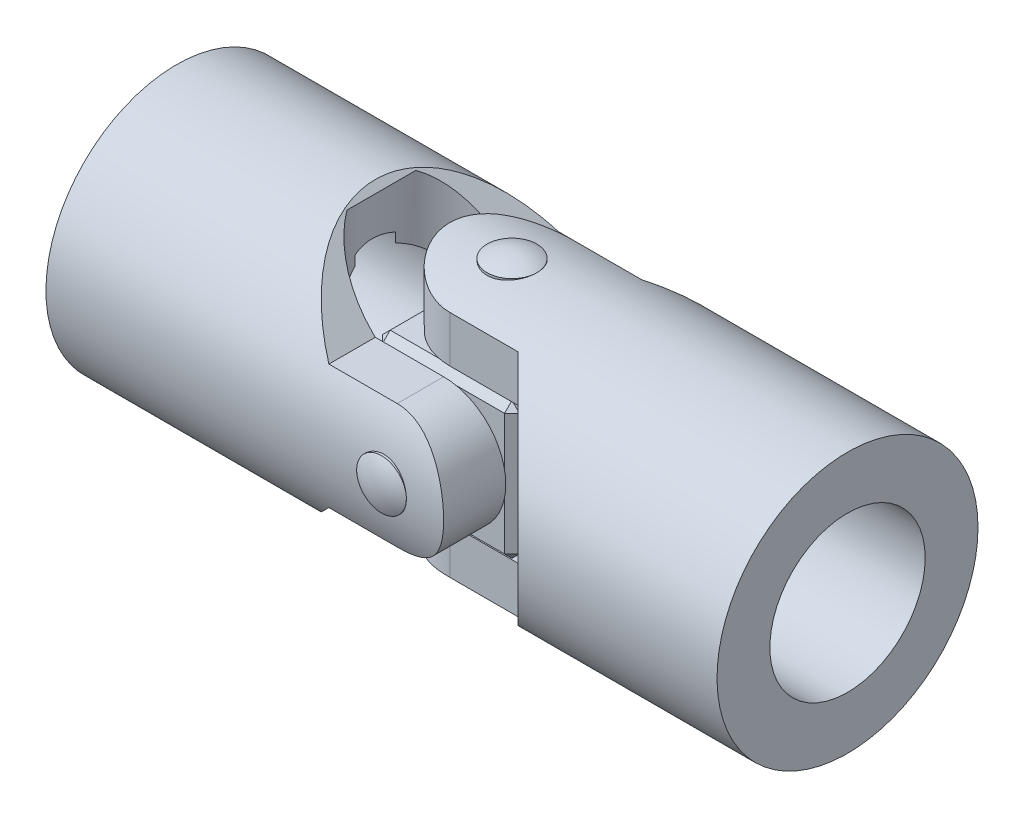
ISO-10303-21;
HEADER;
FILE_DESCRIPTION(('STEP AP214'),'2;1');
FILE_NAME('part.step','',(''),(''),'','','');
FILE_SCHEMA(('AUTOMOTIVE_DESIGN { 1 0 10303 214 1 1 1 1 }'));
ENDSEC;
DATA;
#1=APPLICATION_CONTEXT('core data for automotive mechanical design processes');
#2=APPLICATION_PROTOCOL_DEFINITION('international standard','automotive_design',2000,#1);
#3=PRODUCT_CONTEXT('',#1,'mechanical');
#4=PRODUCT('Part','Part','',(#3));
#5=PRODUCT_RELATED_PRODUCT_CATEGORY('part','',(#4));
#6=PRODUCT_DEFINITION_FORMATION('','',#4);
#7=PRODUCT_DEFINITION_CONTEXT('part definition',#1,'design');
#8=PRODUCT_DEFINITION('design','',#6,#7);
#9=PRODUCT_DEFINITION_SHAPE('','',#8);
#10=(LENGTH_UNIT() NAMED_UNIT(*) SI_UNIT(.MILLI.,.METRE.));
#11=(NAMED_UNIT(*) PLANE_ANGLE_UNIT() SI_UNIT($,.RADIAN.));
#12=(NAMED_UNIT(*) SI_UNIT($,.STERADIAN.) SOLID_ANGLE_UNIT());
#13=UNCERTAINTY_MEASURE_WITH_UNIT(LENGTH_MEASURE(1.E-05),#10,'distance_accuracy_value','');
#14=(GEOMETRIC_REPRESENTATION_CONTEXT(3) GLOBAL_UNCERTAINTY_ASSIGNED_CONTEXT((#13)) GLOBAL_UNIT_ASSIGNED_CONTEXT((#10,
#11,#12)) REPRESENTATION_CONTEXT('',''));
#15=CARTESIAN_POINT('',(0.,0.,0.));
#16=DIRECTION('',(0.,0.,1.));
#17=DIRECTION('',(1.,0.,0.));
#18=AXIS2_PLACEMENT_3D('',#15,#16,#17);
#19=CARTESIAN_POINT('',(0.,21.,0.));
#20=DIRECTION('',(0.,-1.,0.));
#21=DIRECTION('',(-1.,0.,0.));
#22=AXIS2_PLACEMENT_3D('',#19,#20,#21);
#23=CYLINDRICAL_SURFACE('',#22,4.);
#24=CARTESIAN_POINT('',(0.,21.,0.));
#25=DIRECTION('',(0.,1.,0.));
#26=DIRECTION('',(1.,0.,0.));
#27=AXIS2_PLACEMENT_3D('',#24,#25,#26);
#28=CIRCLE('',#27,4.);
#29=CARTESIAN_POINT('',(-4.,21.,0.));
#30=VERTEX_POINT('',#29);
#31=EDGE_CURVE('P0_E10',#30,#30,#28,.T.);
#32=CARTESIAN_POINT('',(0.,-21.,0.));
#33=DIRECTION('',(0.,1.,0.));
#34=DIRECTION('',(0.,0.,1.));
#35=AXIS2_PLACEMENT_3D('',#32,#33,#34);
#36=CIRCLE('',#35,4.);
#37=CARTESIAN_POINT('',(-4.,-21.,0.));
#38=VERTEX_POINT('',#37);
#39=EDGE_CURVE('P0_E20',#38,#38,#36,.T.);
#40=CARTESIAN_POINT('',(-4.,21.,0.));
#41=CARTESIAN_POINT('',(-4.,20.5625,0.));
#42=CARTESIAN_POINT('',(-4.,20.125,0.));
#43=CARTESIAN_POINT('',(-4.,19.25,0.));
#44=CARTESIAN_POINT('',(-4.,18.8125,0.));
#45=CARTESIAN_POINT('',(-4.,17.9375,0.));
#46=CARTESIAN_POINT('',(-4.,17.5,0.));
#47=CARTESIAN_POINT('',(-4.,16.625,0.));
#48=CARTESIAN_POINT('',(-4.,16.1875,0.));
#49=CARTESIAN_POINT('',(-4.,15.3125,0.));
#50=CARTESIAN_POINT('',(-4.,14.875,0.));
#51=CARTESIAN_POINT('',(-4.,14.,0.));
#52=CARTESIAN_POINT('',(-4.,13.5625,0.));
#53=CARTESIAN_POINT('',(-4.,12.6875,0.));
#54=CARTESIAN_POINT('',(-4.,12.25,0.));
#55=CARTESIAN_POINT('',(-4.,11.375,0.));
#56=CARTESIAN_POINT('',(-4.,10.9375,0.));
#57=CARTESIAN_POINT('',(-4.,10.0625,0.));
#58=CARTESIAN_POINT('',(-4.,9.625,0.));
#59=CARTESIAN_POINT('',(-4.,8.75,0.));
#60=CARTESIAN_POINT('',(-4.,8.3125,0.));
#61=CARTESIAN_POINT('',(-4.,7.4375,0.));
#62=CARTESIAN_POINT('',(-4.,7.,0.));
#63=CARTESIAN_POINT('',(-4.,6.125,0.));
#64=CARTESIAN_POINT('',(-4.,5.6875,0.));
#65=CARTESIAN_POINT('',(-4.,4.8125,0.));
#66=CARTESIAN_POINT('',(-4.,4.375,0.));
#67=CARTESIAN_POINT('',(-4.,3.5,0.));
#68=CARTESIAN_POINT('',(-4.,3.0625,0.));
#69=CARTESIAN_POINT('',(-4.,2.1875,0.));
#70=CARTESIAN_POINT('',(-4.,1.75,0.));
#71=CARTESIAN_POINT('',(-4.,0.874999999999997,0.));
#72=CARTESIAN_POINT('',(-4.,0.437499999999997,0.));
#73=CARTESIAN_POINT('',(-4.,-0.437500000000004,0.));
#74=CARTESIAN_POINT('',(-4.,-0.875000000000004,0.));
#75=CARTESIAN_POINT('',(-4.,-1.75000000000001,0.));
#76=CARTESIAN_POINT('',(-4.,-2.18750000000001,0.));
#77=CARTESIAN_POINT('',(-4.,-3.0625,0.));
#78=CARTESIAN_POINT('',(-4.,-3.5,0.));
#79=CARTESIAN_POINT('',(-4.,-4.375,0.));
#80=CARTESIAN_POINT('',(-4.,-4.8125,0.));
#81=CARTESIAN_POINT('',(-4.,-5.68750000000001,0.));
#82=CARTESIAN_POINT('',(-4.,-6.12500000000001,0.));
#83=CARTESIAN_POINT('',(-4.,-7.00000000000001,0.));
#84=CARTESIAN_POINT('',(-4.,-7.4375,0.));
#85=CARTESIAN_POINT('',(-4.,-8.3125,0.));
#86=CARTESIAN_POINT('',(-4.,-8.75,0.));
#87=CARTESIAN_POINT('',(-4.,-9.625,0.));
#88=CARTESIAN_POINT('',(-4.,-10.0625,0.));
#89=CARTESIAN_POINT('',(-4.,-10.9375,0.));
#90=CARTESIAN_POINT('',(-4.,-11.375,0.));
#91=CARTESIAN_POINT('',(-4.,-12.25,0.));
#92=CARTESIAN_POINT('',(-4.,-12.6875,0.));
#93=CARTESIAN_POINT('',(-4.,-13.5625,0.));
#94=CARTESIAN_POINT('',(-4.,-14.,0.));
#95=CARTESIAN_POINT('',(-4.,-14.875,0.));
#96=CARTESIAN_POINT('',(-4.,-15.3125,0.));
#97=CARTESIAN_POINT('',(-4.,-16.1875,0.));
#98=CARTESIAN_POINT('',(-4.,-16.625,0.));
#99=CARTESIAN_POINT('',(-4.,-17.5,0.));
#100=CARTESIAN_POINT('',(-4.,-17.9375,0.));
#101=CARTESIAN_POINT('',(-4.,-18.8125,0.));
#102=CARTESIAN_POINT('',(-4.,-19.25,0.));
#103=CARTESIAN_POINT('',(-4.,-20.125,0.));
#104=CARTESIAN_POINT('',(-4.,-20.5625,0.));
#105=CARTESIAN_POINT('',(-4.,-21.,0.));
#106=B_SPLINE_CURVE_WITH_KNOTS('',3,(#40,#41,#42,#43,#44,#45,#46,#47,#48,#49,#50,#51,#52,#53,
#54,#55,#56,#57,#58,#59,#60,#61,#62,#63,#64,#65,#66,#67,#68,#69,#70,#71,#72,#73,#74,#75,#76,#77,
#78,#79,#80,#81,#82,#83,#84,#85,#86,#87,#88,#89,#90,#91,#92,#93,#94,#95,#96,#97,#98,#99,#100,
#101,#102,#103,#104,#105),.UNSPECIFIED.,.F.,.F.,(4,2,2,2,2,2,2,2,2,2,2,2,2,2,2,2,2,2,2,2,2,2,2,
2,2,2,2,2,2,2,2,2,4),(0.,1.3125,2.625,3.9375,5.25,6.5625,7.875,9.1875,10.5,11.8125,13.125,
14.4375,15.75,17.0625,18.375,19.6875,21.,22.3125,23.625,24.9375,26.25,27.5625,28.875,30.1875,
31.5,32.8125,34.125,35.4375,36.75,38.0625,39.375,40.6875,42.),.UNSPECIFIED.);
#107=EDGE_CURVE('P0_BSEAM14',#30,#38,#106,.T.);
#108=ORIENTED_EDGE('',*,*,#31,.F.);
#109=ORIENTED_EDGE('',*,*,#39,.T.);
#110=ORIENTED_EDGE('',*,*,#107,.T.);
#111=ORIENTED_EDGE('',*,*,#107,.F.);
#112=EDGE_LOOP('',(#108,#110,#109,#111));
#113=FACE_BOUND('',#112,.T.);
#114=ADVANCED_FACE('P0_F14',(#113),#23,.T.);
#115=CARTESIAN_POINT('',(0.,13.5,0.));
#116=DIRECTION('',(0.,1.,0.));
#117=DIRECTION('',(0.,0.,-1.));
#118=AXIS2_PLACEMENT_3D('',#115,#116,#117);
#119=SPHERICAL_SURFACE('',#118,8.49999999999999);
#120=ORIENTED_EDGE('',*,*,#31,.T.);
#121=EDGE_LOOP('',(#120));
#122=FACE_BOUND('',#121,.T.);
#123=ADVANCED_FACE('P0_F29',(#122),#119,.T.);
#124=CARTESIAN_POINT('',(0.,-13.5,0.));
#125=DIRECTION('',(0.,-1.,0.));
#126=DIRECTION('',(0.,0.,-1.));
#127=AXIS2_PLACEMENT_3D('',#124,#125,#126);
#128=SPHERICAL_SURFACE('',#127,8.49999999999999);
#129=ORIENTED_EDGE('',*,*,#39,.F.);
#130=EDGE_LOOP('',(#129));
#131=FACE_BOUND('',#130,.T.);
#132=ADVANCED_FACE('P0_F27',(#131),#128,.T.);
#133=CLOSED_SHELL('',(#114,#123,#132));
#134=MANIFOLD_SOLID_BREP('P0_B1',#133);
#135=CARTESIAN_POINT('',(0.,0.,21.));
#136=DIRECTION('',(0.,0.,-1.));
#137=DIRECTION('',(-1.,0.,0.));
#138=AXIS2_PLACEMENT_3D('',#135,#136,#137);
#139=CYLINDRICAL_SURFACE('',#138,4.);
#140=CARTESIAN_POINT('',(0.,0.,21.));
#141=DIRECTION('',(0.,0.,1.));
#142=DIRECTION('',(1.,0.,0.));
#143=AXIS2_PLACEMENT_3D('',#140,#141,#142);
#144=CIRCLE('',#143,4.);
#145=CARTESIAN_POINT('',(-4.,0.,21.));
#146=VERTEX_POINT('',#145);
#147=EDGE_CURVE('P1_E10',#146,#146,#144,.T.);
#148=CARTESIAN_POINT('',(0.,0.,-21.));
#149=DIRECTION('',(0.,0.,1.));
#150=DIRECTION('',(0.,-1.,0.));
#151=AXIS2_PLACEMENT_3D('',#148,#149,#150);
#152=CIRCLE('',#151,4.);
#153=CARTESIAN_POINT('',(-4.,0.,-21.));
#154=VERTEX_POINT('',#153);
#155=EDGE_CURVE('P1_E20',#154,#154,#152,.T.);
#156=CARTESIAN_POINT('',(-4.,0.,21.));
#157=CARTESIAN_POINT('',(-4.,0.,20.5625));
#158=CARTESIAN_POINT('',(-4.,0.,20.125));
#159=CARTESIAN_POINT('',(-4.,0.,19.25));
#160=CARTESIAN_POINT('',(-4.,0.,18.8125));
#161=CARTESIAN_POINT('',(-4.,0.,17.9375));
#162=CARTESIAN_POINT('',(-4.,0.,17.5));
#163=CARTESIAN_POINT('',(-4.,0.,16.625));
#164=CARTESIAN_POINT('',(-4.,0.,16.1875));
#165=CARTESIAN_POINT('',(-4.,0.,15.3125));
#166=CARTESIAN_POINT('',(-4.,0.,14.875));
#167=CARTESIAN_POINT('',(-4.,0.,14.));
#168=CARTESIAN_POINT('',(-4.,0.,13.5625));
#169=CARTESIAN_POINT('',(-4.,0.,12.6875));
#170=CARTESIAN_POINT('',(-4.,0.,12.25));
#171=CARTESIAN_POINT('',(-4.,0.,11.375));
#172=CARTESIAN_POINT('',(-4.,0.,10.9375));
#173=CARTESIAN_POINT('',(-4.,0.,10.0625));
#174=CARTESIAN_POINT('',(-4.,0.,9.625));
#175=CARTESIAN_POINT('',(-4.,0.,8.75));
#176=CARTESIAN_POINT('',(-4.,0.,8.3125));
#177=CARTESIAN_POINT('',(-4.,0.,7.4375));
#178=CARTESIAN_POINT('',(-4.,0.,7.));
#179=CARTESIAN_POINT('',(-4.,0.,6.125));
#180=CARTESIAN_POINT('',(-4.,0.,5.6875));
#181=CARTESIAN_POINT('',(-4.,0.,4.8125));
#182=CARTESIAN_POINT('',(-4.,0.,4.375));
#183=CARTESIAN_POINT('',(-4.,0.,3.5));
#184=CARTESIAN_POINT('',(-4.,0.,3.0625));
#185=CARTESIAN_POINT('',(-4.,0.,2.1875));
#186=CARTESIAN_POINT('',(-4.,0.,1.75));
#187=CARTESIAN_POINT('',(-4.,0.,0.874999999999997));
#188=CARTESIAN_POINT('',(-4.,0.,0.437499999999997));
#189=CARTESIAN_POINT('',(-4.,0.,-0.437500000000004));
#190=CARTESIAN_POINT('',(-4.,0.,-0.875000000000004));
#191=CARTESIAN_POINT('',(-4.,0.,-1.75000000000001));
#192=CARTESIAN_POINT('',(-4.,0.,-2.18750000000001));
#193=CARTESIAN_POINT('',(-4.,0.,-3.0625));
#194=CARTESIAN_POINT('',(-4.,0.,-3.5));
#195=CARTESIAN_POINT('',(-4.,0.,-4.375));
#196=CARTESIAN_POINT('',(-4.,0.,-4.8125));
#197=CARTESIAN_POINT('',(-4.,0.,-5.68750000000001));
#198=CARTESIAN_POINT('',(-4.,0.,-6.12500000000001));
#199=CARTESIAN_POINT('',(-4.,0.,-7.00000000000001));
#200=CARTESIAN_POINT('',(-4.,0.,-7.4375));
#201=CARTESIAN_POINT('',(-4.,0.,-8.3125));
#202=CARTESIAN_POINT('',(-4.,0.,-8.75));
#203=CARTESIAN_POINT('',(-4.,0.,-9.625));
#204=CARTESIAN_POINT('',(-4.,0.,-10.0625));
#205=CARTESIAN_POINT('',(-4.,0.,-10.9375));
#206=CARTESIAN_POINT('',(-4.,0.,-11.375));
#207=CARTESIAN_POINT('',(-4.,0.,-12.25));
#208=CARTESIAN_POINT('',(-4.,0.,-12.6875));
#209=CARTESIAN_POINT('',(-4.,0.,-13.5625));
#210=CARTESIAN_POINT('',(-4.,0.,-14.));
#211=CARTESIAN_POINT('',(-4.,0.,-14.875));
#212=CARTESIAN_POINT('',(-4.,0.,-15.3125));
#213=CARTESIAN_POINT('',(-4.,0.,-16.1875));
#214=CARTESIAN_POINT('',(-4.,0.,-16.625));
#215=CARTESIAN_POINT('',(-4.,0.,-17.5));
#216=CARTESIAN_POINT('',(-4.,0.,-17.9375));
#217=CARTESIAN_POINT('',(-4.,0.,-18.8125));
#218=CARTESIAN_POINT('',(-4.,0.,-19.25));
#219=CARTESIAN_POINT('',(-4.,0.,-20.125));
#220=CARTESIAN_POINT('',(-4.,0.,-20.5625));
#221=CARTESIAN_POINT('',(-4.,0.,-21.));
#222=B_SPLINE_CURVE_WITH_KNOTS('',3,(#156,#157,#158,#159,#160,#161,#162,#163,#164,#165,#166,
#167,#168,#169,#170,#171,#172,#173,#174,#175,#176,#177,#178,#179,#180,#181,#182,#183,#184,#185,
#186,#187,#188,#189,#190,#191,#192,#193,#194,#195,#196,#197,#198,#199,#200,#201,#202,#203,#204,
#205,#206,#207,#208,#209,#210,#211,#212,#213,#214,#215,#216,#217,#218,#219,#220,#221),
.UNSPECIFIED.,.F.,.F.,(4,2,2,2,2,2,2,2,2,2,2,2,2,2,2,2,2,2,2,2,2,2,2,2,2,2,2,2,2,2,2,2,4),(0.,
1.3125,2.625,3.9375,5.25,6.5625,7.875,9.1875,10.5,11.8125,13.125,14.4375,15.75,17.0625,18.375,
19.6875,21.,22.3125,23.625,24.9375,26.25,27.5625,28.875,30.1875,31.5,32.8125,34.125,35.4375,
36.75,38.0625,39.375,40.6875,42.),.UNSPECIFIED.);
#223=EDGE_CURVE('P1_BSEAM14',#146,#154,#222,.T.);
#224=ORIENTED_EDGE('',*,*,#147,.F.);
#225=ORIENTED_EDGE('',*,*,#155,.T.);
#226=ORIENTED_EDGE('',*,*,#223,.T.);
#227=ORIENTED_EDGE('',*,*,#223,.F.);
#228=EDGE_LOOP('',(#224,#226,#225,#227));
#229=FACE_BOUND('',#228,.T.);
#230=ADVANCED_FACE('P1_F14',(#229),#139,.T.);
#231=CARTESIAN_POINT('',(0.,0.,13.5));
#232=DIRECTION('',(0.,0.,1.));
#233=DIRECTION('',(0.,1.,0.));
#234=AXIS2_PLACEMENT_3D('',#231,#232,#233);
#235=SPHERICAL_SURFACE('',#234,8.49999999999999);
#236=ORIENTED_EDGE('',*,*,#147,.T.);
#237=EDGE_LOOP('',(#236));
#238=FACE_BOUND('',#237,.T.);
#239=ADVANCED_FACE('P1_F29',(#238),#235,.T.);
#240=CARTESIAN_POINT('',(0.,0.,-13.5));
#241=DIRECTION('',(0.,0.,-1.));
#242=DIRECTION('',(0.,1.,0.));
#243=AXIS2_PLACEMENT_3D('',#240,#241,#242);
#244=SPHERICAL_SURFACE('',#243,8.49999999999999);
#245=ORIENTED_EDGE('',*,*,#155,.F.);
#246=EDGE_LOOP('',(#245));
#247=FACE_BOUND('',#246,.T.);
#248=ADVANCED_FACE('P1_F27',(#247),#244,.T.);
#249=CLOSED_SHELL('',(#230,#239,#248));
#250=MANIFOLD_SOLID_BREP('P1_B1',#249);
#251=CARTESIAN_POINT('',(0.,0.,11.));
#252=DIRECTION('',(0.,0.,-1.));
#253=DIRECTION('',(-1.,0.,0.));
#254=AXIS2_PLACEMENT_3D('',#251,#252,#253);
#255=CYLINDRICAL_SURFACE('',#254,4.);
#256=CARTESIAN_POINT('',(0.,0.,0.));
#257=DIRECTION('',(0.,0.707106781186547,-0.707106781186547));
#258=DIRECTION('',(0.,-0.707106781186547,-0.707106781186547));
#259=AXIS2_PLACEMENT_3D('',#256,#257,#258);
#260=ELLIPSE('',#259,5.65685424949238,4.);
#261=CARTESIAN_POINT('',(4.,0.,0.));
#262=VERTEX_POINT('',#261);
#263=CARTESIAN_POINT('',(-4.,0.,0.));
#264=VERTEX_POINT('',#263);
#265=EDGE_CURVE('P2_E116',#262,#264,#260,.F.);
#266=ORIENTED_EDGE('',*,*,#265,.F.);
#267=CARTESIAN_POINT('',(0.,0.,0.));
#268=DIRECTION('',(0.,-0.707106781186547,-0.707106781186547));
#269=DIRECTION('',(0.,0.707106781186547,-0.707106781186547));
#270=AXIS2_PLACEMENT_3D('',#267,#268,#269);
#271=ELLIPSE('',#270,5.65685424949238,4.);
#272=EDGE_CURVE('P2_E120',#264,#262,#271,.F.);
#273=ORIENTED_EDGE('',*,*,#272,.F.);
#274=EDGE_LOOP('',(#266,#273));
#275=FACE_BOUND('',#274,.T.);
#276=CARTESIAN_POINT('',(0.,0.,11.));
#277=DIRECTION('',(0.,0.,1.));
#278=DIRECTION('',(1.,0.,0.));
#279=AXIS2_PLACEMENT_3D('',#276,#277,#278);
#280=CIRCLE('',#279,4.);
#281=CARTESIAN_POINT('',(4.,0.,11.));
#282=VERTEX_POINT('',#281);
#283=EDGE_CURVE('P2_E127',#282,#282,#280,.T.);
#284=ORIENTED_EDGE('',*,*,#283,.T.);
#285=EDGE_LOOP('',(#284));
#286=FACE_BOUND('',#285,.T.);
#287=ADVANCED_FACE('P2_F16',(#275,#286),#255,.F.);
#288=CARTESIAN_POINT('',(11.,11.,11.));
#289=DIRECTION('',(0.,0.,1.));
#290=DIRECTION('',(1.,0.,0.));
#291=AXIS2_PLACEMENT_3D('',#288,#289,#290);
#292=PLANE('',#291);
#293=DIRECTION('',(0.,-1.,0.));
#294=VECTOR('',#293,1.);
#295=CARTESIAN_POINT('',(-9.8,-11.,11.));
#296=LINE('',#295,#294);
#297=CARTESIAN_POINT('',(-9.8,9.8,11.));
#298=VERTEX_POINT('',#297);
#299=CARTESIAN_POINT('',(-9.8,-9.8,11.));
#300=VERTEX_POINT('',#299);
#301=EDGE_CURVE('P2_E164',#298,#300,#296,.T.);
#302=ORIENTED_EDGE('',*,*,#301,.T.);
#303=DIRECTION('',(1.,0.,0.));
#304=VECTOR('',#303,1.);
#305=CARTESIAN_POINT('',(11.,-9.8,11.));
#306=LINE('',#305,#304);
#307=CARTESIAN_POINT('',(9.8,-9.8,11.));
#308=VERTEX_POINT('',#307);
#309=EDGE_CURVE('P2_E168',#300,#308,#306,.T.);
#310=ORIENTED_EDGE('',*,*,#309,.T.);
#311=DIRECTION('',(0.,1.,0.));
#312=VECTOR('',#311,1.);
#313=CARTESIAN_POINT('',(9.8,11.,11.));
#314=LINE('',#313,#312);
#315=CARTESIAN_POINT('',(9.8,9.8,11.));
#316=VERTEX_POINT('',#315);
#317=EDGE_CURVE('P2_E166',#308,#316,#314,.T.);
#318=ORIENTED_EDGE('',*,*,#317,.T.);
#319=DIRECTION('',(-1.,0.,0.));
#320=VECTOR('',#319,1.);
#321=CARTESIAN_POINT('',(-11.,9.8,11.));
#322=LINE('',#321,#320);
#323=EDGE_CURVE('P2_E162',#316,#298,#322,.T.);
#324=ORIENTED_EDGE('',*,*,#323,.T.);
#325=EDGE_LOOP('',(#302,#310,#318,#324));
#326=FACE_BOUND('',#325,.T.);
#327=ORIENTED_EDGE('',*,*,#283,.F.);
#328=EDGE_LOOP('',(#327));
#329=FACE_BOUND('',#328,.T.);
#330=ADVANCED_FACE('P2_F282',(#326,#329),#292,.T.);
#331=CARTESIAN_POINT('',(11.,11.,-11.));
#332=DIRECTION('',(0.,0.,1.));
#333=DIRECTION('',(1.,0.,0.));
#334=AXIS2_PLACEMENT_3D('',#331,#332,#333);
#335=PLANE('',#334);
#336=DIRECTION('',(-1.,0.,0.));
#337=VECTOR('',#336,1.);
#338=CARTESIAN_POINT('',(11.,-9.8,-11.));
#339=LINE('',#338,#337);
#340=CARTESIAN_POINT('',(9.8,-9.8,-11.));
#341=VERTEX_POINT('',#340);
#342=CARTESIAN_POINT('',(-9.8,-9.8,-11.));
#343=VERTEX_POINT('',#342);
#344=EDGE_CURVE('P2_E157',#341,#343,#339,.T.);
#345=ORIENTED_EDGE('',*,*,#344,.T.);
#346=DIRECTION('',(0.,1.,0.));
#347=VECTOR('',#346,1.);
#348=CARTESIAN_POINT('',(-9.8,11.,-11.));
#349=LINE('',#348,#347);
#350=CARTESIAN_POINT('',(-9.8,9.8,-11.));
#351=VERTEX_POINT('',#350);
#352=EDGE_CURVE('P2_E159',#343,#351,#349,.T.);
#353=ORIENTED_EDGE('',*,*,#352,.T.);
#354=DIRECTION('',(1.,0.,0.));
#355=VECTOR('',#354,1.);
#356=CARTESIAN_POINT('',(11.,9.8,-11.));
#357=LINE('',#356,#355);
#358=CARTESIAN_POINT('',(9.8,9.8,-11.));
#359=VERTEX_POINT('',#358);
#360=EDGE_CURVE('P2_E153',#351,#359,#357,.T.);
#361=ORIENTED_EDGE('',*,*,#360,.T.);
#362=DIRECTION('',(0.,-1.,0.));
#363=VECTOR('',#362,1.);
#364=CARTESIAN_POINT('',(9.8,11.,-11.));
#365=LINE('',#364,#363);
#366=EDGE_CURVE('P2_E155',#359,#341,#365,.T.);
#367=ORIENTED_EDGE('',*,*,#366,.T.);
#368=EDGE_LOOP('',(#345,#353,#361,#367));
#369=FACE_BOUND('',#368,.T.);
#370=CARTESIAN_POINT('',(0.,0.,-11.));
#371=DIRECTION('',(0.,0.,1.));
#372=DIRECTION('',(1.,0.,0.));
#373=AXIS2_PLACEMENT_3D('',#370,#371,#372);
#374=CIRCLE('',#373,4.);
#375=CARTESIAN_POINT('',(4.,0.,-11.));
#376=VERTEX_POINT('',#375);
#377=EDGE_CURVE('P2_E259',#376,#376,#374,.T.);
#378=ORIENTED_EDGE('',*,*,#377,.T.);
#379=EDGE_LOOP('',(#378));
#380=FACE_BOUND('',#379,.T.);
#381=ADVANCED_FACE('P2_F267',(#369,#380),#335,.F.);
#382=CARTESIAN_POINT('',(-11.,11.,11.));
#383=DIRECTION('',(0.,-1.,0.));
#384=DIRECTION('',(0.,0.,-1.));
#385=AXIS2_PLACEMENT_3D('',#382,#383,#384);
#386=PLANE('',#385);
#387=DIRECTION('',(-1.,0.,0.));
#388=VECTOR('',#387,1.);
#389=CARTESIAN_POINT('',(-11.,11.,-9.8));
#390=LINE('',#389,#388);
#391=CARTESIAN_POINT('',(9.8,11.,-9.8));
#392=VERTEX_POINT('',#391);
#393=CARTESIAN_POINT('',(-9.8,11.,-9.8));
#394=VERTEX_POINT('',#393);
#395=EDGE_CURVE('P2_E25',#392,#394,#390,.T.);
#396=ORIENTED_EDGE('',*,*,#395,.T.);
#397=DIRECTION('',(0.,0.,1.));
#398=VECTOR('',#397,1.);
#399=CARTESIAN_POINT('',(-9.8,11.,11.));
#400=LINE('',#399,#398);
#401=CARTESIAN_POINT('',(-9.8,11.,9.8));
#402=VERTEX_POINT('',#401);
#403=EDGE_CURVE('P2_E11',#394,#402,#400,.T.);
#404=ORIENTED_EDGE('',*,*,#403,.T.);
#405=DIRECTION('',(1.,0.,0.));
#406=VECTOR('',#405,1.);
#407=CARTESIAN_POINT('',(11.,11.,9.8));
#408=LINE('',#407,#406);
#409=CARTESIAN_POINT('',(9.8,11.,9.8));
#410=VERTEX_POINT('',#409);
#411=EDGE_CURVE('P2_E180',#402,#410,#408,.T.);
#412=ORIENTED_EDGE('',*,*,#411,.T.);
#413=DIRECTION('',(0.,0.,-1.));
#414=VECTOR('',#413,1.);
#415=CARTESIAN_POINT('',(9.8,11.,11.));
#416=LINE('',#415,#414);
#417=EDGE_CURVE('P2_E36',#410,#392,#416,.T.);
#418=ORIENTED_EDGE('',*,*,#417,.T.);
#419=EDGE_LOOP('',(#396,#404,#412,#418));
#420=FACE_BOUND('',#419,.T.);
#421=CARTESIAN_POINT('',(0.,11.,0.));
#422=DIRECTION('',(0.,1.,0.));
#423=DIRECTION('',(0.,0.,1.));
#424=AXIS2_PLACEMENT_3D('',#421,#422,#423);
#425=CIRCLE('',#424,4.);
#426=CARTESIAN_POINT('',(0.,11.,4.));
#427=VERTEX_POINT('',#426);
#428=EDGE_CURVE('P2_E249',#427,#427,#425,.T.);
#429=ORIENTED_EDGE('',*,*,#428,.F.);
#430=EDGE_LOOP('',(#429));
#431=FACE_BOUND('',#430,.T.);
#432=ADVANCED_FACE('P2_F290',(#420,#431),#386,.F.);
#433=CARTESIAN_POINT('',(-11.,-11.,11.));
#434=DIRECTION('',(1.,0.,0.));
#435=DIRECTION('',(0.,0.,-1.));
#436=AXIS2_PLACEMENT_3D('',#433,#434,#435);
#437=PLANE('',#436);
#438=DIRECTION('',(0.,-1.,0.));
#439=VECTOR('',#438,1.);
#440=CARTESIAN_POINT('',(-11.,-11.,-9.8));
#441=LINE('',#440,#439);
#442=CARTESIAN_POINT('',(-11.,9.8,-9.8));
#443=VERTEX_POINT('',#442);
#444=CARTESIAN_POINT('',(-11.,-9.8,-9.8));
#445=VERTEX_POINT('',#444);
#446=EDGE_CURVE('P2_E148',#443,#445,#441,.T.);
#447=ORIENTED_EDGE('',*,*,#446,.T.);
#448=DIRECTION('',(0.,0.,1.));
#449=VECTOR('',#448,1.);
#450=CARTESIAN_POINT('',(-11.,-9.8,11.));
#451=LINE('',#450,#449);
#452=CARTESIAN_POINT('',(-11.,-9.8,9.8));
#453=VERTEX_POINT('',#452);
#454=EDGE_CURVE('P2_E150',#445,#453,#451,.T.);
#455=ORIENTED_EDGE('',*,*,#454,.T.);
#456=DIRECTION('',(0.,1.,0.));
#457=VECTOR('',#456,1.);
#458=CARTESIAN_POINT('',(-11.,11.,9.8));
#459=LINE('',#458,#457);
#460=CARTESIAN_POINT('',(-11.,9.8,9.8));
#461=VERTEX_POINT('',#460);
#462=EDGE_CURVE('P2_E146',#453,#461,#459,.T.);
#463=ORIENTED_EDGE('',*,*,#462,.T.);
#464=DIRECTION('',(0.,0.,-1.));
#465=VECTOR('',#464,1.);
#466=CARTESIAN_POINT('',(-11.,9.8,11.));
#467=LINE('',#466,#465);
#468=EDGE_CURVE('P2_E144',#461,#443,#467,.T.);
#469=ORIENTED_EDGE('',*,*,#468,.T.);
#470=EDGE_LOOP('',(#447,#455,#463,#469));
#471=FACE_BOUND('',#470,.T.);
#472=ADVANCED_FACE('P2_F297',(#471),#437,.F.);
#473=CARTESIAN_POINT('',(-11.,-11.,11.));
#474=DIRECTION('',(0.,1.,0.));
#475=DIRECTION('',(0.,0.,1.));
#476=AXIS2_PLACEMENT_3D('',#473,#474,#475);
#477=PLANE('',#476);
#478=DIRECTION('',(-1.,0.,0.));
#479=VECTOR('',#478,1.);
#480=CARTESIAN_POINT('',(-11.,-11.,9.8));
#481=LINE('',#480,#479);
#482=CARTESIAN_POINT('',(9.8,-11.,9.8));
#483=VERTEX_POINT('',#482);
#484=CARTESIAN_POINT('',(-9.8,-11.,9.8));
#485=VERTEX_POINT('',#484);
#486=EDGE_CURVE('P2_E137',#483,#485,#481,.T.);
#487=ORIENTED_EDGE('',*,*,#486,.T.);
#488=DIRECTION('',(0.,0.,-1.));
#489=VECTOR('',#488,1.);
#490=CARTESIAN_POINT('',(-9.8,-11.,11.));
#491=LINE('',#490,#489);
#492=CARTESIAN_POINT('',(-9.8,-11.,-9.8));
#493=VERTEX_POINT('',#492);
#494=EDGE_CURVE('P2_E141',#485,#493,#491,.T.);
#495=ORIENTED_EDGE('',*,*,#494,.T.);
#496=DIRECTION('',(1.,0.,0.));
#497=VECTOR('',#496,1.);
#498=CARTESIAN_POINT('',(-11.,-11.,-9.8));
#499=LINE('',#498,#497);
#500=CARTESIAN_POINT('',(9.8,-11.,-9.8));
#501=VERTEX_POINT('',#500);
#502=EDGE_CURVE('P2_E139',#493,#501,#499,.T.);
#503=ORIENTED_EDGE('',*,*,#502,.T.);
#504=DIRECTION('',(0.,0.,1.));
#505=VECTOR('',#504,1.);
#506=CARTESIAN_POINT('',(9.8,-11.,11.));
#507=LINE('',#506,#505);
#508=EDGE_CURVE('P2_E130',#501,#483,#507,.T.);
#509=ORIENTED_EDGE('',*,*,#508,.T.);
#510=EDGE_LOOP('',(#487,#495,#503,#509));
#511=FACE_BOUND('',#510,.T.);
#512=CARTESIAN_POINT('',(0.,-11.,0.));
#513=DIRECTION('',(0.,1.,0.));
#514=DIRECTION('',(0.,0.,1.));
#515=AXIS2_PLACEMENT_3D('',#512,#513,#514);
#516=CIRCLE('',#515,4.);
#517=CARTESIAN_POINT('',(0.,-11.,4.));
#518=VERTEX_POINT('',#517);
#519=EDGE_CURVE('P2_E255',#518,#518,#516,.T.);
#520=ORIENTED_EDGE('',*,*,#519,.T.);
#521=EDGE_LOOP('',(#520));
#522=FACE_BOUND('',#521,.T.);
#523=ADVANCED_FACE('P2_F277',(#511,#522),#477,.F.);
#524=CARTESIAN_POINT('',(11.,-11.,11.));
#525=DIRECTION('',(-1.,0.,0.));
#526=DIRECTION('',(0.,0.,1.));
#527=AXIS2_PLACEMENT_3D('',#524,#525,#526);
#528=PLANE('',#527);
#529=DIRECTION('',(0.,-1.,0.));
#530=VECTOR('',#529,1.);
#531=CARTESIAN_POINT('',(11.,-11.,9.8));
#532=LINE('',#531,#530);
#533=CARTESIAN_POINT('',(11.,9.8,9.8));
#534=VERTEX_POINT('',#533);
#535=CARTESIAN_POINT('',(11.,-9.8,9.8));
#536=VERTEX_POINT('',#535);
#537=EDGE_CURVE('P2_E173',#534,#536,#532,.T.);
#538=ORIENTED_EDGE('',*,*,#537,.T.);
#539=DIRECTION('',(0.,0.,-1.));
#540=VECTOR('',#539,1.);
#541=CARTESIAN_POINT('',(11.,-9.8,11.));
#542=LINE('',#541,#540);
#543=CARTESIAN_POINT('',(11.,-9.8,-9.8));
#544=VERTEX_POINT('',#543);
#545=EDGE_CURVE('P2_E177',#536,#544,#542,.T.);
#546=ORIENTED_EDGE('',*,*,#545,.T.);
#547=DIRECTION('',(0.,1.,0.));
#548=VECTOR('',#547,1.);
#549=CARTESIAN_POINT('',(11.,-11.,-9.8));
#550=LINE('',#549,#548);
#551=CARTESIAN_POINT('',(11.,9.8,-9.8));
#552=VERTEX_POINT('',#551);
#553=EDGE_CURVE('P2_E175',#544,#552,#550,.T.);
#554=ORIENTED_EDGE('',*,*,#553,.T.);
#555=DIRECTION('',(0.,0.,1.));
#556=VECTOR('',#555,1.);
#557=CARTESIAN_POINT('',(11.,9.8,11.));
#558=LINE('',#557,#556);
#559=EDGE_CURVE('P2_E171',#552,#534,#558,.T.);
#560=ORIENTED_EDGE('',*,*,#559,.T.);
#561=EDGE_LOOP('',(#538,#546,#554,#560));
#562=FACE_BOUND('',#561,.T.);
#563=ADVANCED_FACE('P2_F269',(#562),#528,.F.);
#564=CARTESIAN_POINT('',(0.,0.,0.));
#565=DIRECTION('',(0.,0.707106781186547,-0.707106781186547));
#566=DIRECTION('',(0.,-0.707106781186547,-0.707106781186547));
#567=AXIS2_PLACEMENT_3D('',#564,#565,#566);
#568=ELLIPSE('',#567,5.65685424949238,4.);
#569=EDGE_CURVE('P2_E119',#262,#264,#568,.T.);
#570=ORIENTED_EDGE('',*,*,#569,.F.);
#571=CARTESIAN_POINT('',(0.,0.,0.));
#572=DIRECTION('',(0.,-0.707106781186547,-0.707106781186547));
#573=DIRECTION('',(0.,0.707106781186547,-0.707106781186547));
#574=AXIS2_PLACEMENT_3D('',#571,#572,#573);
#575=ELLIPSE('',#574,5.65685424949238,4.);
#576=EDGE_CURVE('P2_E111',#264,#262,#575,.T.);
#577=ORIENTED_EDGE('',*,*,#576,.F.);
#578=EDGE_LOOP('',(#570,#577));
#579=FACE_BOUND('',#578,.T.);
#580=ORIENTED_EDGE('',*,*,#377,.F.);
#581=EDGE_LOOP('',(#580));
#582=FACE_BOUND('',#581,.T.);
#583=ADVANCED_FACE('P2_F132',(#579,#582),#255,.F.);
#584=CARTESIAN_POINT('',(0.,-11.,0.));
#585=DIRECTION('',(0.,1.,0.));
#586=DIRECTION('',(0.,0.,1.));
#587=AXIS2_PLACEMENT_3D('',#584,#585,#586);
#588=CYLINDRICAL_SURFACE('',#587,4.);
#589=ORIENTED_EDGE('',*,*,#569,.T.);
#590=ORIENTED_EDGE('',*,*,#272,.T.);
#591=EDGE_LOOP('',(#589,#590));
#592=FACE_BOUND('',#591,.T.);
#593=ORIENTED_EDGE('',*,*,#519,.F.);
#594=EDGE_LOOP('',(#593));
#595=FACE_BOUND('',#594,.T.);
#596=ADVANCED_FACE('P2_F124',(#592,#595),#588,.F.);
#597=ORIENTED_EDGE('',*,*,#265,.T.);
#598=ORIENTED_EDGE('',*,*,#576,.T.);
#599=EDGE_LOOP('',(#597,#598));
#600=FACE_BOUND('',#599,.T.);
#601=ORIENTED_EDGE('',*,*,#428,.T.);
#602=EDGE_LOOP('',(#601));
#603=FACE_BOUND('',#602,.T.);
#604=ADVANCED_FACE('P2_F113',(#600,#603),#588,.F.);
#605=CARTESIAN_POINT('',(9.8,11.,11.));
#606=DIRECTION('',(-0.707106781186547,-0.707106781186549,0.));
#607=DIRECTION('',(0.707106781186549,-0.707106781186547,0.));
#608=AXIS2_PLACEMENT_3D('',#605,#606,#607);
#609=PLANE('',#608);
#610=DIRECTION('',(0.707106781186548,-0.707106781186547,0.));
#611=VECTOR('',#610,1.);
#612=CARTESIAN_POINT('',(10.4,10.4,9.8));
#613=LINE('',#612,#611);
#614=EDGE_CURVE('P2_E20',#534,#410,#613,.F.);
#615=ORIENTED_EDGE('',*,*,#614,.F.);
#616=ORIENTED_EDGE('',*,*,#559,.F.);
#617=DIRECTION('',(-0.707106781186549,0.707106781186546,0.));
#618=VECTOR('',#617,1.);
#619=CARTESIAN_POINT('',(11.,9.8,-9.8));
#620=LINE('',#619,#618);
#621=EDGE_CURVE('P2_E243',#392,#552,#620,.F.);
#622=ORIENTED_EDGE('',*,*,#621,.F.);
#623=ORIENTED_EDGE('',*,*,#417,.F.);
#624=EDGE_LOOP('',(#615,#616,#622,#623));
#625=FACE_BOUND('',#624,.T.);
#626=ADVANCED_FACE('P2_F18',(#625),#609,.F.);
#627=CARTESIAN_POINT('',(9.8,9.8,11.));
#628=DIRECTION('',(0.577350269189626,0.577350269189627,0.577350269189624));
#629=DIRECTION('',(-0.707106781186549,0.707106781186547,0.));
#630=AXIS2_PLACEMENT_3D('',#627,#628,#629);
#631=PLANE('',#630);
#632=DIRECTION('',(0.707106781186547,0.,-0.707106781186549));
#633=VECTOR('',#632,1.);
#634=CARTESIAN_POINT('',(9.8,9.8,11.));
#635=LINE('',#634,#633);
#636=EDGE_CURVE('P2_E238',#534,#316,#635,.F.);
#637=ORIENTED_EDGE('',*,*,#636,.F.);
#638=ORIENTED_EDGE('',*,*,#614,.T.);
#639=DIRECTION('',(0.,-0.707106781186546,0.707106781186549));
#640=VECTOR('',#639,1.);
#641=CARTESIAN_POINT('',(9.8,9.8,11.));
#642=LINE('',#641,#640);
#643=EDGE_CURVE('P2_E241',#316,#410,#642,.F.);
#644=ORIENTED_EDGE('',*,*,#643,.F.);
#645=EDGE_LOOP('',(#637,#638,#644));
#646=FACE_BOUND('',#645,.T.);
#647=ADVANCED_FACE('P2_F374',(#646),#631,.T.);
#648=CARTESIAN_POINT('',(11.,9.8,-9.8));
#649=DIRECTION('',(0.577350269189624,0.577350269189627,-0.577350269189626));
#650=DIRECTION('',(0.,0.707106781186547,0.707106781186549));
#651=AXIS2_PLACEMENT_3D('',#648,#649,#650);
#652=PLANE('',#651);
#653=DIRECTION('',(0.,-0.707106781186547,-0.707106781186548));
#654=VECTOR('',#653,1.);
#655=CARTESIAN_POINT('',(9.8,10.4,-10.4));
#656=LINE('',#655,#654);
#657=EDGE_CURVE('P2_E232',#392,#359,#656,.T.);
#658=ORIENTED_EDGE('',*,*,#657,.F.);
#659=ORIENTED_EDGE('',*,*,#621,.T.);
#660=DIRECTION('',(0.707106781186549,0.,0.707106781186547));
#661=VECTOR('',#660,1.);
#662=CARTESIAN_POINT('',(11.,9.8,-9.8));
#663=LINE('',#662,#661);
#664=EDGE_CURVE('P2_E235',#359,#552,#663,.T.);
#665=ORIENTED_EDGE('',*,*,#664,.F.);
#666=EDGE_LOOP('',(#658,#659,#665));
#667=FACE_BOUND('',#666,.T.);
#668=ADVANCED_FACE('P2_F371',(#667),#652,.T.);
#669=CARTESIAN_POINT('',(11.,9.8,11.));
#670=DIRECTION('',(0.,0.707106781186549,0.707106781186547));
#671=DIRECTION('',(0.,-0.707106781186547,0.707106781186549));
#672=AXIS2_PLACEMENT_3D('',#669,#670,#671);
#673=PLANE('',#672);
#674=ORIENTED_EDGE('',*,*,#643,.T.);
#675=ORIENTED_EDGE('',*,*,#411,.F.);
#676=DIRECTION('',(0.,0.707106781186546,-0.707106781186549));
#677=VECTOR('',#676,1.);
#678=CARTESIAN_POINT('',(-9.8,10.4,10.4));
#679=LINE('',#678,#677);
#680=EDGE_CURVE('P2_E227',#298,#402,#679,.T.);
#681=ORIENTED_EDGE('',*,*,#680,.F.);
#682=ORIENTED_EDGE('',*,*,#323,.F.);
#683=EDGE_LOOP('',(#674,#675,#681,#682));
#684=FACE_BOUND('',#683,.T.);
#685=ADVANCED_FACE('P2_F367',(#684),#673,.T.);
#686=CARTESIAN_POINT('',(9.8,11.,11.));
#687=DIRECTION('',(0.707106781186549,0.,0.707106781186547));
#688=DIRECTION('',(0.707106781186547,0.,-0.707106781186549));
#689=AXIS2_PLACEMENT_3D('',#686,#687,#688);
#690=PLANE('',#689);
#691=ORIENTED_EDGE('',*,*,#636,.T.);
#692=ORIENTED_EDGE('',*,*,#317,.F.);
#693=DIRECTION('',(-0.707106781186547,0.,0.707106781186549));
#694=VECTOR('',#693,1.);
#695=CARTESIAN_POINT('',(9.8,-9.8,11.));
#696=LINE('',#695,#694);
#697=EDGE_CURVE('P2_E224',#536,#308,#696,.T.);
#698=ORIENTED_EDGE('',*,*,#697,.F.);
#699=ORIENTED_EDGE('',*,*,#537,.F.);
#700=EDGE_LOOP('',(#691,#692,#698,#699));
#701=FACE_BOUND('',#700,.T.);
#702=ADVANCED_FACE('P2_F363',(#701),#690,.T.);
#703=CARTESIAN_POINT('',(11.,-9.8,11.));
#704=DIRECTION('',(-0.707106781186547,0.707106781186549,0.));
#705=DIRECTION('',(-0.707106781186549,-0.707106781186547,0.));
#706=AXIS2_PLACEMENT_3D('',#703,#704,#705);
#707=PLANE('',#706);
#708=DIRECTION('',(0.707106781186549,0.707106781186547,0.));
#709=VECTOR('',#708,1.);
#710=CARTESIAN_POINT('',(9.8,-11.,-9.8));
#711=LINE('',#710,#709);
#712=EDGE_CURVE('P2_E218',#544,#501,#711,.F.);
#713=ORIENTED_EDGE('',*,*,#712,.F.);
#714=ORIENTED_EDGE('',*,*,#545,.F.);
#715=DIRECTION('',(-0.707106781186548,-0.707106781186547,0.));
#716=VECTOR('',#715,1.);
#717=CARTESIAN_POINT('',(10.4,-10.4,9.8));
#718=LINE('',#717,#716);
#719=EDGE_CURVE('P2_E221',#483,#536,#718,.F.);
#720=ORIENTED_EDGE('',*,*,#719,.F.);
#721=ORIENTED_EDGE('',*,*,#508,.F.);
#722=EDGE_LOOP('',(#713,#714,#720,#721));
#723=FACE_BOUND('',#722,.T.);
#724=ADVANCED_FACE('P2_F359',(#723),#707,.F.);
#725=CARTESIAN_POINT('',(11.,-11.,-9.8));
#726=DIRECTION('',(-0.707106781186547,0.,0.707106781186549));
#727=DIRECTION('',(0.707106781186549,0.,0.707106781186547));
#728=AXIS2_PLACEMENT_3D('',#725,#726,#727);
#729=PLANE('',#728);
#730=ORIENTED_EDGE('',*,*,#664,.T.);
#731=ORIENTED_EDGE('',*,*,#553,.F.);
#732=DIRECTION('',(-0.707106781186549,0.,-0.707106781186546));
#733=VECTOR('',#732,1.);
#734=CARTESIAN_POINT('',(10.4,-9.8,-10.4));
#735=LINE('',#734,#733);
#736=EDGE_CURVE('P2_E216',#341,#544,#735,.F.);
#737=ORIENTED_EDGE('',*,*,#736,.F.);
#738=ORIENTED_EDGE('',*,*,#366,.F.);
#739=EDGE_LOOP('',(#730,#731,#737,#738));
#740=FACE_BOUND('',#739,.T.);
#741=ADVANCED_FACE('P2_F355',(#740),#729,.F.);
#742=CARTESIAN_POINT('',(-11.,11.,-9.8));
#743=DIRECTION('',(0.,-0.707106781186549,0.707106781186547));
#744=DIRECTION('',(0.,-0.707106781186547,-0.707106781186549));
#745=AXIS2_PLACEMENT_3D('',#742,#743,#744);
#746=PLANE('',#745);
#747=ORIENTED_EDGE('',*,*,#657,.T.);
#748=ORIENTED_EDGE('',*,*,#360,.F.);
#749=DIRECTION('',(0.,0.707106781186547,0.707106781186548));
#750=VECTOR('',#749,1.);
#751=CARTESIAN_POINT('',(-9.8,9.8,-11.));
#752=LINE('',#751,#750);
#753=EDGE_CURVE('P2_E213',#394,#351,#752,.F.);
#754=ORIENTED_EDGE('',*,*,#753,.F.);
#755=ORIENTED_EDGE('',*,*,#395,.F.);
#756=EDGE_LOOP('',(#747,#748,#754,#755));
#757=FACE_BOUND('',#756,.T.);
#758=ADVANCED_FACE('P2_F351',(#757),#746,.F.);
#759=CARTESIAN_POINT('',(-11.,9.8,11.));
#760=DIRECTION('',(0.707106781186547,-0.707106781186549,0.));
#761=DIRECTION('',(0.707106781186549,0.707106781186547,0.));
#762=AXIS2_PLACEMENT_3D('',#759,#760,#761);
#763=PLANE('',#762);
#764=DIRECTION('',(0.707106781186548,0.707106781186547,0.));
#765=VECTOR('',#764,1.);
#766=CARTESIAN_POINT('',(-11.,9.8,9.8));
#767=LINE('',#766,#765);
#768=EDGE_CURVE('P2_E229',#402,#461,#767,.F.);
#769=ORIENTED_EDGE('',*,*,#768,.F.);
#770=ORIENTED_EDGE('',*,*,#403,.F.);
#771=DIRECTION('',(-0.707106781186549,-0.707106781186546,0.));
#772=VECTOR('',#771,1.);
#773=CARTESIAN_POINT('',(-10.4,10.4,-9.8));
#774=LINE('',#773,#772);
#775=EDGE_CURVE('P2_E210',#443,#394,#774,.F.);
#776=ORIENTED_EDGE('',*,*,#775,.F.);
#777=ORIENTED_EDGE('',*,*,#468,.F.);
#778=EDGE_LOOP('',(#769,#770,#776,#777));
#779=FACE_BOUND('',#778,.T.);
#780=ADVANCED_FACE('P2_F347',(#779),#763,.F.);
#781=CARTESIAN_POINT('',(-11.,9.8,9.8));
#782=DIRECTION('',(-0.577350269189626,0.577350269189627,0.577350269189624));
#783=DIRECTION('',(-0.707106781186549,-0.707106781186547,0.));
#784=AXIS2_PLACEMENT_3D('',#781,#782,#783);
#785=PLANE('',#784);
#786=ORIENTED_EDGE('',*,*,#680,.T.);
#787=ORIENTED_EDGE('',*,*,#768,.T.);
#788=DIRECTION('',(0.707106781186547,0.,0.707106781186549));
#789=VECTOR('',#788,1.);
#790=CARTESIAN_POINT('',(-11.,9.8,9.8));
#791=LINE('',#790,#789);
#792=EDGE_CURVE('P2_E207',#298,#461,#791,.F.);
#793=ORIENTED_EDGE('',*,*,#792,.F.);
#794=EDGE_LOOP('',(#786,#787,#793));
#795=FACE_BOUND('',#794,.T.);
#796=ADVANCED_FACE('P2_F343',(#795),#785,.T.);
#797=CARTESIAN_POINT('',(9.8,-9.8,11.));
#798=DIRECTION('',(0.577350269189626,-0.577350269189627,0.577350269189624));
#799=DIRECTION('',(0.707106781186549,0.707106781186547,0.));
#800=AXIS2_PLACEMENT_3D('',#797,#798,#799);
#801=PLANE('',#800);
#802=ORIENTED_EDGE('',*,*,#719,.T.);
#803=ORIENTED_EDGE('',*,*,#697,.T.);
#804=DIRECTION('',(0.,-0.707106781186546,-0.707106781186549));
#805=VECTOR('',#804,1.);
#806=CARTESIAN_POINT('',(9.8,-9.8,11.));
#807=LINE('',#806,#805);
#808=EDGE_CURVE('P2_E205',#483,#308,#807,.F.);
#809=ORIENTED_EDGE('',*,*,#808,.F.);
#810=EDGE_LOOP('',(#802,#803,#809));
#811=FACE_BOUND('',#810,.T.);
#812=ADVANCED_FACE('P2_F339',(#811),#801,.T.);
#813=CARTESIAN_POINT('',(9.8,-11.,-9.8));
#814=DIRECTION('',(0.577350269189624,-0.577350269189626,-0.577350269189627));
#815=DIRECTION('',(0.,0.707106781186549,-0.707106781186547));
#816=AXIS2_PLACEMENT_3D('',#813,#814,#815);
#817=PLANE('',#816);
#818=ORIENTED_EDGE('',*,*,#736,.T.);
#819=ORIENTED_EDGE('',*,*,#712,.T.);
#820=DIRECTION('',(0.,-0.707106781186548,0.707106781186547));
#821=VECTOR('',#820,1.);
#822=CARTESIAN_POINT('',(9.8,-11.,-9.8));
#823=LINE('',#822,#821);
#824=EDGE_CURVE('P2_E202',#341,#501,#823,.T.);
#825=ORIENTED_EDGE('',*,*,#824,.F.);
#826=EDGE_LOOP('',(#818,#819,#825));
#827=FACE_BOUND('',#826,.T.);
#828=ADVANCED_FACE('P2_F335',(#827),#817,.T.);
#829=CARTESIAN_POINT('',(-9.8,9.8,-11.));
#830=DIRECTION('',(-0.577350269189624,0.577350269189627,-0.577350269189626));
#831=DIRECTION('',(0.,0.707106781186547,0.707106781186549));
#832=AXIS2_PLACEMENT_3D('',#829,#830,#831);
#833=PLANE('',#832);
#834=ORIENTED_EDGE('',*,*,#775,.T.);
#835=ORIENTED_EDGE('',*,*,#753,.T.);
#836=DIRECTION('',(0.707106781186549,0.,-0.707106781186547));
#837=VECTOR('',#836,1.);
#838=CARTESIAN_POINT('',(-9.8,9.8,-11.));
#839=LINE('',#838,#837);
#840=EDGE_CURVE('P2_E200',#443,#351,#839,.T.);
#841=ORIENTED_EDGE('',*,*,#840,.F.);
#842=EDGE_LOOP('',(#834,#835,#841));
#843=FACE_BOUND('',#842,.T.);
#844=ADVANCED_FACE('P2_F331',(#843),#833,.T.);
#845=CARTESIAN_POINT('',(-9.8,11.,11.));
#846=DIRECTION('',(-0.707106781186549,0.,0.707106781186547));
#847=DIRECTION('',(0.707106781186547,0.,0.707106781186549));
#848=AXIS2_PLACEMENT_3D('',#845,#846,#847);
#849=PLANE('',#848);
#850=ORIENTED_EDGE('',*,*,#792,.T.);
#851=ORIENTED_EDGE('',*,*,#462,.F.);
#852=DIRECTION('',(-0.707106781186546,0.,-0.707106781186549));
#853=VECTOR('',#852,1.);
#854=CARTESIAN_POINT('',(-11.,-9.8,9.8));
#855=LINE('',#854,#853);
#856=EDGE_CURVE('P2_E197',#300,#453,#855,.T.);
#857=ORIENTED_EDGE('',*,*,#856,.F.);
#858=ORIENTED_EDGE('',*,*,#301,.F.);
#859=EDGE_LOOP('',(#850,#851,#857,#858));
#860=FACE_BOUND('',#859,.T.);
#861=ADVANCED_FACE('P2_F327',(#860),#849,.T.);
#862=CARTESIAN_POINT('',(11.,-9.8,11.));
#863=DIRECTION('',(0.,-0.707106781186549,0.707106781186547));
#864=DIRECTION('',(0.,-0.707106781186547,-0.707106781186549));
#865=AXIS2_PLACEMENT_3D('',#862,#863,#864);
#866=PLANE('',#865);
#867=ORIENTED_EDGE('',*,*,#808,.T.);
#868=ORIENTED_EDGE('',*,*,#309,.F.);
#869=DIRECTION('',(0.,0.707106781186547,0.707106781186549));
#870=VECTOR('',#869,1.);
#871=CARTESIAN_POINT('',(-9.8,-10.4,10.4));
#872=LINE('',#871,#870);
#873=EDGE_CURVE('P2_E194',#485,#300,#872,.T.);
#874=ORIENTED_EDGE('',*,*,#873,.F.);
#875=ORIENTED_EDGE('',*,*,#486,.F.);
#876=EDGE_LOOP('',(#867,#868,#874,#875));
#877=FACE_BOUND('',#876,.T.);
#878=ADVANCED_FACE('P2_F323',(#877),#866,.T.);
#879=CARTESIAN_POINT('',(-11.,-11.,-9.8));
#880=DIRECTION('',(0.,0.707106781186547,0.707106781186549));
#881=DIRECTION('',(0.,-0.707106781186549,0.707106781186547));
#882=AXIS2_PLACEMENT_3D('',#879,#880,#881);
#883=PLANE('',#882);
#884=ORIENTED_EDGE('',*,*,#824,.T.);
#885=ORIENTED_EDGE('',*,*,#502,.F.);
#886=DIRECTION('',(0.,0.707106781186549,-0.707106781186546));
#887=VECTOR('',#886,1.);
#888=CARTESIAN_POINT('',(-9.8,-11.,-9.8));
#889=LINE('',#888,#887);
#890=EDGE_CURVE('P2_E191',#343,#493,#889,.F.);
#891=ORIENTED_EDGE('',*,*,#890,.F.);
#892=ORIENTED_EDGE('',*,*,#344,.F.);
#893=EDGE_LOOP('',(#884,#885,#891,#892));
#894=FACE_BOUND('',#893,.T.);
#895=ADVANCED_FACE('P2_F319',(#894),#883,.F.);
#896=CARTESIAN_POINT('',(-11.,-11.,-9.8));
#897=DIRECTION('',(0.707106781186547,0.,0.707106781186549));
#898=DIRECTION('',(0.707106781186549,0.,-0.707106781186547));
#899=AXIS2_PLACEMENT_3D('',#896,#897,#898);
#900=PLANE('',#899);
#901=ORIENTED_EDGE('',*,*,#840,.T.);
#902=ORIENTED_EDGE('',*,*,#352,.F.);
#903=DIRECTION('',(-0.707106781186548,0.,0.707106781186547));
#904=VECTOR('',#903,1.);
#905=CARTESIAN_POINT('',(-10.4,-9.8,-10.4));
#906=LINE('',#905,#904);
#907=EDGE_CURVE('P2_E188',#445,#343,#906,.F.);
#908=ORIENTED_EDGE('',*,*,#907,.F.);
#909=ORIENTED_EDGE('',*,*,#446,.F.);
#910=EDGE_LOOP('',(#901,#902,#908,#909));
#911=FACE_BOUND('',#910,.T.);
#912=ADVANCED_FACE('P2_F315',(#911),#900,.F.);
#913=CARTESIAN_POINT('',(-11.,-9.8,9.8));
#914=DIRECTION('',(-0.577350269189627,-0.577350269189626,0.577350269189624));
#915=DIRECTION('',(0.707106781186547,-0.707106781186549,0.));
#916=AXIS2_PLACEMENT_3D('',#913,#914,#915);
#917=PLANE('',#916);
#918=ORIENTED_EDGE('',*,*,#873,.T.);
#919=ORIENTED_EDGE('',*,*,#856,.T.);
#920=DIRECTION('',(-0.707106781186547,0.707106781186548,0.));
#921=VECTOR('',#920,1.);
#922=CARTESIAN_POINT('',(-11.,-9.8,9.8));
#923=LINE('',#922,#921);
#924=EDGE_CURVE('P2_E186',#485,#453,#923,.T.);
#925=ORIENTED_EDGE('',*,*,#924,.F.);
#926=EDGE_LOOP('',(#918,#919,#925));
#927=FACE_BOUND('',#926,.T.);
#928=ADVANCED_FACE('P2_F311',(#927),#917,.T.);
#929=CARTESIAN_POINT('',(-9.8,-11.,-9.8));
#930=DIRECTION('',(-0.577350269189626,-0.577350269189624,-0.577350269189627));
#931=DIRECTION('',(-0.707106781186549,0.,0.707106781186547));
#932=AXIS2_PLACEMENT_3D('',#929,#930,#931);
#933=PLANE('',#932);
#934=ORIENTED_EDGE('',*,*,#907,.T.);
#935=ORIENTED_EDGE('',*,*,#890,.T.);
#936=DIRECTION('',(0.707106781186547,-0.707106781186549,0.));
#937=VECTOR('',#936,1.);
#938=CARTESIAN_POINT('',(-9.8,-11.,-9.8));
#939=LINE('',#938,#937);
#940=EDGE_CURVE('P2_E184',#445,#493,#939,.T.);
#941=ORIENTED_EDGE('',*,*,#940,.F.);
#942=EDGE_LOOP('',(#934,#935,#941));
#943=FACE_BOUND('',#942,.T.);
#944=ADVANCED_FACE('P2_F307',(#943),#933,.T.);
#945=CARTESIAN_POINT('',(-9.8,-11.,11.));
#946=DIRECTION('',(0.707106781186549,0.707106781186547,0.));
#947=DIRECTION('',(-0.707106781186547,0.707106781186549,0.));
#948=AXIS2_PLACEMENT_3D('',#945,#946,#947);
#949=PLANE('',#948);
#950=ORIENTED_EDGE('',*,*,#924,.T.);
#951=ORIENTED_EDGE('',*,*,#454,.F.);
#952=ORIENTED_EDGE('',*,*,#940,.T.);
#953=ORIENTED_EDGE('',*,*,#494,.F.);
#954=EDGE_LOOP('',(#950,#951,#952,#953));
#955=FACE_BOUND('',#954,.T.);
#956=ADVANCED_FACE('P2_F304',(#955),#949,.F.);
#957=CLOSED_SHELL('',(#287,#330,#381,#432,#472,#523,#563,#583,#596,#604,#626,#647,#668,#685,
#702,#724,#741,#758,#780,#796,#812,#828,#844,#861,#878,#895,#912,#928,#944,#956));
#958=MANIFOLD_SOLID_BREP('P2_B1',#957);
#959=CARTESIAN_POINT('',(-22.,1.53625267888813E-13,0.));
#960=DIRECTION('',(-1.,0.,0.));
#961=DIRECTION('',(0.,-1.,0.));
#962=AXIS2_PLACEMENT_3D('',#959,#960,#961);
#963=PLANE('',#962);
#964=DIRECTION('',(0.,1.,0.));
#965=VECTOR('',#964,1.);
#966=CARTESIAN_POINT('',(-22.0000000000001,-19.9999999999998,3.278719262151));
#967=LINE('',#966,#965);
#968=CARTESIAN_POINT('',(-22.0000000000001,-12.0623380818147,3.278719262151));
#969=VERTEX_POINT('',#968);
#970=CARTESIAN_POINT('',(-22.0000000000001,-10.4999999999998,3.278719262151));
#971=VERTEX_POINT('',#970);
#972=EDGE_CURVE('P3_E180',#969,#971,#967,.T.);
#973=ORIENTED_EDGE('',*,*,#972,.F.);
#974=CARTESIAN_POINT('',(-22.,1.53625267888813E-13,0.));
#975=DIRECTION('',(-1.,0.,0.));
#976=DIRECTION('',(0.,-1.,0.));
#977=AXIS2_PLACEMENT_3D('',#974,#975,#976);
#978=CIRCLE('',#977,12.5);
#979=CARTESIAN_POINT('',(-21.9999999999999,12.062338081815,3.278719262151));
#980=VERTEX_POINT('',#979);
#981=EDGE_CURVE('P3_E237',#969,#980,#978,.T.);
#982=ORIENTED_EDGE('',*,*,#981,.T.);
#983=CARTESIAN_POINT('',(-21.9999999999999,10.5000000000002,3.278719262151));
#984=VERTEX_POINT('',#983);
#985=EDGE_CURVE('P3_E178',#984,#980,#967,.T.);
#986=ORIENTED_EDGE('',*,*,#985,.F.);
#987=CARTESIAN_POINT('',(-22.,1.53625267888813E-13,0.));
#988=DIRECTION('',(-1.,0.,0.));
#989=DIRECTION('',(0.,-1.,0.));
#990=AXIS2_PLACEMENT_3D('',#987,#988,#989);
#991=CIRCLE('',#990,11.);
#992=EDGE_CURVE('P3_E239',#971,#984,#991,.T.);
#993=ORIENTED_EDGE('',*,*,#992,.F.);
#994=EDGE_LOOP('',(#973,#982,#986,#993));
#995=FACE_BOUND('',#994,.T.);
#996=ADVANCED_FACE('P3_F16',(#995),#963,.T.);
#997=CARTESIAN_POINT('',(10.,0.,0.));
#998=DIRECTION('',(-1.,0.,0.));
#999=DIRECTION('',(0.,-1.,0.));
#1000=AXIS2_PLACEMENT_3D('',#997,#998,#999);
#1001=CYLINDRICAL_SURFACE('',#1000,11.);
#1002=CARTESIAN_POINT('',(-21.9999999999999,10.5000000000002,-3.278719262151));
#1003=VERTEX_POINT('',#1002);
#1004=CARTESIAN_POINT('',(-22.0000000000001,-10.4999999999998,-3.278719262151));
#1005=VERTEX_POINT('',#1004);
#1006=EDGE_CURVE('P3_E331',#1003,#1005,#991,.T.);
#1007=ORIENTED_EDGE('',*,*,#1006,.T.);
#1008=CARTESIAN_POINT('',(-11.5,0.,0.));
#1009=DIRECTION('',(-0.707106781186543,0.707106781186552,0.));
#1010=DIRECTION('',(-0.707106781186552,-0.707106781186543,0.));
#1011=AXIS2_PLACEMENT_3D('',#1008,#1009,#1010);
#1012=ELLIPSE('',#1011,15.556349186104,11.);
#1013=CARTESIAN_POINT('',(-11.5,0.,-11.));
#1014=VERTEX_POINT('',#1013);
#1015=EDGE_CURVE('P3_E327',#1005,#1014,#1012,.F.);
#1016=ORIENTED_EDGE('',*,*,#1015,.T.);
#1017=CARTESIAN_POINT('',(-11.5,0.,0.));
#1018=DIRECTION('',(-0.707106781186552,-0.707106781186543,0.));
#1019=DIRECTION('',(-0.707106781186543,0.707106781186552,0.));
#1020=AXIS2_PLACEMENT_3D('',#1017,#1018,#1019);
#1021=ELLIPSE('',#1020,15.556349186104,11.);
#1022=EDGE_CURVE('P3_E322',#1014,#1003,#1021,.F.);
#1023=ORIENTED_EDGE('',*,*,#1022,.T.);
#1024=EDGE_LOOP('',(#1007,#1016,#1023));
#1025=FACE_BOUND('',#1024,.T.);
#1026=ADVANCED_FACE('P3_F215',(#1025),#1001,.F.);
#1027=CARTESIAN_POINT('',(0.,0.,-21.));
#1028=DIRECTION('',(0.,0.,1.));
#1029=DIRECTION('',(0.,1.,0.));
#1030=AXIS2_PLACEMENT_3D('',#1027,#1028,#1029);
#1031=CYLINDRICAL_SURFACE('',#1030,4.);
#1032=CARTESIAN_POINT('',(0.,0.,-11.));
#1033=DIRECTION('',(0.,0.,-1.));
#1034=DIRECTION('',(0.,-1.,0.));
#1035=AXIS2_PLACEMENT_3D('',#1032,#1033,#1034);
#1036=CIRCLE('',#1035,4.);
#1037=CARTESIAN_POINT('',(0.,-4.,-11.));
#1038=VERTEX_POINT('',#1037);
#1039=EDGE_CURVE('P3_E164',#1038,#1038,#1036,.F.);
#1040=ORIENTED_EDGE('',*,*,#1039,.T.);
#1041=EDGE_LOOP('',(#1040));
#1042=FACE_BOUND('',#1041,.T.);
#1043=CARTESIAN_POINT('',(4.,0.,-21.));
#1044=CARTESIAN_POINT('',(3.99999156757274,0.222525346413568,-20.9999959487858));
#1045=CARTESIAN_POINT('',(3.98136817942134,0.445159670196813,-20.9964265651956));
#1046=CARTESIAN_POINT('',(3.90741725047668,0.884150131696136,-20.9825316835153));
#1047=CARTESIAN_POINT('',(3.85205915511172,1.10050088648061,-20.972200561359));
#1048=CARTESIAN_POINT('',(3.70639899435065,1.5205123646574,-20.9459373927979));
#1049=CARTESIAN_POINT('',(3.61612893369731,1.72418451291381,-20.9300104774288));
#1050=CARTESIAN_POINT('',(3.40329912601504,2.11347489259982,-20.8942931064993));
#1051=CARTESIAN_POINT('',(3.28074183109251,2.29909449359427,-20.8745029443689));
#1052=CARTESIAN_POINT('',(3.00521146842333,2.64931909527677,-20.8329689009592));
#1053=CARTESIAN_POINT('',(2.85191716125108,2.81366912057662,-20.8112058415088));
#1054=CARTESIAN_POINT('',(2.51995515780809,3.11448301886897,-20.7683205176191));
#1055=CARTESIAN_POINT('',(2.34128560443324,3.25094484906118,-20.7471983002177));
#1056=CARTESIAN_POINT('',(1.96183546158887,3.49317498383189,-20.7077995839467));
#1057=CARTESIAN_POINT('',(1.76088581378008,3.59868283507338,-20.689547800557));
#1058=CARTESIAN_POINT('',(1.34370731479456,3.7743424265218,-20.6582272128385));
#1059=CARTESIAN_POINT('',(1.127479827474,3.84449731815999,-20.6451579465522));
#1060=CARTESIAN_POINT('',(0.688615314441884,3.94663904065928,-20.6258754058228));
#1061=CARTESIAN_POINT('',(0.466085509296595,3.97907116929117,-20.6195822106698));
#1062=CARTESIAN_POINT('',(0.0186607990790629,4.00622913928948,-20.6143234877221));
#1063=CARTESIAN_POINT('',(-0.206233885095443,4.00095847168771,-20.6153572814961));
#1064=CARTESIAN_POINT('',(-0.648770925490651,3.95322129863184,-20.6245630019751));
#1065=CARTESIAN_POINT('',(-0.866470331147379,3.91126210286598,-20.6326375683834));
#1066=CARTESIAN_POINT('',(-1.29168216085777,3.79213830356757,-20.6548620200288));
#1067=CARTESIAN_POINT('',(-1.4991941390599,3.71497216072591,-20.6690121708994));
#1068=CARTESIAN_POINT('',(-1.89961976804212,3.52713153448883,-20.7018946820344));
#1069=CARTESIAN_POINT('',(-2.09243536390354,3.41625308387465,-20.7206547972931));
#1070=CARTESIAN_POINT('',(-2.45691531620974,3.16427944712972,-20.7606252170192));
#1071=CARTESIAN_POINT('',(-2.62857745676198,3.02318109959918,-20.7818357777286));
#1072=CARTESIAN_POINT('',(-2.94880786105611,2.7120421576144,-20.8247408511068));
#1073=CARTESIAN_POINT('',(-3.09695475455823,2.54156786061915,-20.8464376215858));
#1074=CARTESIAN_POINT('',(-3.36261247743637,2.17796507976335,-20.8875534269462));
#1075=CARTESIAN_POINT('',(-3.48012298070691,1.98483635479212,-20.9069724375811));
#1076=CARTESIAN_POINT('',(-3.6812379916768,1.58096076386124,-20.9413858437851));
#1077=CARTESIAN_POINT('',(-3.76479766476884,1.37019104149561,-20.9563743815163));
#1078=CARTESIAN_POINT('',(-3.89520764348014,0.937257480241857,-20.9801929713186));
#1079=CARTESIAN_POINT('',(-3.94206197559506,0.71509489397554,-20.9890236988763));
#1080=CARTESIAN_POINT('',(-3.99714240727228,0.269306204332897,-20.9994386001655));
#1081=CARTESIAN_POINT('',(-4.00594568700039,0.0457538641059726,-21.0011310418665));
#1082=CARTESIAN_POINT('',(-3.98622378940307,-0.399628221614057,-20.997378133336));
#1083=CARTESIAN_POINT('',(-3.95770050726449,-0.621458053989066,-20.9919331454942));
#1084=CARTESIAN_POINT('',(-3.86461494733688,-1.05526017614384,-20.9745846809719));
#1085=CARTESIAN_POINT('',(-3.80034567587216,-1.26729762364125,-20.962733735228));
#1086=CARTESIAN_POINT('',(-3.63791030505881,-1.67758742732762,-20.9338968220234));
#1087=CARTESIAN_POINT('',(-3.53974184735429,-1.8758388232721,-20.9169104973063));
#1088=CARTESIAN_POINT('',(-3.31102398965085,-2.25538540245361,-20.879416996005));
#1089=CARTESIAN_POINT('',(-3.18012311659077,-2.43646501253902,-20.8588724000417));
#1090=CARTESIAN_POINT('',(-2.89013066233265,-2.77429491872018,-20.8166357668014));
#1091=CARTESIAN_POINT('',(-2.73103635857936,-2.93104286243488,-20.7949436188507));
#1092=CARTESIAN_POINT('',(-2.38655670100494,-3.21796115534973,-20.752496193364));
#1093=CARTESIAN_POINT('',(-2.20084037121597,-3.3477370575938,-20.7317578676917));
#1094=CARTESIAN_POINT('',(-1.8099048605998,-3.57425129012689,-20.693911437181));
#1095=CARTESIAN_POINT('',(-1.60468641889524,-3.67099087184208,-20.6768031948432));
#1096=CARTESIAN_POINT('',(-1.18155805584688,-3.82813194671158,-20.6482879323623));
#1097=CARTESIAN_POINT('',(-0.963716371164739,-3.88871186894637,-20.636852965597));
#1098=CARTESIAN_POINT('',(-0.5207074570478,-3.97236222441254,-20.6209161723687));
#1099=CARTESIAN_POINT('',(-0.295541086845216,-3.99543704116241,-20.6164135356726));
#1100=CARTESIAN_POINT('',(0.151772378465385,-4.0032718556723,-20.6148932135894));
#1101=CARTESIAN_POINT('',(0.373908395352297,-3.98865429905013,-20.6177539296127));
#1102=CARTESIAN_POINT('',(0.812494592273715,-3.92288461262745,-20.6303678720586));
#1103=CARTESIAN_POINT('',(1.02894480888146,-3.87173271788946,-20.640121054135));
#1104=CARTESIAN_POINT('',(1.4496660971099,-3.73461253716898,-20.6653690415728));
#1105=CARTESIAN_POINT('',(1.65396054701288,-3.6487137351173,-20.6808523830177));
#1106=CARTESIAN_POINT('',(2.04533695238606,-3.44460692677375,-20.7158238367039));
#1107=CARTESIAN_POINT('',(2.23241763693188,-3.32639653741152,-20.735312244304));
#1108=CARTESIAN_POINT('',(2.58716963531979,-3.05886697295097,-20.7764741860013));
#1109=CARTESIAN_POINT('',(2.75449661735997,-2.90909560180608,-20.7981768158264));
#1110=CARTESIAN_POINT('',(3.06185068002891,-2.58363633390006,-20.8411062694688));
#1111=CARTESIAN_POINT('',(3.2018714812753,-2.40794249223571,-20.8623329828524));
#1112=CARTESIAN_POINT('',(3.45186302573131,-2.03365875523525,-20.9021516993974));
#1113=CARTESIAN_POINT('',(3.56154099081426,-1.83487040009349,-20.9207172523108));
#1114=CARTESIAN_POINT('',(3.745765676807,-1.42139577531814,-20.9528630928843));
#1115=CARTESIAN_POINT('',(3.82034508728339,-1.20672451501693,-20.9664480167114));
#1116=CARTESIAN_POINT('',(3.9172747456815,-0.826213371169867,-20.9843625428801));
#1117=CARTESIAN_POINT('',(3.948243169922,-0.662584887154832,-20.9901931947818));
#1118=CARTESIAN_POINT('',(3.98960867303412,-0.332657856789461,-20.9980133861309));
#1119=CARTESIAN_POINT('',(4.00000630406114,-0.166359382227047,-21.0000030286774));
#1120=CARTESIAN_POINT('',(4.,0.,-21.));
#1121=B_SPLINE_CURVE_WITH_KNOTS('',3,(#1043,#1044,#1045,#1046,#1047,#1048,#1049,#1050,#1051,
#1052,#1053,#1054,#1055,#1056,#1057,#1058,#1059,#1060,#1061,#1062,#1063,#1064,#1065,#1066,#1067,
#1068,#1069,#1070,#1071,#1072,#1073,#1074,#1075,#1076,#1077,#1078,#1079,#1080,#1081,#1082,#1083,
#1084,#1085,#1086,#1087,#1088,#1089,#1090,#1091,#1092,#1093,#1094,#1095,#1096,#1097,#1098,#1099,
#1100,#1101,#1102,#1103,#1104,#1105,#1106,#1107,#1108,#1109,#1110,#1111,#1112,#1113,#1114,#1115,
#1116,#1117,#1118,#1119,#1120),.UNSPECIFIED.,.T.,.F.,(4,2,2,2,2,2,2,2,2,2,2,2,2,2,2,2,2,2,2,2,2,
2,2,2,2,2,2,2,2,2,2,2,2,2,2,2,2,2,4),(0.,0.666967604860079,1.33449066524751,2.00140323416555,
2.6682651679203,3.34249856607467,4.0167813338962,4.69658484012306,5.376327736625,6.047962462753,
6.71953500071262,7.3819656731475,8.04442531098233,8.71097554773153,9.37759554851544,
10.0550659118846,10.7325434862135,11.4109128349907,12.0892077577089,12.7571769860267,
13.4251123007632,14.0876516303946,14.7502370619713,15.4202680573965,16.0903637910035,
16.7696596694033,17.4489298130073,18.1248197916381,18.8006307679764,19.4653532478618,
20.1300714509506,20.7934669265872,21.4569113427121,22.130600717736,22.8044448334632,
23.4845805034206,24.1640814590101,24.6627181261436,25.1613414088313),.UNSPECIFIED.);
#1122=CARTESIAN_POINT('',(4.,0.,-21.));
#1123=VERTEX_POINT('',#1122);
#1124=EDGE_CURVE('P3_E299',#1123,#1123,#1121,.T.);
#1125=ORIENTED_EDGE('',*,*,#1124,.F.);
#1126=EDGE_LOOP('',(#1125));
#1127=FACE_BOUND('',#1126,.T.);
#1128=ADVANCED_FACE('P3_F230',(#1042,#1127),#1031,.F.);
#1129=CARTESIAN_POINT('',(-10.9999999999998,10.0000000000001,-21.));
#1130=DIRECTION('',(0.,-1.,0.));
#1131=DIRECTION('',(1.,0.,0.));
#1132=AXIS2_PLACEMENT_3D('',#1129,#1130,#1131);
#1133=PLANE('',#1132);
#1134=DIRECTION('',(0.,0.,1.));
#1135=VECTOR('',#1134,1.);
#1136=CARTESIAN_POINT('',(0.,10.,-21.));
#1137=LINE('',#1136,#1135);
#1138=CARTESIAN_POINT('',(0.,10.,11.));
#1139=VERTEX_POINT('',#1138);
#1140=CARTESIAN_POINT('',(0.,10.,18.4661853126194));
#1141=VERTEX_POINT('',#1140);
#1142=EDGE_CURVE('P3_E260',#1139,#1141,#1137,.T.);
#1143=ORIENTED_EDGE('',*,*,#1142,.F.);
#1144=DIRECTION('',(-1.,0.,0.));
#1145=VECTOR('',#1144,1.);
#1146=CARTESIAN_POINT('',(-10.9999999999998,10.0000000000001,11.));
#1147=LINE('',#1146,#1145);
#1148=CARTESIAN_POINT('',(-10.9999999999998,10.0000000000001,11.));
#1149=VERTEX_POINT('',#1148);
#1150=EDGE_CURVE('P3_E342',#1139,#1149,#1147,.T.);
#1151=ORIENTED_EDGE('',*,*,#1150,.T.);
#1152=DIRECTION('',(0.,0.,1.));
#1153=VECTOR('',#1152,1.);
#1154=CARTESIAN_POINT('',(-10.9999999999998,10.0000000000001,-21.));
#1155=LINE('',#1154,#1153);
#1156=CARTESIAN_POINT('',(-10.9999999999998,10.0000000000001,18.4661853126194));
#1157=VERTEX_POINT('',#1156);
#1158=EDGE_CURVE('P3_E264',#1149,#1157,#1155,.T.);
#1159=ORIENTED_EDGE('',*,*,#1158,.T.);
#1160=DIRECTION('',(1.,0.,0.));
#1161=VECTOR('',#1160,1.);
#1162=CARTESIAN_POINT('',(-53.9999999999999,10.0000000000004,18.4661853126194));
#1163=LINE('',#1162,#1161);
#1164=EDGE_CURVE('P3_E316',#1141,#1157,#1163,.F.);
#1165=ORIENTED_EDGE('',*,*,#1164,.F.);
#1166=EDGE_LOOP('',(#1143,#1151,#1159,#1165));
#1167=FACE_BOUND('',#1166,.T.);
#1168=ADVANCED_FACE('P3_F415',(#1167),#1133,.F.);
#1169=CARTESIAN_POINT('',(0.,-10.,-21.));
#1170=DIRECTION('',(0.,1.,0.));
#1171=DIRECTION('',(-1.,0.,0.));
#1172=AXIS2_PLACEMENT_3D('',#1169,#1170,#1171);
#1173=PLANE('',#1172);
#1174=DIRECTION('',(0.,0.,1.));
#1175=VECTOR('',#1174,1.);
#1176=CARTESIAN_POINT('',(0.,-10.,-21.));
#1177=LINE('',#1176,#1175);
#1178=CARTESIAN_POINT('',(0.,-10.,-18.4661853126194));
#1179=VERTEX_POINT('',#1178);
#1180=CARTESIAN_POINT('',(0.,-10.,-11.));
#1181=VERTEX_POINT('',#1180);
#1182=EDGE_CURVE('P3_E249',#1179,#1181,#1177,.T.);
#1183=ORIENTED_EDGE('',*,*,#1182,.T.);
#1184=DIRECTION('',(-1.,0.,0.));
#1185=VECTOR('',#1184,1.);
#1186=CARTESIAN_POINT('',(0.,-10.,-11.));
#1187=LINE('',#1186,#1185);
#1188=CARTESIAN_POINT('',(-11.,-9.99999999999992,-11.));
#1189=VERTEX_POINT('',#1188);
#1190=EDGE_CURVE('P3_E169',#1181,#1189,#1187,.T.);
#1191=ORIENTED_EDGE('',*,*,#1190,.T.);
#1192=DIRECTION('',(0.,0.,1.));
#1193=VECTOR('',#1192,1.);
#1194=CARTESIAN_POINT('',(-11.,-9.99999999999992,-21.));
#1195=LINE('',#1194,#1193);
#1196=CARTESIAN_POINT('',(-10.9999999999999,-9.99999999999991,-18.4661853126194));
#1197=VERTEX_POINT('',#1196);
#1198=EDGE_CURVE('P3_E163',#1197,#1189,#1195,.T.);
#1199=ORIENTED_EDGE('',*,*,#1198,.F.);
#1200=DIRECTION('',(1.,0.,0.));
#1201=VECTOR('',#1200,1.);
#1202=CARTESIAN_POINT('',(-54.0000000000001,-9.99999999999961,-18.4661853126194));
#1203=LINE('',#1202,#1201);
#1204=EDGE_CURVE('P3_E304',#1179,#1197,#1203,.F.);
#1205=ORIENTED_EDGE('',*,*,#1204,.F.);
#1206=EDGE_LOOP('',(#1183,#1191,#1199,#1205));
#1207=FACE_BOUND('',#1206,.T.);
#1208=ADVANCED_FACE('P3_F363',(#1207),#1173,.F.);
#1209=CARTESIAN_POINT('',(0.,0.,-21.));
#1210=DIRECTION('',(0.,0.,1.));
#1211=DIRECTION('',(0.,1.,0.));
#1212=AXIS2_PLACEMENT_3D('',#1209,#1210,#1211);
#1213=CYLINDRICAL_SURFACE('',#1212,10.);
#1214=CARTESIAN_POINT('',(0.,-10.,11.));
#1215=VERTEX_POINT('',#1214);
#1216=CARTESIAN_POINT('',(0.,-10.,18.4661853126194));
#1217=VERTEX_POINT('',#1216);
#1218=EDGE_CURVE('P3_E246',#1215,#1217,#1177,.T.);
#1219=ORIENTED_EDGE('',*,*,#1218,.F.);
#1220=CARTESIAN_POINT('',(0.,0.,11.));
#1221=DIRECTION('',(0.,0.,1.));
#1222=DIRECTION('',(0.,1.,0.));
#1223=AXIS2_PLACEMENT_3D('',#1220,#1221,#1222);
#1224=CIRCLE('',#1223,10.);
#1225=EDGE_CURVE('P3_E343',#1215,#1139,#1224,.T.);
#1226=ORIENTED_EDGE('',*,*,#1225,.T.);
#1227=ORIENTED_EDGE('',*,*,#1142,.T.);
#1228=CARTESIAN_POINT('',(0.,-10.,18.4661853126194));
#1229=CARTESIAN_POINT('',(0.131878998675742,-10.0000008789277,18.4661825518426));
#1230=CARTESIAN_POINT('',(0.26373970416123,-9.99739063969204,18.4675986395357));
#1231=CARTESIAN_POINT('',(0.527190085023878,-9.98696399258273,18.4732401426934));
#1232=CARTESIAN_POINT('',(0.658779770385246,-9.97914778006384,18.4774654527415));
#1233=CARTESIAN_POINT('',(1.05259984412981,-9.9479302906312,18.4943040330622));
#1234=CARTESIAN_POINT('',(1.31408847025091,-9.91676010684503,18.5110800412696));
#1235=CARTESIAN_POINT('',(1.83151821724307,-9.83431986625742,18.5550074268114));
#1236=CARTESIAN_POINT('',(2.08748129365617,-9.78315647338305,18.5821037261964));
#1237=CARTESIAN_POINT('',(2.59354296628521,-9.66132891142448,18.6457351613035));
#1238=CARTESIAN_POINT('',(2.84364097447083,-9.59066279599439,18.6822712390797));
#1239=CARTESIAN_POINT('',(3.335852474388,-9.43074254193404,18.7635047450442));
#1240=CARTESIAN_POINT('',(3.57798167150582,-9.34152786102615,18.8081848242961));
#1241=CARTESIAN_POINT('',(4.05351813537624,-9.14522985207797,18.904409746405));
#1242=CARTESIAN_POINT('',(4.28692199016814,-9.03813962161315,18.9559572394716));
#1243=CARTESIAN_POINT('',(4.97264296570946,-8.69110186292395,19.1188430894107));
#1244=CARTESIAN_POINT('',(5.4102711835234,-8.42545234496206,19.2383901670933));
#1245=CARTESIAN_POINT('',(6.26874599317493,-7.81037156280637,19.4965878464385));
#1246=CARTESIAN_POINT('',(6.68597203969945,-7.45620484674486,19.6359971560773));
#1247=CARTESIAN_POINT('',(7.26459344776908,-6.87752146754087,19.8429309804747));
#1248=CARTESIAN_POINT('',(7.44969739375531,-6.67658260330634,19.9115873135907));
#1249=CARTESIAN_POINT('',(7.80317739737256,-6.2597928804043,20.0465181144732));
#1250=CARTESIAN_POINT('',(7.97155954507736,-6.04394749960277,20.1127934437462));
#1251=CARTESIAN_POINT('',(8.3001613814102,-5.58495492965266,20.2452147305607));
#1252=CARTESIAN_POINT('',(8.4592792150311,-5.34094639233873,20.3111126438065));
#1253=CARTESIAN_POINT('',(8.75624412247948,-4.83872728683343,20.436577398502));
#1254=CARTESIAN_POINT('',(8.89409010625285,-4.58051599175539,20.496143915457));
#1255=CARTESIAN_POINT('',(9.14711837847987,-4.05167935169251,20.6072039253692));
#1256=CARTESIAN_POINT('',(9.26231062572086,-3.78105952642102,20.6587009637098));
#1257=CARTESIAN_POINT('',(9.46882387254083,-3.22926146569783,20.7521116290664));
#1258=CARTESIAN_POINT('',(9.5601471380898,-2.94808423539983,20.7940261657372));
#1259=CARTESIAN_POINT('',(9.71262238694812,-2.3961397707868,20.8645818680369));
#1260=CARTESIAN_POINT('',(9.77535965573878,-2.1258982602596,20.8939129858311));
#1261=CARTESIAN_POINT('',(9.87825512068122,-1.58023533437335,20.9422504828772));
#1262=CARTESIAN_POINT('',(9.91841422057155,-1.30481412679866,20.9612572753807));
#1263=CARTESIAN_POINT('',(9.97562828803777,-0.751170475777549,20.9883902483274));
#1264=CARTESIAN_POINT('',(9.99269343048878,-0.472949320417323,20.9965212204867));
#1265=CARTESIAN_POINT('',(10.003525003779,0.0840427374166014,21.001678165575));
#1266=CARTESIAN_POINT('',(9.99729269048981,0.362813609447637,20.9987047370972));
#1267=CARTESIAN_POINT('',(9.96303313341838,0.896501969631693,20.9824172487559));
#1268=CARTESIAN_POINT('',(9.93677040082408,1.1515606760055,20.9699404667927));
#1269=CARTESIAN_POINT('',(9.86486226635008,1.65830475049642,20.9359619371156));
#1270=CARTESIAN_POINT('',(9.81921809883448,1.90999033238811,20.9144607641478));
#1271=CARTESIAN_POINT('',(9.70902831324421,2.40829544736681,20.8629542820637));
#1272=CARTESIAN_POINT('',(9.6444824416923,2.65491491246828,20.8329488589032));
#1273=CARTESIAN_POINT('',(9.49712728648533,3.14153029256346,20.7651427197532));
#1274=CARTESIAN_POINT('',(9.41431737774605,3.3815259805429,20.7273417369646));
#1275=CARTESIAN_POINT('',(9.22985134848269,3.85691207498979,20.6442067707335));
#1276=CARTESIAN_POINT('',(9.12794047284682,4.09218602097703,20.5987719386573));
#1277=CARTESIAN_POINT('',(8.90692803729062,4.55324733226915,20.5017935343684));
#1278=CARTESIAN_POINT('',(8.78782036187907,4.77903128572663,20.4502477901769));
#1279=CARTESIAN_POINT('',(8.40603789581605,5.44034989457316,20.2881277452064));
#1280=CARTESIAN_POINT('',(8.11879458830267,5.86013008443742,20.1700198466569));
#1281=CARTESIAN_POINT('',(7.45806153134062,6.68433225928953,19.9128669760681));
#1282=CARTESIAN_POINT('',(7.07921666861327,7.08417725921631,19.772894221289));
#1283=CARTESIAN_POINT('',(6.46571705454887,7.63348581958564,19.5644702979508));
#1284=CARTESIAN_POINT('',(6.25350227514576,7.80829098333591,19.495200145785));
#1285=CARTESIAN_POINT('',(5.8148404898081,8.14022314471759,19.3589488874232));
#1286=CARTESIAN_POINT('',(5.58839149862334,8.29734766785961,19.2919681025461));
#1287=CARTESIAN_POINT('',(5.10974891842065,8.60087763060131,19.1586503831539));
#1288=CARTESIAN_POINT('',(4.85682497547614,8.74623516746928,19.0925466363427));
#1289=CARTESIAN_POINT('',(4.33799100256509,9.01482783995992,18.9672042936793));
#1290=CARTESIAN_POINT('',(4.07208672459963,9.13807266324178,18.9079626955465));
#1291=CARTESIAN_POINT('',(3.52929942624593,9.36108755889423,18.7985496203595));
#1292=CARTESIAN_POINT('',(3.25243512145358,9.46089578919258,18.7483634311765));
#1293=CARTESIAN_POINT('',(2.68950513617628,9.63605019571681,18.658944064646));
#1294=CARTESIAN_POINT('',(2.40344354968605,9.71140709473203,18.6197060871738));
#1295=CARTESIAN_POINT('',(1.76843507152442,9.84872123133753,18.5475054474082));
#1296=CARTESIAN_POINT('',(1.41798322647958,9.90530650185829,18.517204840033));
#1297=CARTESIAN_POINT('',(0.888474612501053,9.96204090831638,18.486701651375));
#1298=CARTESIAN_POINT('',(0.711220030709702,9.97626186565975,18.479025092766));
#1299=CARTESIAN_POINT('',(0.355993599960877,9.99524421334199,18.468761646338));
#1300=CARTESIAN_POINT('',(0.178021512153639,10.0000021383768,18.4661766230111));
#1301=CARTESIAN_POINT('',(0.,10.,18.4661853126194));
#1302=B_SPLINE_CURVE_WITH_KNOTS('',3,(#1228,#1229,#1230,#1231,#1232,#1233,#1234,#1235,#1236,
#1237,#1238,#1239,#1240,#1241,#1242,#1243,#1244,#1245,#1246,#1247,#1248,#1249,#1250,#1251,#1252,
#1253,#1254,#1255,#1256,#1257,#1258,#1259,#1260,#1261,#1262,#1263,#1264,#1265,#1266,#1267,#1268,
#1269,#1270,#1271,#1272,#1273,#1274,#1275,#1276,#1277,#1278,#1279,#1280,#1281,#1282,#1283,#1284,
#1285,#1286,#1287,#1288,#1289,#1290,#1291,#1292,#1293,#1294,#1295,#1296,#1297,#1298,#1299,#1300,
#1301),.UNSPECIFIED.,.F.,.F.,(4,2,2,2,2,2,2,2,2,2,2,2,2,2,2,2,2,2,2,2,2,2,2,2,2,2,2,2,2,2,2,2,2,
2,2,2,4),(0.,0.39556739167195,0.791119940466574,1.58160564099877,2.36793043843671,
3.15433373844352,3.93908095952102,4.7241319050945,6.294861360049,7.98148257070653,
8.82583729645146,9.66988337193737,10.5647484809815,11.4596594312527,12.3541760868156,
13.2486077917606,14.0844116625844,14.9201820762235,15.7555841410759,16.5909411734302,
17.36016507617,18.1293399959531,18.8985252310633,19.6677367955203,20.4480502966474,
21.2286419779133,22.7889244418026,24.4860685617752,25.3359164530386,26.1858831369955,
27.0820817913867,27.9778868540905,28.8722231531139,29.7661667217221,30.8321962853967,
31.3658860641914,31.8997712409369),.UNSPECIFIED.);
#1303=EDGE_CURVE('P3_E259',#1217,#1141,#1302,.T.);
#1304=ORIENTED_EDGE('',*,*,#1303,.F.);
#1305=EDGE_LOOP('',(#1219,#1226,#1227,#1304));
#1306=FACE_BOUND('',#1305,.T.);
#1307=ADVANCED_FACE('P3_F284',(#1306),#1213,.T.);
#1308=CARTESIAN_POINT('',(-54.,3.77080202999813E-13,0.));
#1309=DIRECTION('',(1.,0.,0.));
#1310=DIRECTION('',(0.,1.,0.));
#1311=AXIS2_PLACEMENT_3D('',#1308,#1309,#1310);
#1312=CYLINDRICAL_SURFACE('',#1311,21.);
#1313=CARTESIAN_POINT('',(-0.999999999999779,0.,0.));
#1314=DIRECTION('',(-0.707106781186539,0.707106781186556,0.));
#1315=DIRECTION('',(0.707106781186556,0.707106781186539,0.));
#1316=AXIS2_PLACEMENT_3D('',#1313,#1314,#1315);
#1317=ELLIPSE('',#1316,29.6984848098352,21.);
#1318=CARTESIAN_POINT('',(-11.,-9.99999999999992,18.4661853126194));
#1319=VERTEX_POINT('',#1318);
#1320=EDGE_CURVE('P3_E307',#1197,#1319,#1317,.T.);
#1321=ORIENTED_EDGE('',*,*,#1320,.T.);
#1322=DIRECTION('',(1.,0.,0.));
#1323=VECTOR('',#1322,1.);
#1324=CARTESIAN_POINT('',(-54.0000000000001,-9.99999999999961,18.4661853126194));
#1325=LINE('',#1324,#1323);
#1326=EDGE_CURVE('P3_E319',#1319,#1217,#1325,.T.);
#1327=ORIENTED_EDGE('',*,*,#1326,.T.);
#1328=ORIENTED_EDGE('',*,*,#1303,.T.);
#1329=ORIENTED_EDGE('',*,*,#1164,.T.);
#1330=CARTESIAN_POINT('',(-0.999999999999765,0.,0.));
#1331=DIRECTION('',(-0.707106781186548,-0.707106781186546,0.));
#1332=DIRECTION('',(0.707106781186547,-0.707106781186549,0.));
#1333=AXIS2_PLACEMENT_3D('',#1330,#1331,#1332);
#1334=ELLIPSE('',#1333,29.6984848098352,21.);
#1335=CARTESIAN_POINT('',(-10.9999999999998,10.0000000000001,-18.4661853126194));
#1336=VERTEX_POINT('',#1335);
#1337=EDGE_CURVE('P3_E313',#1157,#1336,#1334,.T.);
#1338=ORIENTED_EDGE('',*,*,#1337,.T.);
#1339=DIRECTION('',(1.,0.,0.));
#1340=VECTOR('',#1339,1.);
#1341=CARTESIAN_POINT('',(-53.9999999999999,10.0000000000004,-18.4661853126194));
#1342=LINE('',#1341,#1340);
#1343=CARTESIAN_POINT('',(0.,10.,-18.4661853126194));
#1344=VERTEX_POINT('',#1343);
#1345=EDGE_CURVE('P3_E310',#1336,#1344,#1342,.T.);
#1346=ORIENTED_EDGE('',*,*,#1345,.T.);
#1347=CARTESIAN_POINT('',(0.,10.,-18.4661853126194));
#1348=CARTESIAN_POINT('',(0.131878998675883,10.0000008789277,-18.4661825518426));
#1349=CARTESIAN_POINT('',(0.263739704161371,9.99739063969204,-18.4675986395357));
#1350=CARTESIAN_POINT('',(0.52719008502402,9.98696399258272,-18.4732401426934));
#1351=CARTESIAN_POINT('',(0.658779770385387,9.97914778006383,-18.4774654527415));
#1352=CARTESIAN_POINT('',(1.05259984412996,9.94793029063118,-18.4943040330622));
#1353=CARTESIAN_POINT('',(1.31408847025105,9.91676010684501,-18.5110800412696));
#1354=CARTESIAN_POINT('',(1.83151821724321,9.83431986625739,-18.5550074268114));
#1355=CARTESIAN_POINT('',(2.08748129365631,9.78315647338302,-18.5821037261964));
#1356=CARTESIAN_POINT('',(2.59354296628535,9.66132891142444,-18.6457351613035));
#1357=CARTESIAN_POINT('',(2.84364097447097,9.59066279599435,-18.6822712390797));
#1358=CARTESIAN_POINT('',(3.33585247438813,9.430742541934,-18.7635047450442));
#1359=CARTESIAN_POINT('',(3.57798167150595,9.34152786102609,-18.8081848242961));
#1360=CARTESIAN_POINT('',(4.05351813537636,9.14522985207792,-18.904409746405));
#1361=CARTESIAN_POINT('',(4.28692199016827,9.03813962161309,-18.9559572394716));
#1362=CARTESIAN_POINT('',(4.97264296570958,8.69110186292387,-19.1188430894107));
#1363=CARTESIAN_POINT('',(5.41027118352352,8.42545234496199,-19.2383901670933));
#1364=CARTESIAN_POINT('',(6.26874599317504,7.81037156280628,-19.4965878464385));
#1365=CARTESIAN_POINT('',(6.68597203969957,7.45620484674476,-19.6359971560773));
#1366=CARTESIAN_POINT('',(7.26459344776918,6.87752146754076,-19.8429309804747));
#1367=CARTESIAN_POINT('',(7.44969739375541,6.67658260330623,-19.9115873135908));
#1368=CARTESIAN_POINT('',(7.80317739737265,6.25979288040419,-20.0465181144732));
#1369=CARTESIAN_POINT('',(7.97155954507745,6.04394749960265,-20.1127934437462));
#1370=CARTESIAN_POINT('',(8.30016138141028,5.58495492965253,-20.2452147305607));
#1371=CARTESIAN_POINT('',(8.45927921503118,5.3409463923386,-20.3111126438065));
#1372=CARTESIAN_POINT('',(8.75624412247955,4.8387272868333,-20.436577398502));
#1373=CARTESIAN_POINT('',(8.89409010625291,4.58051599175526,-20.496143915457));
#1374=CARTESIAN_POINT('',(9.14711837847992,4.05167935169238,-20.6072039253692));
#1375=CARTESIAN_POINT('',(9.26231062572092,3.78105952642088,-20.6587009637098));
#1376=CARTESIAN_POINT('',(9.46882387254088,3.22926146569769,-20.7521116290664));
#1377=CARTESIAN_POINT('',(9.56014713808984,2.94808423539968,-20.7940261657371));
#1378=CARTESIAN_POINT('',(9.71262238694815,2.39613977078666,-20.8645818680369));
#1379=CARTESIAN_POINT('',(9.77535965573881,2.12589826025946,-20.8939129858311));
#1380=CARTESIAN_POINT('',(9.87825512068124,1.58023533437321,-20.9422504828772));
#1381=CARTESIAN_POINT('',(9.91841422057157,1.30481412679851,-20.9612572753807));
#1382=CARTESIAN_POINT('',(9.97562828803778,0.751170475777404,-20.9883902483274));
#1383=CARTESIAN_POINT('',(9.99269343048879,0.472949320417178,-20.9965212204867));
#1384=CARTESIAN_POINT('',(10.003525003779,-0.0840427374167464,-21.001678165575));
#1385=CARTESIAN_POINT('',(9.9972926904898,-0.362813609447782,-20.9987047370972));
#1386=CARTESIAN_POINT('',(9.96303313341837,-0.896501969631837,-20.9824172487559));
#1387=CARTESIAN_POINT('',(9.93677040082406,-1.15156067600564,-20.9699404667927));
#1388=CARTESIAN_POINT('',(9.86486226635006,-1.65830475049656,-20.9359619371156));
#1389=CARTESIAN_POINT('',(9.81921809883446,-1.90999033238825,-20.9144607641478));
#1390=CARTESIAN_POINT('',(9.70902831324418,-2.40829544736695,-20.8629542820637));
#1391=CARTESIAN_POINT('',(9.64448244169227,-2.65491491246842,-20.8329488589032));
#1392=CARTESIAN_POINT('',(9.49712728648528,-3.14153029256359,-20.7651427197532));
#1393=CARTESIAN_POINT('',(9.414317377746,-3.38152598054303,-20.7273417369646));
#1394=CARTESIAN_POINT('',(9.22985134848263,-3.85691207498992,-20.6442067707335));
#1395=CARTESIAN_POINT('',(9.12794047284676,-4.09218602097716,-20.5987719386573));
#1396=CARTESIAN_POINT('',(8.90692803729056,-4.55324733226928,-20.5017935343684));
#1397=CARTESIAN_POINT('',(8.787820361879,-4.77903128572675,-20.4502477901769));
#1398=CARTESIAN_POINT('',(8.40603789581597,-5.44034989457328,-20.2881277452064));
#1399=CARTESIAN_POINT('',(8.11879458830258,-5.86013008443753,-20.1700198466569));
#1400=CARTESIAN_POINT('',(7.45806153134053,-6.68433225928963,-19.9128669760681));
#1401=CARTESIAN_POINT('',(7.07921666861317,-7.08417725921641,-19.772894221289));
#1402=CARTESIAN_POINT('',(6.46571705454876,-7.63348581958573,-19.5644702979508));
#1403=CARTESIAN_POINT('',(6.25350227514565,-7.808290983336,-19.495200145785));
#1404=CARTESIAN_POINT('',(5.81484048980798,-8.14022314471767,-19.3589488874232));
#1405=CARTESIAN_POINT('',(5.58839149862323,-8.29734766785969,-19.2919681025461));
#1406=CARTESIAN_POINT('',(5.10974891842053,-8.60087763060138,-19.1586503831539));
#1407=CARTESIAN_POINT('',(4.85682497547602,-8.74623516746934,-19.0925466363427));
#1408=CARTESIAN_POINT('',(4.33799100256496,-9.01482783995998,-18.9672042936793));
#1409=CARTESIAN_POINT('',(4.0720867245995,-9.13807266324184,-18.9079626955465));
#1410=CARTESIAN_POINT('',(3.5292994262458,-9.36108755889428,-18.7985496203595));
#1411=CARTESIAN_POINT('',(3.25243512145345,-9.46089578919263,-18.7483634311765));
#1412=CARTESIAN_POINT('',(2.68950513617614,-9.63605019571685,-18.658944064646));
#1413=CARTESIAN_POINT('',(2.40344354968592,-9.71140709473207,-18.6197060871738));
#1414=CARTESIAN_POINT('',(1.76843507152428,-9.84872123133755,-18.5475054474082));
#1415=CARTESIAN_POINT('',(1.41798322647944,-9.90530650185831,-18.517204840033));
#1416=CARTESIAN_POINT('',(0.888474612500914,-9.9620409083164,-18.486701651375));
#1417=CARTESIAN_POINT('',(0.711220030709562,-9.97626186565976,-18.479025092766));
#1418=CARTESIAN_POINT('',(0.355993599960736,-9.995244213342,-18.468761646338));
#1419=CARTESIAN_POINT('',(0.178021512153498,-10.0000021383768,-18.4661766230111));
#1420=CARTESIAN_POINT('',(0.,-10.,-18.4661853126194));
#1421=B_SPLINE_CURVE_WITH_KNOTS('',3,(#1347,#1348,#1349,#1350,#1351,#1352,#1353,#1354,#1355,
#1356,#1357,#1358,#1359,#1360,#1361,#1362,#1363,#1364,#1365,#1366,#1367,#1368,#1369,#1370,#1371,
#1372,#1373,#1374,#1375,#1376,#1377,#1378,#1379,#1380,#1381,#1382,#1383,#1384,#1385,#1386,#1387,
#1388,#1389,#1390,#1391,#1392,#1393,#1394,#1395,#1396,#1397,#1398,#1399,#1400,#1401,#1402,#1403,
#1404,#1405,#1406,#1407,#1408,#1409,#1410,#1411,#1412,#1413,#1414,#1415,#1416,#1417,#1418,#1419,
#1420),.UNSPECIFIED.,.F.,.F.,(4,2,2,2,2,2,2,2,2,2,2,2,2,2,2,2,2,2,2,2,2,2,2,2,2,2,2,2,2,2,2,2,2,
2,2,2,4),(0.,0.39556739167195,0.791119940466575,1.58160564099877,2.36793043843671,
3.15433373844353,3.93908095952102,4.7241319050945,6.294861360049,7.98148257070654,
8.82583729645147,9.66988337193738,10.5647484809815,11.4596594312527,12.3541760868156,
13.2486077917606,14.0844116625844,14.9201820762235,15.7555841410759,16.5909411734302,
17.36016507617,18.1293399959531,18.8985252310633,19.6677367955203,20.4480502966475,
21.2286419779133,22.7889244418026,24.4860685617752,25.3359164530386,26.1858831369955,
27.0820817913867,27.9778868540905,28.8722231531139,29.7661667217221,30.8321962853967,
31.3658860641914,31.899771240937),.UNSPECIFIED.);
#1422=EDGE_CURVE('P3_E274',#1344,#1179,#1421,.T.);
#1423=ORIENTED_EDGE('',*,*,#1422,.T.);
#1424=ORIENTED_EDGE('',*,*,#1204,.T.);
#1425=EDGE_LOOP('',(#1321,#1327,#1328,#1329,#1338,#1346,#1423,#1424));
#1426=FACE_BOUND('',#1425,.T.);
#1427=ORIENTED_EDGE('',*,*,#1124,.T.);
#1428=EDGE_LOOP('',(#1427));
#1429=FACE_BOUND('',#1428,.T.);
#1430=CARTESIAN_POINT('',(0.,4.,20.6155281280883));
#1431=CARTESIAN_POINT('',(0.222484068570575,3.99999153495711,20.6155324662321));
#1432=CARTESIAN_POINT('',(0.445077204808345,3.98137482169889,20.6191688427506));
#1433=CARTESIAN_POINT('',(0.883982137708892,3.90745280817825,20.6333025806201));
#1434=CARTESIAN_POINT('',(1.1002885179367,3.85211679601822,20.6438056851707));
#1435=CARTESIAN_POINT('',(1.52020603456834,3.70652120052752,20.6704411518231));
#1436=CARTESIAN_POINT('',(1.72382897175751,3.61629466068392,20.6865681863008));
#1437=CARTESIAN_POINT('',(2.11303644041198,3.40356743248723,20.7226280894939));
#1438=CARTESIAN_POINT('',(2.29862228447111,3.28106909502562,20.7425606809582));
#1439=CARTESIAN_POINT('',(2.64888311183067,3.0055990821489,20.7842716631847));
#1440=CARTESIAN_POINT('',(2.81329286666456,2.85229293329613,20.8060686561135));
#1441=CARTESIAN_POINT('',(3.11422258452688,2.52028192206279,20.8488883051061));
#1442=CARTESIAN_POINT('',(3.25074068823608,2.3415753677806,20.8699109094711));
#1443=CARTESIAN_POINT('',(3.49303120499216,1.96209093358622,20.909012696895));
#1444=CARTESIAN_POINT('',(3.59855308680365,1.76115035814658,20.9270674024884));
#1445=CARTESIAN_POINT('',(3.77424109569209,1.34399149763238,20.9579907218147));
#1446=CARTESIAN_POINT('',(3.84441022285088,1.12777451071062,20.9708597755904));
#1447=CARTESIAN_POINT('',(3.94657944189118,0.688949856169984,20.9898304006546));
#1448=CARTESIAN_POINT('',(3.97902682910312,0.466449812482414,20.996011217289));
#1449=CARTESIAN_POINT('',(4.00622563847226,0.0190839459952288,21.0011822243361));
#1450=CARTESIAN_POINT('',(4.00098036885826,-0.205781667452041,21.0001730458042));
#1451=CARTESIAN_POINT('',(3.95328492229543,-0.648426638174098,20.9911395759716));
#1452=CARTESIAN_POINT('',(3.91131641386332,-0.866260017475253,20.9832061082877));
#1453=CARTESIAN_POINT('',(3.79212813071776,-1.29173491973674,20.9613174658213));
#1454=CARTESIAN_POINT('',(3.7149070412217,-1.4993760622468,20.9473620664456));
#1455=CARTESIAN_POINT('',(3.52694964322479,-1.89996408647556,20.9148462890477));
#1456=CARTESIAN_POINT('',(3.41602168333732,-2.09281882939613,20.896259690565));
#1457=CARTESIAN_POINT('',(3.16394073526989,-2.45735639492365,20.8565354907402));
#1458=CARTESIAN_POINT('',(3.0227845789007,-2.6290369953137,20.8353976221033));
#1459=CARTESIAN_POINT('',(2.71160263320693,-2.94920783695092,20.7925160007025));
#1460=CARTESIAN_POINT('',(2.54115541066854,-3.09728818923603,20.7707679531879));
#1461=CARTESIAN_POINT('',(2.17763117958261,-3.36282428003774,20.7294362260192));
#1462=CARTESIAN_POINT('',(1.9845538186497,-3.48027954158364,20.7098525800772));
#1463=CARTESIAN_POINT('',(1.58069610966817,-3.68135386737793,20.6750602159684));
#1464=CARTESIAN_POINT('',(1.36988459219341,-3.76491178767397,20.6598594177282));
#1465=CARTESIAN_POINT('',(0.936859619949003,-3.89530564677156,20.6356738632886));
#1466=CARTESIAN_POINT('',(0.714647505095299,-3.94214589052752,20.6266883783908));
#1467=CARTESIAN_POINT('',(0.268829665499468,-3.99717303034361,20.6160954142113));
#1468=CARTESIAN_POINT('',(0.0452993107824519,-4.0059495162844,20.6143754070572));
#1469=CARTESIAN_POINT('',(-0.400032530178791,-3.98618188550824,20.6182068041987));
#1470=CARTESIAN_POINT('',(-0.621834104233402,-3.95763967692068,20.6237578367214));
#1471=CARTESIAN_POINT('',(-1.0554638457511,-3.8645515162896,20.641400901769));
#1472=CARTESIAN_POINT('',(-1.26736116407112,-3.8003160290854,20.6534365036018));
#1473=CARTESIAN_POINT('',(-1.6773855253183,-3.63799472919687,20.6826437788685));
#1474=CARTESIAN_POINT('',(-1.87551152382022,-3.53990635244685,20.6998158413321));
#1475=CARTESIAN_POINT('',(-2.25496251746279,-3.31131186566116,20.7376166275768));
#1476=CARTESIAN_POINT('',(-2.43605970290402,-3.18043412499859,20.7582840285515));
#1477=CARTESIAN_POINT('',(-2.77393571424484,-2.89047583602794,20.8006386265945));
#1478=CARTESIAN_POINT('',(-2.93071227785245,-2.73139266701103,20.8223259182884));
#1479=CARTESIAN_POINT('',(-3.21770703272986,-2.38690287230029,20.8646391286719));
#1480=CARTESIAN_POINT('',(-3.34752820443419,-2.20116281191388,20.8852462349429));
#1481=CARTESIAN_POINT('',(-3.57412176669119,-1.81016635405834,20.9227582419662));
#1482=CARTESIAN_POINT('',(-3.67089545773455,-1.60491072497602,20.9396632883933));
#1483=CARTESIAN_POINT('',(-3.8280563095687,-1.18179412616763,20.9677856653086));
#1484=CARTESIAN_POINT('',(-3.88863652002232,-0.964006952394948,20.9790331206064));
#1485=CARTESIAN_POINT('',(-3.9723058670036,-0.521114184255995,20.9947017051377));
#1486=CARTESIAN_POINT('',(-3.9953990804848,-0.296009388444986,20.999123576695));
#1487=CARTESIAN_POINT('',(-4.00329324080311,0.151324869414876,21.000627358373));
#1488=CARTESIAN_POINT('',(-3.98869318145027,0.37354359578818,20.9978240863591));
#1489=CARTESIAN_POINT('',(-3.92292961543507,0.812299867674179,20.985431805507));
#1490=CARTESIAN_POINT('',(-3.8717664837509,1.02883747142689,20.9758428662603));
#1491=CARTESIAN_POINT('',(-3.73458478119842,1.44975498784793,20.9509573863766));
#1492=CARTESIAN_POINT('',(-3.64863188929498,1.65415698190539,20.93567160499));
#1493=CARTESIAN_POINT('',(-3.44438323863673,2.04572631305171,20.9010450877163));
#1494=CARTESIAN_POINT('',(-3.32608522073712,2.23289244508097,20.8817040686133));
#1495=CARTESIAN_POINT('',(-3.058452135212,2.58765662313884,20.840739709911));
#1496=CARTESIAN_POINT('',(-2.90868528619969,2.75492557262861,20.8190869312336));
#1497=CARTESIAN_POINT('',(-2.58325984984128,3.06216464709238,20.7761226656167));
#1498=CARTESIAN_POINT('',(-2.40759517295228,3.20212833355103,20.754811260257));
#1499=CARTESIAN_POINT('',(-2.03334176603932,3.45204959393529,20.7147187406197));
#1500=CARTESIAN_POINT('',(-1.83454916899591,3.56170623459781,20.6959638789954));
#1501=CARTESIAN_POINT('',(-1.42106729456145,3.74588992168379,20.6634248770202));
#1502=CARTESIAN_POINT('',(-1.20639310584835,3.8204498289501,20.6496360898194));
#1503=CARTESIAN_POINT('',(-0.825932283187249,3.91733139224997,20.631437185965));
#1504=CARTESIAN_POINT('',(-0.662360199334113,3.94827845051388,20.625507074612));
#1505=CARTESIAN_POINT('',(-0.332545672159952,3.98961562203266,20.6175509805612));
#1506=CARTESIAN_POINT('',(-0.166303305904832,4.00000632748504,20.6155248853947));
#1507=CARTESIAN_POINT('',(0.,4.,20.6155281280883));
#1508=B_SPLINE_CURVE_WITH_KNOTS('',3,(#1430,#1431,#1432,#1433,#1434,#1435,#1436,#1437,#1438,
#1439,#1440,#1441,#1442,#1443,#1444,#1445,#1446,#1447,#1448,#1449,#1450,#1451,#1452,#1453,#1454,
#1455,#1456,#1457,#1458,#1459,#1460,#1461,#1462,#1463,#1464,#1465,#1466,#1467,#1468,#1469,#1470,
#1471,#1472,#1473,#1474,#1475,#1476,#1477,#1478,#1479,#1480,#1481,#1482,#1483,#1484,#1485,#1486,
#1487,#1488,#1489,#1490,#1491,#1492,#1493,#1494,#1495,#1496,#1497,#1498,#1499,#1500,#1501,#1502,
#1503,#1504,#1505,#1506,#1507),.UNSPECIFIED.,.T.,.F.,(4,2,2,2,2,2,2,2,2,2,2,2,2,2,2,2,2,2,2,2,2,
2,2,2,2,2,2,2,2,2,2,2,2,2,2,2,2,2,4),(0.,0.666843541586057,1.33424553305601,2.00101699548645,
2.66773989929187,3.34213567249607,4.01657638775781,4.69632714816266,5.3760202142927,
6.047568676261,6.71905819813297,7.38187017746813,8.04470687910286,8.71138520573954,
9.37813344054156,10.0554308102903,10.7327387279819,11.4112629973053,12.0897077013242,
12.7576052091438,13.4254685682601,14.0876116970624,14.7498049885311,15.4198728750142,
16.090003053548,16.769395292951,17.4487607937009,18.1244695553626,18.8001048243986,
19.4650697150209,20.1300277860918,20.7937363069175,21.457491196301,22.1310297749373,
22.8047269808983,23.4848911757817,24.1644172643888,24.6628865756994,25.161341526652),.UNSPECIFIED.);
#1509=CARTESIAN_POINT('',(0.,4.,20.6155281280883));
#1510=VERTEX_POINT('',#1509);
#1511=EDGE_CURVE('P3_E295',#1510,#1510,#1508,.T.);
#1512=ORIENTED_EDGE('',*,*,#1511,.T.);
#1513=EDGE_LOOP('',(#1512));
#1514=FACE_BOUND('',#1513,.T.);
#1515=CARTESIAN_POINT('',(-54.,3.77080202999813E-13,0.));
#1516=DIRECTION('',(-1.,0.,0.));
#1517=DIRECTION('',(0.,-1.,0.));
#1518=AXIS2_PLACEMENT_3D('',#1515,#1516,#1517);
#1519=CIRCLE('',#1518,21.);
#1520=CARTESIAN_POINT('',(-54.0000000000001,-20.9999999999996,0.));
#1521=VERTEX_POINT('',#1520);
#1522=EDGE_CURVE('P3_E365',#1521,#1521,#1519,.T.);
#1523=ORIENTED_EDGE('',*,*,#1522,.F.);
#1524=EDGE_LOOP('',(#1523));
#1525=FACE_BOUND('',#1524,.T.);
#1526=ADVANCED_FACE('P3_F18',(#1426,#1429,#1514,#1525),#1312,.T.);
#1527=CARTESIAN_POINT('',(-54.,3.77080202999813E-13,0.));
#1528=DIRECTION('',(-1.,0.,0.));
#1529=DIRECTION('',(0.,-1.,0.));
#1530=AXIS2_PLACEMENT_3D('',#1527,#1528,#1529);
#1531=PLANE('',#1530);
#1532=CARTESIAN_POINT('',(-54.,3.77080202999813E-13,0.));
#1533=DIRECTION('',(-1.,0.,0.));
#1534=DIRECTION('',(0.,-1.,0.));
#1535=AXIS2_PLACEMENT_3D('',#1532,#1533,#1534);
#1536=CIRCLE('',#1535,12.5);
#1537=CARTESIAN_POINT('',(-54.0000000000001,-12.4999999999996,0.));
#1538=VERTEX_POINT('',#1537);
#1539=EDGE_CURVE('P3_E251',#1538,#1538,#1536,.T.);
#1540=ORIENTED_EDGE('',*,*,#1539,.F.);
#1541=EDGE_LOOP('',(#1540));
#1542=FACE_BOUND('',#1541,.T.);
#1543=ORIENTED_EDGE('',*,*,#1522,.T.);
#1544=EDGE_LOOP('',(#1543));
#1545=FACE_BOUND('',#1544,.T.);
#1546=ADVANCED_FACE('P3_F291',(#1542,#1545),#1531,.T.);
#1547=CARTESIAN_POINT('',(0.,0.,11.));
#1548=DIRECTION('',(0.,0.,1.));
#1549=DIRECTION('',(0.,1.,0.));
#1550=AXIS2_PLACEMENT_3D('',#1547,#1548,#1549);
#1551=CIRCLE('',#1550,4.);
#1552=CARTESIAN_POINT('',(0.,4.,11.));
#1553=VERTEX_POINT('',#1552);
#1554=EDGE_CURVE('P3_E339',#1553,#1553,#1551,.F.);
#1555=ORIENTED_EDGE('',*,*,#1554,.T.);
#1556=EDGE_LOOP('',(#1555));
#1557=FACE_BOUND('',#1556,.T.);
#1558=ORIENTED_EDGE('',*,*,#1511,.F.);
#1559=EDGE_LOOP('',(#1558));
#1560=FACE_BOUND('',#1559,.T.);
#1561=ADVANCED_FACE('P3_F286',(#1557,#1560),#1031,.F.);
#1562=CARTESIAN_POINT('',(-10.9999999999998,10.0000000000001,-11.));
#1563=VERTEX_POINT('',#1562);
#1564=EDGE_CURVE('P3_E261',#1336,#1563,#1155,.T.);
#1565=ORIENTED_EDGE('',*,*,#1564,.T.);
#1566=DIRECTION('',(1.,0.,0.));
#1567=VECTOR('',#1566,1.);
#1568=CARTESIAN_POINT('',(-10.9999999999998,10.0000000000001,-11.));
#1569=LINE('',#1568,#1567);
#1570=CARTESIAN_POINT('',(0.,10.,-11.));
#1571=VERTEX_POINT('',#1570);
#1572=EDGE_CURVE('P3_E166',#1563,#1571,#1569,.T.);
#1573=ORIENTED_EDGE('',*,*,#1572,.T.);
#1574=EDGE_CURVE('P3_E257',#1344,#1571,#1137,.T.);
#1575=ORIENTED_EDGE('',*,*,#1574,.F.);
#1576=ORIENTED_EDGE('',*,*,#1345,.F.);
#1577=EDGE_LOOP('',(#1565,#1573,#1575,#1576));
#1578=FACE_BOUND('',#1577,.T.);
#1579=ADVANCED_FACE('P3_F290',(#1578),#1133,.F.);
#1580=CARTESIAN_POINT('',(-21.9999999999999,21.0000000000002,-21.));
#1581=DIRECTION('',(-0.707106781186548,-0.707106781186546,0.));
#1582=DIRECTION('',(0.707106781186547,-0.707106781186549,0.));
#1583=AXIS2_PLACEMENT_3D('',#1580,#1581,#1582);
#1584=PLANE('',#1583);
#1585=CARTESIAN_POINT('',(-11.4999999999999,10.5000000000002,0.));
#1586=DIRECTION('',(-0.707106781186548,-0.707106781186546,0.));
#1587=DIRECTION('',(-0.707106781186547,0.707106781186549,0.));
#1588=AXIS2_PLACEMENT_3D('',#1585,#1586,#1587);
#1589=ELLIPSE('',#1588,15.556349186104,11.);
#1590=CARTESIAN_POINT('',(-20.9999999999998,20.0000000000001,-5.54526825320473));
#1591=VERTEX_POINT('',#1590);
#1592=CARTESIAN_POINT('',(-11.4999999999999,10.5000000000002,-11.));
#1593=VERTEX_POINT('',#1592);
#1594=EDGE_CURVE('P3_E338',#1591,#1593,#1589,.T.);
#1595=ORIENTED_EDGE('',*,*,#1594,.T.);
#1596=DIRECTION('',(0.707106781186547,-0.707106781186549,0.));
#1597=VECTOR('',#1596,1.);
#1598=CARTESIAN_POINT('',(-21.9999999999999,21.0000000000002,-11.));
#1599=LINE('',#1598,#1597);
#1600=EDGE_CURVE('P3_E175',#1593,#1563,#1599,.T.);
#1601=ORIENTED_EDGE('',*,*,#1600,.T.);
#1602=ORIENTED_EDGE('',*,*,#1564,.F.);
#1603=ORIENTED_EDGE('',*,*,#1337,.F.);
#1604=ORIENTED_EDGE('',*,*,#1158,.F.);
#1605=DIRECTION('',(-0.707106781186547,0.707106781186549,0.));
#1606=VECTOR('',#1605,1.);
#1607=CARTESIAN_POINT('',(-21.9999999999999,21.0000000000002,11.));
#1608=LINE('',#1607,#1606);
#1609=CARTESIAN_POINT('',(-11.4999999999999,10.5000000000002,11.));
#1610=VERTEX_POINT('',#1609);
#1611=EDGE_CURVE('P3_E348',#1149,#1610,#1608,.T.);
#1612=ORIENTED_EDGE('',*,*,#1611,.T.);
#1613=CARTESIAN_POINT('',(-20.9999999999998,20.0000000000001,5.54526825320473));
#1614=VERTEX_POINT('',#1613);
#1615=EDGE_CURVE('P3_E148',#1610,#1614,#1589,.T.);
#1616=ORIENTED_EDGE('',*,*,#1615,.T.);
#1617=DIRECTION('',(0.,0.,1.));
#1618=VECTOR('',#1617,1.);
#1619=CARTESIAN_POINT('',(-20.9999999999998,20.0000000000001,-21.));
#1620=LINE('',#1619,#1618);
#1621=EDGE_CURVE('P3_E11',#1591,#1614,#1620,.T.);
#1622=ORIENTED_EDGE('',*,*,#1621,.F.);
#1623=EDGE_LOOP('',(#1595,#1601,#1602,#1603,#1604,#1612,#1616,#1622));
#1624=FACE_BOUND('',#1623,.T.);
#1625=ADVANCED_FACE('P3_F373',(#1624),#1584,.F.);
#1626=CARTESIAN_POINT('',(-11.,-9.99999999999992,-21.));
#1627=DIRECTION('',(-0.707106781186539,0.707106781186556,0.));
#1628=DIRECTION('',(-0.707106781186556,-0.707106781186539,0.));
#1629=AXIS2_PLACEMENT_3D('',#1626,#1627,#1628);
#1630=PLANE('',#1629);
#1631=ORIENTED_EDGE('',*,*,#1198,.T.);
#1632=DIRECTION('',(-0.707106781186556,-0.707106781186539,0.));
#1633=VECTOR('',#1632,1.);
#1634=CARTESIAN_POINT('',(-11.,-9.99999999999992,-11.));
#1635=LINE('',#1634,#1633);
#1636=CARTESIAN_POINT('',(-11.5000000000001,-10.5,-11.));
#1637=VERTEX_POINT('',#1636);
#1638=EDGE_CURVE('P3_E154',#1189,#1637,#1635,.T.);
#1639=ORIENTED_EDGE('',*,*,#1638,.T.);
#1640=CARTESIAN_POINT('',(-11.5000000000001,-10.5,0.));
#1641=DIRECTION('',(-0.707106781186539,0.707106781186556,0.));
#1642=DIRECTION('',(0.707106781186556,0.707106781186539,0.));
#1643=AXIS2_PLACEMENT_3D('',#1640,#1641,#1642);
#1644=ELLIPSE('',#1643,15.556349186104,11.);
#1645=CARTESIAN_POINT('',(-21.0000000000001,-19.9999999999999,-5.54526825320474));
#1646=VERTEX_POINT('',#1645);
#1647=EDGE_CURVE('P3_E138',#1637,#1646,#1644,.T.);
#1648=ORIENTED_EDGE('',*,*,#1647,.T.);
#1649=DIRECTION('',(0.,0.,1.));
#1650=VECTOR('',#1649,1.);
#1651=CARTESIAN_POINT('',(-21.0000000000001,-19.9999999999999,-21.));
#1652=LINE('',#1651,#1650);
#1653=CARTESIAN_POINT('',(-21.0000000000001,-19.9999999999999,5.54526825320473));
#1654=VERTEX_POINT('',#1653);
#1655=EDGE_CURVE('P3_E25',#1646,#1654,#1652,.T.);
#1656=ORIENTED_EDGE('',*,*,#1655,.T.);
#1657=CARTESIAN_POINT('',(-11.5000000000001,-10.5,11.));
#1658=VERTEX_POINT('',#1657);
#1659=EDGE_CURVE('P3_E149',#1654,#1658,#1644,.T.);
#1660=ORIENTED_EDGE('',*,*,#1659,.T.);
#1661=DIRECTION('',(0.707106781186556,0.707106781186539,0.));
#1662=VECTOR('',#1661,1.);
#1663=CARTESIAN_POINT('',(-11.,-9.99999999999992,11.));
#1664=LINE('',#1663,#1662);
#1665=CARTESIAN_POINT('',(-11.,-9.99999999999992,11.));
#1666=VERTEX_POINT('',#1665);
#1667=EDGE_CURVE('P3_E345',#1658,#1666,#1664,.T.);
#1668=ORIENTED_EDGE('',*,*,#1667,.T.);
#1669=EDGE_CURVE('P3_E265',#1666,#1319,#1195,.T.);
#1670=ORIENTED_EDGE('',*,*,#1669,.T.);
#1671=ORIENTED_EDGE('',*,*,#1320,.F.);
#1672=EDGE_LOOP('',(#1631,#1639,#1648,#1656,#1660,#1668,#1670,#1671));
#1673=FACE_BOUND('',#1672,.T.);
#1674=ADVANCED_FACE('P3_F161',(#1673),#1630,.F.);
#1675=ORIENTED_EDGE('',*,*,#1669,.F.);
#1676=DIRECTION('',(1.,0.,0.));
#1677=VECTOR('',#1676,1.);
#1678=CARTESIAN_POINT('',(0.,-10.,11.));
#1679=LINE('',#1678,#1677);
#1680=EDGE_CURVE('P3_E351',#1666,#1215,#1679,.T.);
#1681=ORIENTED_EDGE('',*,*,#1680,.T.);
#1682=ORIENTED_EDGE('',*,*,#1218,.T.);
#1683=ORIENTED_EDGE('',*,*,#1326,.F.);
#1684=EDGE_LOOP('',(#1675,#1681,#1682,#1683));
#1685=FACE_BOUND('',#1684,.T.);
#1686=ADVANCED_FACE('P3_F283',(#1685),#1173,.F.);
#1687=ORIENTED_EDGE('',*,*,#1574,.T.);
#1688=CARTESIAN_POINT('',(0.,0.,-11.));
#1689=DIRECTION('',(0.,0.,-1.));
#1690=DIRECTION('',(0.,-1.,0.));
#1691=AXIS2_PLACEMENT_3D('',#1688,#1689,#1690);
#1692=CIRCLE('',#1691,10.);
#1693=EDGE_CURVE('P3_E32',#1571,#1181,#1692,.T.);
#1694=ORIENTED_EDGE('',*,*,#1693,.T.);
#1695=ORIENTED_EDGE('',*,*,#1182,.F.);
#1696=ORIENTED_EDGE('',*,*,#1422,.F.);
#1697=EDGE_LOOP('',(#1687,#1694,#1695,#1696));
#1698=FACE_BOUND('',#1697,.T.);
#1699=ADVANCED_FACE('P3_F222',(#1698),#1213,.T.);
#1700=CARTESIAN_POINT('',(-22.,1.53625267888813E-13,0.));
#1701=DIRECTION('',(-1.,0.,0.));
#1702=DIRECTION('',(0.,-1.,0.));
#1703=AXIS2_PLACEMENT_3D('',#1700,#1701,#1702);
#1704=CYLINDRICAL_SURFACE('',#1703,12.5);
#1705=ORIENTED_EDGE('',*,*,#981,.F.);
#1706=CARTESIAN_POINT('',(-22.0000000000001,-12.0623380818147,3.278719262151));
#1707=CARTESIAN_POINT('',(-22.0694936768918,-12.1228370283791,3.05628368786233));
#1708=CARTESIAN_POINT('',(-22.1323106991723,-12.1776573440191,2.83015548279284));
#1709=CARTESIAN_POINT('',(-22.2438423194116,-12.2751526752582,2.37177511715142));
#1710=CARTESIAN_POINT('',(-22.2925503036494,-12.3178219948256,2.13952014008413));
#1711=CARTESIAN_POINT('',(-22.3750210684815,-12.3901453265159,1.67051277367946));
#1712=CARTESIAN_POINT('',(-22.4087936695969,-12.4198078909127,1.43376344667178));
#1713=CARTESIAN_POINT('',(-22.4608824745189,-12.4655841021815,0.957316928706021));
#1714=CARTESIAN_POINT('',(-22.4792019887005,-12.4817006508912,0.71762038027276));
#1715=CARTESIAN_POINT('',(-22.5001093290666,-12.5000952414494,0.236253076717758));
#1716=CARTESIAN_POINT('',(-22.502647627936,-12.5023297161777,-0.00542151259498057));
#1717=CARTESIAN_POINT('',(-22.4918152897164,-12.4927977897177,-0.488137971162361));
#1718=CARTESIAN_POINT('',(-22.4784445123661,-12.4810312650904,-0.729179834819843));
#1719=CARTESIAN_POINT('',(-22.4360623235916,-12.4437678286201,-1.20844505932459));
#1720=CARTESIAN_POINT('',(-22.4070736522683,-12.4182908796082,-1.44667200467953));
#1721=CARTESIAN_POINT('',(-22.3339705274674,-12.3541333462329,-1.918888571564));
#1722=CARTESIAN_POINT('',(-22.2898626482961,-12.3154585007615,-2.15287998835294));
#1723=CARTESIAN_POINT('',(-22.2048245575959,-12.2410376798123,-2.53593509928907));
#1724=CARTESIAN_POINT('',(-22.1679857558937,-12.2088302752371,-2.68662218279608));
#1725=CARTESIAN_POINT('',(-22.0883814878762,-12.1393349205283,-2.984960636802));
#1726=CARTESIAN_POINT('',(-22.0456257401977,-12.1020553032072,-3.13261653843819));
#1727=CARTESIAN_POINT('',(-22.0000000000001,-12.0623380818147,-3.278719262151));
#1728=B_SPLINE_CURVE_WITH_KNOTS('',3,(#1706,#1707,#1708,#1709,#1710,#1711,#1712,#1713,#1714,
#1715,#1716,#1717,#1718,#1719,#1720,#1721,#1722,#1723,#1724,#1725,#1726,#1727),.UNSPECIFIED.,
.F.,.F.,(4,2,2,2,2,2,2,2,2,2,4),(0.,0.722190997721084,1.44471998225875,2.1667731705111,
2.88867164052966,3.61283455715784,4.33700385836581,5.06012158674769,5.78292527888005,
6.2580182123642,6.73233986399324),.UNSPECIFIED.);
#1729=CARTESIAN_POINT('',(-22.0000000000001,-12.0623380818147,-3.278719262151));
#1730=VERTEX_POINT('',#1729);
#1731=EDGE_CURVE('P3_E189',#969,#1730,#1728,.T.);
#1732=ORIENTED_EDGE('',*,*,#1731,.T.);
#1733=CARTESIAN_POINT('',(-21.9999999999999,12.062338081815,-3.278719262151));
#1734=VERTEX_POINT('',#1733);
#1735=EDGE_CURVE('P3_E247',#1734,#1730,#978,.T.);
#1736=ORIENTED_EDGE('',*,*,#1735,.F.);
#1737=CARTESIAN_POINT('',(-21.9999999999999,12.062338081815,-3.278719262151));
#1738=CARTESIAN_POINT('',(-22.0694936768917,12.1228370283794,-3.05628368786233));
#1739=CARTESIAN_POINT('',(-22.1323106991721,12.1776573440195,-2.83015548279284));
#1740=CARTESIAN_POINT('',(-22.2438423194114,12.2751526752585,-2.37177511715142));
#1741=CARTESIAN_POINT('',(-22.2925503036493,12.3178219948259,-2.13952014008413));
#1742=CARTESIAN_POINT('',(-22.3750210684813,12.3901453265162,-1.67051277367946));
#1743=CARTESIAN_POINT('',(-22.4087936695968,12.4198078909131,-1.43376344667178));
#1744=CARTESIAN_POINT('',(-22.4608824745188,12.4655841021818,-0.957316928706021));
#1745=CARTESIAN_POINT('',(-22.4792019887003,12.4817006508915,-0.71762038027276));
#1746=CARTESIAN_POINT('',(-22.5001093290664,12.5000952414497,-0.236253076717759));
#1747=CARTESIAN_POINT('',(-22.5026476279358,12.502329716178,0.00542151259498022));
#1748=CARTESIAN_POINT('',(-22.4918152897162,12.492797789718,0.488137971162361));
#1749=CARTESIAN_POINT('',(-22.4784445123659,12.4810312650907,0.729179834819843));
#1750=CARTESIAN_POINT('',(-22.4360623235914,12.4437678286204,1.20844505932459));
#1751=CARTESIAN_POINT('',(-22.4070736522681,12.4182908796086,1.44667200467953));
#1752=CARTESIAN_POINT('',(-22.3339705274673,12.3541333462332,1.918888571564));
#1753=CARTESIAN_POINT('',(-22.2898626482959,12.3154585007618,2.15287998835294));
#1754=CARTESIAN_POINT('',(-22.2048245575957,12.2410376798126,2.53593509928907));
#1755=CARTESIAN_POINT('',(-22.1679857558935,12.2088302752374,2.68662218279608));
#1756=CARTESIAN_POINT('',(-22.0883814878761,12.1393349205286,2.984960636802));
#1757=CARTESIAN_POINT('',(-22.0456257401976,12.1020553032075,3.1326165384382));
#1758=CARTESIAN_POINT('',(-21.9999999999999,12.062338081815,3.278719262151));
#1759=B_SPLINE_CURVE_WITH_KNOTS('',3,(#1737,#1738,#1739,#1740,#1741,#1742,#1743,#1744,#1745,
#1746,#1747,#1748,#1749,#1750,#1751,#1752,#1753,#1754,#1755,#1756,#1757,#1758),.UNSPECIFIED.,
.F.,.F.,(4,2,2,2,2,2,2,2,2,2,4),(0.,0.722190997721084,1.44471998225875,2.16677317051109,
2.88867164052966,3.61283455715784,4.33700385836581,5.06012158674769,5.78292527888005,
6.2580182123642,6.73233986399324),.UNSPECIFIED.);
#1760=EDGE_CURVE('P3_E181',#1734,#980,#1759,.T.);
#1761=ORIENTED_EDGE('',*,*,#1760,.T.);
#1762=EDGE_LOOP('',(#1705,#1732,#1736,#1761));
#1763=FACE_BOUND('',#1762,.T.);
#1764=ORIENTED_EDGE('',*,*,#1539,.T.);
#1765=EDGE_LOOP('',(#1764));
#1766=FACE_BOUND('',#1765,.T.);
#1767=ADVANCED_FACE('P3_F194',(#1763,#1766),#1704,.F.);
#1768=DIRECTION('',(0.,1.,0.));
#1769=VECTOR('',#1768,1.);
#1770=CARTESIAN_POINT('',(-22.0000000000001,-19.9999999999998,-3.278719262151));
#1771=LINE('',#1770,#1769);
#1772=EDGE_CURVE('P3_E334',#1734,#1003,#1771,.F.);
#1773=ORIENTED_EDGE('',*,*,#1772,.F.);
#1774=ORIENTED_EDGE('',*,*,#1735,.T.);
#1775=EDGE_CURVE('P3_E333',#1005,#1730,#1771,.F.);
#1776=ORIENTED_EDGE('',*,*,#1775,.F.);
#1777=ORIENTED_EDGE('',*,*,#1006,.F.);
#1778=EDGE_LOOP('',(#1773,#1774,#1776,#1777));
#1779=FACE_BOUND('',#1778,.T.);
#1780=ADVANCED_FACE('P3_F213',(#1779),#963,.T.);
#1781=CARTESIAN_POINT('',(-11.5,0.,11.));
#1782=VERTEX_POINT('',#1781);
#1783=EDGE_CURVE('P3_E325',#984,#1782,#1021,.F.);
#1784=ORIENTED_EDGE('',*,*,#1783,.T.);
#1785=EDGE_CURVE('P3_E326',#1782,#971,#1012,.F.);
#1786=ORIENTED_EDGE('',*,*,#1785,.T.);
#1787=ORIENTED_EDGE('',*,*,#992,.T.);
#1788=EDGE_LOOP('',(#1784,#1786,#1787));
#1789=FACE_BOUND('',#1788,.T.);
#1790=ADVANCED_FACE('P3_F210',(#1789),#1001,.F.);
#1791=CARTESIAN_POINT('',(-11.4999999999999,20.0000000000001,0.));
#1792=DIRECTION('',(0.,-1.,0.));
#1793=DIRECTION('',(1.,0.,0.));
#1794=AXIS2_PLACEMENT_3D('',#1791,#1792,#1793);
#1795=PLANE('',#1794);
#1796=ORIENTED_EDGE('',*,*,#1621,.T.);
#1797=CARTESIAN_POINT('',(-11.4999999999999,20.0000000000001,0.));
#1798=DIRECTION('',(0.,1.,0.));
#1799=DIRECTION('',(1.,0.,0.));
#1800=AXIS2_PLACEMENT_3D('',#1797,#1798,#1799);
#1801=CIRCLE('',#1800,11.);
#1802=EDGE_CURVE('P3_E377',#1591,#1614,#1801,.T.);
#1803=ORIENTED_EDGE('',*,*,#1802,.F.);
#1804=EDGE_LOOP('',(#1796,#1803));
#1805=FACE_BOUND('',#1804,.T.);
#1806=ADVANCED_FACE('P3_F212',(#1805),#1795,.T.);
#1807=CARTESIAN_POINT('',(-11.5000000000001,-19.9999999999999,0.));
#1808=DIRECTION('',(0.,-1.,0.));
#1809=DIRECTION('',(1.,0.,0.));
#1810=AXIS2_PLACEMENT_3D('',#1807,#1808,#1809);
#1811=PLANE('',#1810);
#1812=CARTESIAN_POINT('',(-11.5000000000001,-19.9999999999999,0.));
#1813=DIRECTION('',(0.,1.,0.));
#1814=DIRECTION('',(1.,0.,0.));
#1815=AXIS2_PLACEMENT_3D('',#1812,#1813,#1814);
#1816=CIRCLE('',#1815,11.);
#1817=EDGE_CURVE('P3_E144',#1646,#1654,#1816,.T.);
#1818=ORIENTED_EDGE('',*,*,#1817,.T.);
#1819=ORIENTED_EDGE('',*,*,#1655,.F.);
#1820=EDGE_LOOP('',(#1818,#1819));
#1821=FACE_BOUND('',#1820,.T.);
#1822=ADVANCED_FACE('P3_F384',(#1821),#1811,.F.);
#1823=CARTESIAN_POINT('',(9.99999999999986,-20.0000000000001,11.));
#1824=DIRECTION('',(0.,0.,1.));
#1825=DIRECTION('',(0.,1.,0.));
#1826=AXIS2_PLACEMENT_3D('',#1823,#1824,#1825);
#1827=PLANE('',#1826);
#1828=ORIENTED_EDGE('',*,*,#1554,.F.);
#1829=EDGE_LOOP('',(#1828));
#1830=FACE_BOUND('',#1829,.T.);
#1831=ORIENTED_EDGE('',*,*,#1680,.F.);
#1832=ORIENTED_EDGE('',*,*,#1667,.F.);
#1833=DIRECTION('',(0.,1.,0.));
#1834=VECTOR('',#1833,1.);
#1835=CARTESIAN_POINT('',(-11.5000000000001,-19.9999999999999,11.));
#1836=LINE('',#1835,#1834);
#1837=EDGE_CURVE('P3_E40',#1658,#1782,#1836,.T.);
#1838=ORIENTED_EDGE('',*,*,#1837,.T.);
#1839=EDGE_CURVE('P3_E158',#1782,#1610,#1836,.T.);
#1840=ORIENTED_EDGE('',*,*,#1839,.T.);
#1841=ORIENTED_EDGE('',*,*,#1611,.F.);
#1842=ORIENTED_EDGE('',*,*,#1150,.F.);
#1843=ORIENTED_EDGE('',*,*,#1225,.F.);
#1844=EDGE_LOOP('',(#1831,#1832,#1838,#1840,#1841,#1842,#1843));
#1845=FACE_BOUND('',#1844,.T.);
#1846=ADVANCED_FACE('P3_F203',(#1830,#1845),#1827,.F.);
#1847=CARTESIAN_POINT('',(-11.5000000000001,-19.9999999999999,0.));
#1848=DIRECTION('',(0.,1.,0.));
#1849=DIRECTION('',(-1.,0.,0.));
#1850=AXIS2_PLACEMENT_3D('',#1847,#1848,#1849);
#1851=CYLINDRICAL_SURFACE('',#1850,11.);
#1852=ORIENTED_EDGE('',*,*,#1802,.T.);
#1853=ORIENTED_EDGE('',*,*,#1615,.F.);
#1854=ORIENTED_EDGE('',*,*,#1839,.F.);
#1855=ORIENTED_EDGE('',*,*,#1783,.F.);
#1856=ORIENTED_EDGE('',*,*,#985,.T.);
#1857=ORIENTED_EDGE('',*,*,#1760,.F.);
#1858=ORIENTED_EDGE('',*,*,#1772,.T.);
#1859=ORIENTED_EDGE('',*,*,#1022,.F.);
#1860=DIRECTION('',(0.,1.,0.));
#1861=VECTOR('',#1860,1.);
#1862=CARTESIAN_POINT('',(-11.5000000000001,-19.9999999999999,-11.));
#1863=LINE('',#1862,#1861);
#1864=EDGE_CURVE('P3_E157',#1014,#1593,#1863,.T.);
#1865=ORIENTED_EDGE('',*,*,#1864,.T.);
#1866=ORIENTED_EDGE('',*,*,#1594,.F.);
#1867=EDGE_LOOP('',(#1852,#1853,#1854,#1855,#1856,#1857,#1858,#1859,#1865,#1866));
#1868=FACE_BOUND('',#1867,.T.);
#1869=ADVANCED_FACE('P3_F198',(#1868),#1851,.F.);
#1870=EDGE_CURVE('P3_E141',#1637,#1014,#1863,.T.);
#1871=ORIENTED_EDGE('',*,*,#1870,.T.);
#1872=ORIENTED_EDGE('',*,*,#1015,.F.);
#1873=ORIENTED_EDGE('',*,*,#1775,.T.);
#1874=ORIENTED_EDGE('',*,*,#1731,.F.);
#1875=ORIENTED_EDGE('',*,*,#972,.T.);
#1876=ORIENTED_EDGE('',*,*,#1785,.F.);
#1877=ORIENTED_EDGE('',*,*,#1837,.F.);
#1878=ORIENTED_EDGE('',*,*,#1659,.F.);
#1879=ORIENTED_EDGE('',*,*,#1817,.F.);
#1880=ORIENTED_EDGE('',*,*,#1647,.F.);
#1881=EDGE_LOOP('',(#1871,#1872,#1873,#1874,#1875,#1876,#1877,#1878,#1879,#1880));
#1882=FACE_BOUND('',#1881,.T.);
#1883=ADVANCED_FACE('P3_F140',(#1882),#1851,.F.);
#1884=CARTESIAN_POINT('',(9.99999999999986,-20.0000000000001,-11.));
#1885=DIRECTION('',(0.,0.,-1.));
#1886=DIRECTION('',(0.,-1.,0.));
#1887=AXIS2_PLACEMENT_3D('',#1884,#1885,#1886);
#1888=PLANE('',#1887);
#1889=ORIENTED_EDGE('',*,*,#1039,.F.);
#1890=EDGE_LOOP('',(#1889));
#1891=FACE_BOUND('',#1890,.T.);
#1892=ORIENTED_EDGE('',*,*,#1864,.F.);
#1893=ORIENTED_EDGE('',*,*,#1870,.F.);
#1894=ORIENTED_EDGE('',*,*,#1638,.F.);
#1895=ORIENTED_EDGE('',*,*,#1190,.F.);
#1896=ORIENTED_EDGE('',*,*,#1693,.F.);
#1897=ORIENTED_EDGE('',*,*,#1572,.F.);
#1898=ORIENTED_EDGE('',*,*,#1600,.F.);
#1899=EDGE_LOOP('',(#1892,#1893,#1894,#1895,#1896,#1897,#1898));
#1900=FACE_BOUND('',#1899,.T.);
#1901=ADVANCED_FACE('P3_F153',(#1891,#1900),#1888,.F.);
#1902=CLOSED_SHELL('',(#996,#1026,#1128,#1168,#1208,#1307,#1526,#1546,#1561,#1579,#1625,#1674,
#1686,#1699,#1767,#1780,#1790,#1806,#1822,#1846,#1869,#1883,#1901));
#1903=MANIFOLD_SOLID_BREP('P3_B1',#1902);
#1904=CARTESIAN_POINT('',(22.,0.,0.));
#1905=DIRECTION('',(1.,0.,0.));
#1906=DIRECTION('',(0.,0.,-1.));
#1907=AXIS2_PLACEMENT_3D('',#1904,#1905,#1906);
#1908=PLANE('',#1907);
#1909=DIRECTION('',(0.,0.,1.));
#1910=VECTOR('',#1909,1.);
#1911=CARTESIAN_POINT('',(22.,3.278719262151,-20.));
#1912=LINE('',#1911,#1910);
#1913=CARTESIAN_POINT('',(22.,3.278719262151,-12.0623380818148));
#1914=VERTEX_POINT('',#1913);
#1915=CARTESIAN_POINT('',(22.,3.278719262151,-10.5));
#1916=VERTEX_POINT('',#1915);
#1917=EDGE_CURVE('P4_E179',#1914,#1916,#1912,.T.);
#1918=ORIENTED_EDGE('',*,*,#1917,.F.);
#1919=CARTESIAN_POINT('',(22.,0.,0.));
#1920=DIRECTION('',(1.,0.,0.));
#1921=DIRECTION('',(0.,0.,-1.));
#1922=AXIS2_PLACEMENT_3D('',#1919,#1920,#1921);
#1923=CIRCLE('',#1922,12.5);
#1924=CARTESIAN_POINT('',(22.,3.278719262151,12.0623380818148));
#1925=VERTEX_POINT('',#1924);
#1926=EDGE_CURVE('P4_E236',#1914,#1925,#1923,.T.);
#1927=ORIENTED_EDGE('',*,*,#1926,.T.);
#1928=CARTESIAN_POINT('',(22.,3.278719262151,10.5));
#1929=VERTEX_POINT('',#1928);
#1930=EDGE_CURVE('P4_E177',#1929,#1925,#1912,.T.);
#1931=ORIENTED_EDGE('',*,*,#1930,.F.);
#1932=CARTESIAN_POINT('',(22.,0.,0.));
#1933=DIRECTION('',(1.,0.,0.));
#1934=DIRECTION('',(0.,0.,-1.));
#1935=AXIS2_PLACEMENT_3D('',#1932,#1933,#1934);
#1936=CIRCLE('',#1935,11.);
#1937=EDGE_CURVE('P4_E238',#1916,#1929,#1936,.T.);
#1938=ORIENTED_EDGE('',*,*,#1937,.F.);
#1939=EDGE_LOOP('',(#1918,#1927,#1931,#1938));
#1940=FACE_BOUND('',#1939,.T.);
#1941=ADVANCED_FACE('P4_F15',(#1940),#1908,.T.);
#1942=CARTESIAN_POINT('',(-10.,0.,0.));
#1943=DIRECTION('',(1.,0.,0.));
#1944=DIRECTION('',(0.,0.,-1.));
#1945=AXIS2_PLACEMENT_3D('',#1942,#1943,#1944);
#1946=CYLINDRICAL_SURFACE('',#1945,11.);
#1947=CARTESIAN_POINT('',(22.,-3.278719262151,10.5));
#1948=VERTEX_POINT('',#1947);
#1949=CARTESIAN_POINT('',(22.,-3.278719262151,-10.5));
#1950=VERTEX_POINT('',#1949);
#1951=EDGE_CURVE('P4_E330',#1948,#1950,#1936,.T.);
#1952=ORIENTED_EDGE('',*,*,#1951,.T.);
#1953=CARTESIAN_POINT('',(11.5,0.,0.));
#1954=DIRECTION('',(0.707106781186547,0.,0.707106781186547));
#1955=DIRECTION('',(0.707106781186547,0.,-0.707106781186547));
#1956=AXIS2_PLACEMENT_3D('',#1953,#1954,#1955);
#1957=ELLIPSE('',#1956,15.556349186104,11.);
#1958=CARTESIAN_POINT('',(11.5,-11.,0.));
#1959=VERTEX_POINT('',#1958);
#1960=EDGE_CURVE('P4_E326',#1950,#1959,#1957,.F.);
#1961=ORIENTED_EDGE('',*,*,#1960,.T.);
#1962=CARTESIAN_POINT('',(11.5,0.,0.));
#1963=DIRECTION('',(0.707106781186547,0.,-0.707106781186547));
#1964=DIRECTION('',(0.707106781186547,0.,0.707106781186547));
#1965=AXIS2_PLACEMENT_3D('',#1962,#1963,#1964);
#1966=ELLIPSE('',#1965,15.556349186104,11.);
#1967=EDGE_CURVE('P4_E321',#1959,#1948,#1966,.F.);
#1968=ORIENTED_EDGE('',*,*,#1967,.T.);
#1969=EDGE_LOOP('',(#1952,#1961,#1968));
#1970=FACE_BOUND('',#1969,.T.);
#1971=ADVANCED_FACE('P4_F214',(#1970),#1946,.F.);
#1972=CARTESIAN_POINT('',(0.,-21.,0.));
#1973=DIRECTION('',(0.,1.,0.));
#1974=DIRECTION('',(0.,0.,1.));
#1975=AXIS2_PLACEMENT_3D('',#1972,#1973,#1974);
#1976=CYLINDRICAL_SURFACE('',#1975,4.);
#1977=CARTESIAN_POINT('',(0.,-11.,0.));
#1978=DIRECTION('',(0.,-1.,0.));
#1979=DIRECTION('',(0.,0.,-1.));
#1980=AXIS2_PLACEMENT_3D('',#1977,#1978,#1979);
#1981=CIRCLE('',#1980,4.);
#1982=CARTESIAN_POINT('',(0.,-11.,-4.));
#1983=VERTEX_POINT('',#1982);
#1984=EDGE_CURVE('P4_E163',#1983,#1983,#1981,.F.);
#1985=ORIENTED_EDGE('',*,*,#1984,.T.);
#1986=EDGE_LOOP('',(#1985));
#1987=FACE_BOUND('',#1986,.T.);
#1988=CARTESIAN_POINT('',(-4.,-21.,0.));
#1989=CARTESIAN_POINT('',(-3.99999156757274,-20.9999959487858,0.222525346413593));
#1990=CARTESIAN_POINT('',(-3.98136817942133,-20.9964265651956,0.445159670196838));
#1991=CARTESIAN_POINT('',(-3.90741725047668,-20.9825316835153,0.884150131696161));
#1992=CARTESIAN_POINT('',(-3.85205915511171,-20.972200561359,1.10050088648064));
#1993=CARTESIAN_POINT('',(-3.70639899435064,-20.9459373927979,1.52051236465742));
#1994=CARTESIAN_POINT('',(-3.6161289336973,-20.9300104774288,1.72418451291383));
#1995=CARTESIAN_POINT('',(-3.40329912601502,-20.8942931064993,2.11347489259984));
#1996=CARTESIAN_POINT('',(-3.28074183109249,-20.8745029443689,2.29909449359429));
#1997=CARTESIAN_POINT('',(-3.00521146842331,-20.8329689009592,2.64931909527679));
#1998=CARTESIAN_POINT('',(-2.85191716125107,-20.8112058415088,2.81366912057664));
#1999=CARTESIAN_POINT('',(-2.51995515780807,-20.7683205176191,3.11448301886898));
#2000=CARTESIAN_POINT('',(-2.34128560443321,-20.7471983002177,3.25094484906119));
#2001=CARTESIAN_POINT('',(-1.96183546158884,-20.7077995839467,3.4931749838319));
#2002=CARTESIAN_POINT('',(-1.76088581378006,-20.689547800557,3.59868283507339));
#2003=CARTESIAN_POINT('',(-1.34370731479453,-20.6582272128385,3.77434242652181));
#2004=CARTESIAN_POINT('',(-1.12747982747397,-20.6451579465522,3.84449731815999));
#2005=CARTESIAN_POINT('',(-0.688615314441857,-20.6258754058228,3.94663904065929));
#2006=CARTESIAN_POINT('',(-0.466085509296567,-20.6195822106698,3.97907116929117));
#2007=CARTESIAN_POINT('',(-0.0186607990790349,-20.6143234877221,4.00622913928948));
#2008=CARTESIAN_POINT('',(0.206233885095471,-20.6153572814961,4.00095847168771));
#2009=CARTESIAN_POINT('',(0.648770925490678,-20.6245630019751,3.95322129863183));
#2010=CARTESIAN_POINT('',(0.866470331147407,-20.6326375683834,3.91126210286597));
#2011=CARTESIAN_POINT('',(1.29168216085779,-20.6548620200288,3.79213830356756));
#2012=CARTESIAN_POINT('',(1.49919413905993,-20.6690121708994,3.7149721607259));
#2013=CARTESIAN_POINT('',(1.89961976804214,-20.7018946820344,3.52713153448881));
#2014=CARTESIAN_POINT('',(2.09243536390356,-20.7206547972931,3.41625308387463));
#2015=CARTESIAN_POINT('',(2.45691531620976,-20.7606252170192,3.1642794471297));
#2016=CARTESIAN_POINT('',(2.628577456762,-20.7818357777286,3.02318109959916));
#2017=CARTESIAN_POINT('',(2.94880786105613,-20.8247408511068,2.71204215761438));
#2018=CARTESIAN_POINT('',(3.09695475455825,-20.8464376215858,2.54156786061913));
#2019=CARTESIAN_POINT('',(3.36261247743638,-20.8875534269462,2.17796507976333));
#2020=CARTESIAN_POINT('',(3.48012298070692,-20.9069724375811,1.98483635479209));
#2021=CARTESIAN_POINT('',(3.68123799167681,-20.9413858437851,1.58096076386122));
#2022=CARTESIAN_POINT('',(3.76479766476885,-20.9563743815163,1.37019104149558));
#2023=CARTESIAN_POINT('',(3.89520764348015,-20.9801929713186,0.937257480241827));
#2024=CARTESIAN_POINT('',(3.94206197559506,-20.9890236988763,0.71509489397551));
#2025=CARTESIAN_POINT('',(3.99714240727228,-20.9994386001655,0.269306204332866));
#2026=CARTESIAN_POINT('',(4.00594568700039,-21.0011310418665,0.0457538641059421));
#2027=CARTESIAN_POINT('',(3.98622378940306,-20.997378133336,-0.399628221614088));
#2028=CARTESIAN_POINT('',(3.95770050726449,-20.9919331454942,-0.621458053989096));
#2029=CARTESIAN_POINT('',(3.86461494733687,-20.9745846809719,-1.05526017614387));
#2030=CARTESIAN_POINT('',(3.80034567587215,-20.962733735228,-1.26729762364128));
#2031=CARTESIAN_POINT('',(3.63791030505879,-20.9338968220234,-1.67758742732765));
#2032=CARTESIAN_POINT('',(3.53974184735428,-20.9169104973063,-1.87583882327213));
#2033=CARTESIAN_POINT('',(3.31102398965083,-20.879416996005,-2.25538540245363));
#2034=CARTESIAN_POINT('',(3.18012311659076,-20.8588724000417,-2.43646501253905));
#2035=CARTESIAN_POINT('',(2.89013066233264,-20.8166357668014,-2.7742949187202));
#2036=CARTESIAN_POINT('',(2.73103635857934,-20.7949436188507,-2.9310428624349));
#2037=CARTESIAN_POINT('',(2.38655670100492,-20.752496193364,-3.21796115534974));
#2038=CARTESIAN_POINT('',(2.20084037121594,-20.7317578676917,-3.34773705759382));
#2039=CARTESIAN_POINT('',(1.80990486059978,-20.693911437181,-3.5742512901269));
#2040=CARTESIAN_POINT('',(1.60468641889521,-20.6768031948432,-3.67099087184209));
#2041=CARTESIAN_POINT('',(1.18155805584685,-20.6482879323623,-3.82813194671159));
#2042=CARTESIAN_POINT('',(0.963716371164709,-20.636852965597,-3.88871186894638));
#2043=CARTESIAN_POINT('',(0.520707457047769,-20.6209161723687,-3.97236222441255));
#2044=CARTESIAN_POINT('',(0.295541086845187,-20.6164135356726,-3.99543704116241));
#2045=CARTESIAN_POINT('',(-0.151772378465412,-20.6148932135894,-4.0032718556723));
#2046=CARTESIAN_POINT('',(-0.373908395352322,-20.6177539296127,-3.98865429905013));
#2047=CARTESIAN_POINT('',(-0.81249459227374,-20.6303678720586,-3.92288461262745));
#2048=CARTESIAN_POINT('',(-1.02894480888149,-20.640121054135,-3.87173271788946));
#2049=CARTESIAN_POINT('',(-1.44966609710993,-20.6653690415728,-3.73461253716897));
#2050=CARTESIAN_POINT('',(-1.6539605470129,-20.6808523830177,-3.64871373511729));
#2051=CARTESIAN_POINT('',(-2.04533695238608,-20.7158238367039,-3.44460692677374));
#2052=CARTESIAN_POINT('',(-2.23241763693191,-20.735312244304,-3.3263965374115));
#2053=CARTESIAN_POINT('',(-2.58716963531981,-20.7764741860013,-3.05886697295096));
#2054=CARTESIAN_POINT('',(-2.75449661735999,-20.7981768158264,-2.90909560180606));
#2055=CARTESIAN_POINT('',(-3.06185068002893,-20.8411062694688,-2.58363633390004));
#2056=CARTESIAN_POINT('',(-3.20187148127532,-20.8623329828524,-2.40794249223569));
#2057=CARTESIAN_POINT('',(-3.45186302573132,-20.9021516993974,-2.03365875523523));
#2058=CARTESIAN_POINT('',(-3.56154099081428,-20.9207172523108,-1.83487040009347));
#2059=CARTESIAN_POINT('',(-3.74576567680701,-20.9528630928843,-1.42139577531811));
#2060=CARTESIAN_POINT('',(-3.8203450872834,-20.9664480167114,-1.20672451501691));
#2061=CARTESIAN_POINT('',(-3.9172747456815,-20.9843625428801,-0.826213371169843));
#2062=CARTESIAN_POINT('',(-3.948243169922,-20.9901931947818,-0.66258488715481));
#2063=CARTESIAN_POINT('',(-3.98960867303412,-20.9980133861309,-0.332657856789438));
#2064=CARTESIAN_POINT('',(-4.00000630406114,-21.0000030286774,-0.166359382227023));
#2065=CARTESIAN_POINT('',(-4.,-21.,0.));
#2066=B_SPLINE_CURVE_WITH_KNOTS('',3,(#1988,#1989,#1990,#1991,#1992,#1993,#1994,#1995,#1996,
#1997,#1998,#1999,#2000,#2001,#2002,#2003,#2004,#2005,#2006,#2007,#2008,#2009,#2010,#2011,#2012,
#2013,#2014,#2015,#2016,#2017,#2018,#2019,#2020,#2021,#2022,#2023,#2024,#2025,#2026,#2027,#2028,
#2029,#2030,#2031,#2032,#2033,#2034,#2035,#2036,#2037,#2038,#2039,#2040,#2041,#2042,#2043,#2044,
#2045,#2046,#2047,#2048,#2049,#2050,#2051,#2052,#2053,#2054,#2055,#2056,#2057,#2058,#2059,#2060,
#2061,#2062,#2063,#2064,#2065),.UNSPECIFIED.,.T.,.F.,(4,2,2,2,2,2,2,2,2,2,2,2,2,2,2,2,2,2,2,2,2,
2,2,2,2,2,2,2,2,2,2,2,2,2,2,2,2,2,4),(0.,0.666967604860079,1.33449066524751,2.00140323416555,
2.6682651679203,3.34249856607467,4.0167813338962,4.69658484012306,5.376327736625,6.047962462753,
6.71953500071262,7.3819656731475,8.04442531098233,8.71097554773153,9.37759554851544,
10.0550659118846,10.7325434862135,11.4109128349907,12.0892077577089,12.7571769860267,
13.4251123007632,14.0876516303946,14.7502370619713,15.4202680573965,16.0903637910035,
16.7696596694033,17.4489298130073,18.1248197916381,18.8006307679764,19.4653532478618,
20.1300714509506,20.7934669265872,21.4569113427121,22.130600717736,22.8044448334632,
23.4845805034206,24.1640814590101,24.6627181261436,25.1613414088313),.UNSPECIFIED.);
#2067=CARTESIAN_POINT('',(-4.,-21.,0.));
#2068=VERTEX_POINT('',#2067);
#2069=EDGE_CURVE('P4_E298',#2068,#2068,#2066,.T.);
#2070=ORIENTED_EDGE('',*,*,#2069,.F.);
#2071=EDGE_LOOP('',(#2070));
#2072=FACE_BOUND('',#2071,.T.);
#2073=ADVANCED_FACE('P4_F229',(#1987,#2072),#1976,.F.);
#2074=CARTESIAN_POINT('',(10.9999999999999,-21.,10.));
#2075=DIRECTION('',(0.,0.,-1.));
#2076=DIRECTION('',(-1.,0.,0.));
#2077=AXIS2_PLACEMENT_3D('',#2074,#2075,#2076);
#2078=PLANE('',#2077);
#2079=DIRECTION('',(0.,1.,0.));
#2080=VECTOR('',#2079,1.);
#2081=CARTESIAN_POINT('',(0.,-21.,10.));
#2082=LINE('',#2081,#2080);
#2083=CARTESIAN_POINT('',(0.,11.,10.));
#2084=VERTEX_POINT('',#2083);
#2085=CARTESIAN_POINT('',(0.,18.4661853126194,10.));
#2086=VERTEX_POINT('',#2085);
#2087=EDGE_CURVE('P4_E259',#2084,#2086,#2082,.T.);
#2088=ORIENTED_EDGE('',*,*,#2087,.F.);
#2089=DIRECTION('',(1.,0.,0.));
#2090=VECTOR('',#2089,1.);
#2091=CARTESIAN_POINT('',(10.9999999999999,11.,10.));
#2092=LINE('',#2091,#2090);
#2093=CARTESIAN_POINT('',(10.9999999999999,11.,10.));
#2094=VERTEX_POINT('',#2093);
#2095=EDGE_CURVE('P4_E341',#2084,#2094,#2092,.T.);
#2096=ORIENTED_EDGE('',*,*,#2095,.T.);
#2097=DIRECTION('',(0.,1.,0.));
#2098=VECTOR('',#2097,1.);
#2099=CARTESIAN_POINT('',(10.9999999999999,-21.,10.));
#2100=LINE('',#2099,#2098);
#2101=CARTESIAN_POINT('',(10.9999999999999,18.4661853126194,10.));
#2102=VERTEX_POINT('',#2101);
#2103=EDGE_CURVE('P4_E263',#2094,#2102,#2100,.T.);
#2104=ORIENTED_EDGE('',*,*,#2103,.T.);
#2105=DIRECTION('',(-1.,0.,0.));
#2106=VECTOR('',#2105,1.);
#2107=CARTESIAN_POINT('',(54.,18.4661853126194,9.99999999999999));
#2108=LINE('',#2107,#2106);
#2109=EDGE_CURVE('P4_E315',#2086,#2102,#2108,.F.);
#2110=ORIENTED_EDGE('',*,*,#2109,.F.);
#2111=EDGE_LOOP('',(#2088,#2096,#2104,#2110));
#2112=FACE_BOUND('',#2111,.T.);
#2113=ADVANCED_FACE('P4_F414',(#2112),#2078,.F.);
#2114=CARTESIAN_POINT('',(0.,-21.,-10.));
#2115=DIRECTION('',(0.,0.,1.));
#2116=DIRECTION('',(1.,0.,0.));
#2117=AXIS2_PLACEMENT_3D('',#2114,#2115,#2116);
#2118=PLANE('',#2117);
#2119=DIRECTION('',(0.,1.,0.));
#2120=VECTOR('',#2119,1.);
#2121=CARTESIAN_POINT('',(0.,-21.,-10.));
#2122=LINE('',#2121,#2120);
#2123=CARTESIAN_POINT('',(0.,-18.4661853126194,-10.));
#2124=VERTEX_POINT('',#2123);
#2125=CARTESIAN_POINT('',(0.,-11.,-10.));
#2126=VERTEX_POINT('',#2125);
#2127=EDGE_CURVE('P4_E248',#2124,#2126,#2122,.T.);
#2128=ORIENTED_EDGE('',*,*,#2127,.T.);
#2129=DIRECTION('',(1.,0.,0.));
#2130=VECTOR('',#2129,1.);
#2131=CARTESIAN_POINT('',(0.,-11.,-10.));
#2132=LINE('',#2131,#2130);
#2133=CARTESIAN_POINT('',(10.9999999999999,-11.,-10.));
#2134=VERTEX_POINT('',#2133);
#2135=EDGE_CURVE('P4_E168',#2126,#2134,#2132,.T.);
#2136=ORIENTED_EDGE('',*,*,#2135,.T.);
#2137=DIRECTION('',(0.,1.,0.));
#2138=VECTOR('',#2137,1.);
#2139=CARTESIAN_POINT('',(10.9999999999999,-21.,-10.));
#2140=LINE('',#2139,#2138);
#2141=CARTESIAN_POINT('',(10.9999999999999,-18.4661853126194,-9.99999999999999));
#2142=VERTEX_POINT('',#2141);
#2143=EDGE_CURVE('P4_E162',#2142,#2134,#2140,.T.);
#2144=ORIENTED_EDGE('',*,*,#2143,.F.);
#2145=DIRECTION('',(-1.,0.,0.));
#2146=VECTOR('',#2145,1.);
#2147=CARTESIAN_POINT('',(54.,-18.4661853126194,-9.99999999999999));
#2148=LINE('',#2147,#2146);
#2149=EDGE_CURVE('P4_E303',#2124,#2142,#2148,.F.);
#2150=ORIENTED_EDGE('',*,*,#2149,.F.);
#2151=EDGE_LOOP('',(#2128,#2136,#2144,#2150));
#2152=FACE_BOUND('',#2151,.T.);
#2153=ADVANCED_FACE('P4_F362',(#2152),#2118,.F.);
#2154=CARTESIAN_POINT('',(0.,-21.,0.));
#2155=DIRECTION('',(0.,1.,0.));
#2156=DIRECTION('',(0.,0.,1.));
#2157=AXIS2_PLACEMENT_3D('',#2154,#2155,#2156);
#2158=CYLINDRICAL_SURFACE('',#2157,10.);
#2159=CARTESIAN_POINT('',(0.,11.,-10.));
#2160=VERTEX_POINT('',#2159);
#2161=CARTESIAN_POINT('',(0.,18.4661853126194,-10.));
#2162=VERTEX_POINT('',#2161);
#2163=EDGE_CURVE('P4_E245',#2160,#2162,#2122,.T.);
#2164=ORIENTED_EDGE('',*,*,#2163,.F.);
#2165=CARTESIAN_POINT('',(0.,11.,0.));
#2166=DIRECTION('',(0.,1.,0.));
#2167=DIRECTION('',(0.,0.,1.));
#2168=AXIS2_PLACEMENT_3D('',#2165,#2166,#2167);
#2169=CIRCLE('',#2168,10.);
#2170=EDGE_CURVE('P4_E342',#2160,#2084,#2169,.T.);
#2171=ORIENTED_EDGE('',*,*,#2170,.T.);
#2172=ORIENTED_EDGE('',*,*,#2087,.T.);
#2173=CARTESIAN_POINT('',(0.,18.4661853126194,-10.));
#2174=CARTESIAN_POINT('',(-0.131878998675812,18.4661825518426,-10.0000008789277));
#2175=CARTESIAN_POINT('',(-0.2637397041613,18.4675986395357,-9.99739063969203));
#2176=CARTESIAN_POINT('',(-0.527190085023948,18.4732401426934,-9.98696399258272));
#2177=CARTESIAN_POINT('',(-0.658779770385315,18.4774654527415,-9.97914778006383));
#2178=CARTESIAN_POINT('',(-1.05259984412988,18.4943040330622,-9.94793029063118));
#2179=CARTESIAN_POINT('',(-1.31408847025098,18.5110800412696,-9.91676010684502));
#2180=CARTESIAN_POINT('',(-1.83151821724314,18.5550074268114,-9.8343198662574));
#2181=CARTESIAN_POINT('',(-2.08748129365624,18.5821037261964,-9.78315647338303));
#2182=CARTESIAN_POINT('',(-2.59354296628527,18.6457351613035,-9.66132891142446));
#2183=CARTESIAN_POINT('',(-2.84364097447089,18.6822712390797,-9.59066279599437));
#2184=CARTESIAN_POINT('',(-3.33585247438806,18.7635047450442,-9.43074254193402));
#2185=CARTESIAN_POINT('',(-3.57798167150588,18.8081848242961,-9.34152786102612));
#2186=CARTESIAN_POINT('',(-4.0535181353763,18.904409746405,-9.14522985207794));
#2187=CARTESIAN_POINT('',(-4.2869219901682,18.9559572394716,-9.03813962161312));
#2188=CARTESIAN_POINT('',(-4.97264296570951,19.1188430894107,-8.69110186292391));
#2189=CARTESIAN_POINT('',(-5.41027118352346,19.2383901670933,-8.42545234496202));
#2190=CARTESIAN_POINT('',(-6.26874599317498,19.4965878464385,-7.81037156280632));
#2191=CARTESIAN_POINT('',(-6.68597203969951,19.6359971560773,-7.45620484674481));
#2192=CARTESIAN_POINT('',(-7.26459344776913,19.8429309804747,-6.87752146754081));
#2193=CARTESIAN_POINT('',(-7.44969739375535,19.9115873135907,-6.67658260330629));
#2194=CARTESIAN_POINT('',(-7.8031773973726,20.0465181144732,-6.25979288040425));
#2195=CARTESIAN_POINT('',(-7.9715595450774,20.1127934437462,-6.04394749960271));
#2196=CARTESIAN_POINT('',(-8.30016138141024,20.2452147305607,-5.5849549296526));
#2197=CARTESIAN_POINT('',(-8.45927921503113,20.3111126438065,-5.34094639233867));
#2198=CARTESIAN_POINT('',(-8.75624412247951,20.436577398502,-4.83872728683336));
#2199=CARTESIAN_POINT('',(-8.89409010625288,20.496143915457,-4.58051599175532));
#2200=CARTESIAN_POINT('',(-9.14711837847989,20.6072039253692,-4.05167935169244));
#2201=CARTESIAN_POINT('',(-9.26231062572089,20.6587009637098,-3.78105952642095));
#2202=CARTESIAN_POINT('',(-9.46882387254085,20.7521116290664,-3.22926146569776));
#2203=CARTESIAN_POINT('',(-9.56014713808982,20.7940261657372,-2.94808423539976));
#2204=CARTESIAN_POINT('',(-9.71262238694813,20.8645818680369,-2.39613977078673));
#2205=CARTESIAN_POINT('',(-9.77535965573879,20.8939129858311,-2.12589826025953));
#2206=CARTESIAN_POINT('',(-9.87825512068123,20.9422504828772,-1.58023533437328));
#2207=CARTESIAN_POINT('',(-9.91841422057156,20.9612572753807,-1.30481412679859));
#2208=CARTESIAN_POINT('',(-9.97562828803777,20.9883902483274,-0.751170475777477));
#2209=CARTESIAN_POINT('',(-9.99269343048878,20.9965212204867,-0.472949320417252));
#2210=CARTESIAN_POINT('',(-10.003525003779,21.001678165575,0.0840427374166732));
#2211=CARTESIAN_POINT('',(-9.9972926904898,20.9987047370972,0.362813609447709));
#2212=CARTESIAN_POINT('',(-9.96303313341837,20.9824172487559,0.896501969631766));
#2213=CARTESIAN_POINT('',(-9.93677040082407,20.9699404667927,1.15156067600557));
#2214=CARTESIAN_POINT('',(-9.86486226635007,20.9359619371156,1.6583047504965));
#2215=CARTESIAN_POINT('',(-9.81921809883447,20.9144607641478,1.90999033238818));
#2216=CARTESIAN_POINT('',(-9.7090283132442,20.8629542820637,2.40829544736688));
#2217=CARTESIAN_POINT('',(-9.64448244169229,20.8329488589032,2.65491491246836));
#2218=CARTESIAN_POINT('',(-9.4971272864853,20.7651427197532,3.14153029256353));
#2219=CARTESIAN_POINT('',(-9.41431737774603,20.7273417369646,3.38152598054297));
#2220=CARTESIAN_POINT('',(-9.22985134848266,20.6442067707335,3.85691207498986));
#2221=CARTESIAN_POINT('',(-9.12794047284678,20.5987719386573,4.0921860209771));
#2222=CARTESIAN_POINT('',(-8.90692803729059,20.5017935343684,4.55324733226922));
#2223=CARTESIAN_POINT('',(-8.78782036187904,20.4502477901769,4.77903128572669));
#2224=CARTESIAN_POINT('',(-8.40603789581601,20.2881277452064,5.44034989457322));
#2225=CARTESIAN_POINT('',(-8.11879458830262,20.1700198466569,5.86013008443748));
#2226=CARTESIAN_POINT('',(-7.45806153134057,19.9128669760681,6.68433225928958));
#2227=CARTESIAN_POINT('',(-7.07921666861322,19.772894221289,7.08417725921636));
#2228=CARTESIAN_POINT('',(-6.46571705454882,19.5644702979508,7.63348581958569));
#2229=CARTESIAN_POINT('',(-6.2535022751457,19.495200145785,7.80829098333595));
#2230=CARTESIAN_POINT('',(-5.81484048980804,19.3589488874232,8.14022314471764));
#2231=CARTESIAN_POINT('',(-5.58839149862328,19.2919681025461,8.29734766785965));
#2232=CARTESIAN_POINT('',(-5.10974891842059,19.1586503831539,8.60087763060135));
#2233=CARTESIAN_POINT('',(-4.85682497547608,19.0925466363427,8.74623516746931));
#2234=CARTESIAN_POINT('',(-4.33799100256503,18.9672042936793,9.01482783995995));
#2235=CARTESIAN_POINT('',(-4.07208672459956,18.9079626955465,9.13807266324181));
#2236=CARTESIAN_POINT('',(-3.52929942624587,18.7985496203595,9.36108755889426));
#2237=CARTESIAN_POINT('',(-3.25243512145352,18.7483634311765,9.46089578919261));
#2238=CARTESIAN_POINT('',(-2.68950513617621,18.658944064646,9.63605019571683));
#2239=CARTESIAN_POINT('',(-2.40344354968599,18.6197060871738,9.71140709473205));
#2240=CARTESIAN_POINT('',(-1.76843507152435,18.5475054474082,9.84872123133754));
#2241=CARTESIAN_POINT('',(-1.41798322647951,18.517204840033,9.9053065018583));
#2242=CARTESIAN_POINT('',(-0.888474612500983,18.486701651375,9.96204090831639));
#2243=CARTESIAN_POINT('',(-0.711220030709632,18.479025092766,9.97626186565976));
#2244=CARTESIAN_POINT('',(-0.355993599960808,18.468761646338,9.995244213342));
#2245=CARTESIAN_POINT('',(-0.17802151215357,18.4661766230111,10.0000021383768));
#2246=CARTESIAN_POINT('',(0.,18.4661853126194,10.));
#2247=B_SPLINE_CURVE_WITH_KNOTS('',3,(#2173,#2174,#2175,#2176,#2177,#2178,#2179,#2180,#2181,
#2182,#2183,#2184,#2185,#2186,#2187,#2188,#2189,#2190,#2191,#2192,#2193,#2194,#2195,#2196,#2197,
#2198,#2199,#2200,#2201,#2202,#2203,#2204,#2205,#2206,#2207,#2208,#2209,#2210,#2211,#2212,#2213,
#2214,#2215,#2216,#2217,#2218,#2219,#2220,#2221,#2222,#2223,#2224,#2225,#2226,#2227,#2228,#2229,
#2230,#2231,#2232,#2233,#2234,#2235,#2236,#2237,#2238,#2239,#2240,#2241,#2242,#2243,#2244,#2245,
#2246),.UNSPECIFIED.,.F.,.F.,(4,2,2,2,2,2,2,2,2,2,2,2,2,2,2,2,2,2,2,2,2,2,2,2,2,2,2,2,2,2,2,2,2,
2,2,2,4),(0.,0.39556739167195,0.791119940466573,1.58160564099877,2.36793043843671,
3.15433373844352,3.93908095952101,4.7241319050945,6.294861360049,7.98148257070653,
8.82583729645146,9.66988337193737,10.5647484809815,11.4596594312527,12.3541760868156,
13.2486077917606,14.0844116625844,14.9201820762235,15.7555841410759,16.5909411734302,
17.36016507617,18.1293399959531,18.8985252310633,19.6677367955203,20.4480502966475,
21.2286419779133,22.7889244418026,24.4860685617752,25.3359164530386,26.1858831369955,
27.0820817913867,27.9778868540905,28.8722231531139,29.7661667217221,30.8321962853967,
31.3658860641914,31.899771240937),.UNSPECIFIED.);
#2248=EDGE_CURVE('P4_E258',#2162,#2086,#2247,.T.);
#2249=ORIENTED_EDGE('',*,*,#2248,.F.);
#2250=EDGE_LOOP('',(#2164,#2171,#2172,#2249));
#2251=FACE_BOUND('',#2250,.T.);
#2252=ADVANCED_FACE('P4_F283',(#2251),#2158,.T.);
#2253=CARTESIAN_POINT('',(54.,0.,0.));
#2254=DIRECTION('',(-1.,0.,0.));
#2255=DIRECTION('',(0.,0.,1.));
#2256=AXIS2_PLACEMENT_3D('',#2253,#2254,#2255);
#2257=CYLINDRICAL_SURFACE('',#2256,21.);
#2258=CARTESIAN_POINT('',(0.999999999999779,0.,0.));
#2259=DIRECTION('',(0.707106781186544,0.,0.707106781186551));
#2260=DIRECTION('',(-0.707106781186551,0.,0.707106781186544));
#2261=AXIS2_PLACEMENT_3D('',#2258,#2259,#2260);
#2262=ELLIPSE('',#2261,29.6984848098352,21.);
#2263=CARTESIAN_POINT('',(10.9999999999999,18.4661853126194,-10.));
#2264=VERTEX_POINT('',#2263);
#2265=EDGE_CURVE('P4_E306',#2142,#2264,#2262,.T.);
#2266=ORIENTED_EDGE('',*,*,#2265,.T.);
#2267=DIRECTION('',(-1.,0.,0.));
#2268=VECTOR('',#2267,1.);
#2269=CARTESIAN_POINT('',(54.,18.4661853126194,-9.99999999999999));
#2270=LINE('',#2269,#2268);
#2271=EDGE_CURVE('P4_E318',#2264,#2162,#2270,.T.);
#2272=ORIENTED_EDGE('',*,*,#2271,.T.);
#2273=ORIENTED_EDGE('',*,*,#2248,.T.);
#2274=ORIENTED_EDGE('',*,*,#2109,.T.);
#2275=CARTESIAN_POINT('',(0.999999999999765,0.,0.));
#2276=DIRECTION('',(0.707106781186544,0.,-0.707106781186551));
#2277=DIRECTION('',(-0.707106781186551,0.,-0.707106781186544));
#2278=AXIS2_PLACEMENT_3D('',#2275,#2276,#2277);
#2279=ELLIPSE('',#2278,29.6984848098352,21.);
#2280=CARTESIAN_POINT('',(10.9999999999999,-18.4661853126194,10.));
#2281=VERTEX_POINT('',#2280);
#2282=EDGE_CURVE('P4_E312',#2102,#2281,#2279,.T.);
#2283=ORIENTED_EDGE('',*,*,#2282,.T.);
#2284=DIRECTION('',(-1.,0.,0.));
#2285=VECTOR('',#2284,1.);
#2286=CARTESIAN_POINT('',(54.,-18.4661853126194,9.99999999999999));
#2287=LINE('',#2286,#2285);
#2288=CARTESIAN_POINT('',(0.,-18.4661853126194,10.));
#2289=VERTEX_POINT('',#2288);
#2290=EDGE_CURVE('P4_E309',#2281,#2289,#2287,.T.);
#2291=ORIENTED_EDGE('',*,*,#2290,.T.);
#2292=CARTESIAN_POINT('',(0.,-18.4661853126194,10.));
#2293=CARTESIAN_POINT('',(-0.131878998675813,-18.4661825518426,10.0000008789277));
#2294=CARTESIAN_POINT('',(-0.263739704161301,-18.4675986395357,9.99739063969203));
#2295=CARTESIAN_POINT('',(-0.52719008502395,-18.4732401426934,9.98696399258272));
#2296=CARTESIAN_POINT('',(-0.658779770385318,-18.4774654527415,9.97914778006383));
#2297=CARTESIAN_POINT('',(-1.05259984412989,-18.4943040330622,9.94793029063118));
#2298=CARTESIAN_POINT('',(-1.31408847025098,-18.5110800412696,9.91676010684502));
#2299=CARTESIAN_POINT('',(-1.83151821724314,-18.5550074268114,9.8343198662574));
#2300=CARTESIAN_POINT('',(-2.08748129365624,-18.5821037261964,9.78315647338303));
#2301=CARTESIAN_POINT('',(-2.59354296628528,-18.6457351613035,9.66132891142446));
#2302=CARTESIAN_POINT('',(-2.8436409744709,-18.6822712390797,9.59066279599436));
#2303=CARTESIAN_POINT('',(-3.33585247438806,-18.7635047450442,9.43074254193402));
#2304=CARTESIAN_POINT('',(-3.57798167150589,-18.8081848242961,9.34152786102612));
#2305=CARTESIAN_POINT('',(-4.0535181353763,-18.904409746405,9.14522985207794));
#2306=CARTESIAN_POINT('',(-4.2869219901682,-18.9559572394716,9.03813962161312));
#2307=CARTESIAN_POINT('',(-4.97264296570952,-19.1188430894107,8.69110186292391));
#2308=CARTESIAN_POINT('',(-5.41027118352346,-19.2383901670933,8.42545234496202));
#2309=CARTESIAN_POINT('',(-6.26874599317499,-19.4965878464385,7.81037156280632));
#2310=CARTESIAN_POINT('',(-6.68597203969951,-19.6359971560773,7.45620484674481));
#2311=CARTESIAN_POINT('',(-7.26459344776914,-19.8429309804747,6.87752146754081));
#2312=CARTESIAN_POINT('',(-7.44969739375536,-19.9115873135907,6.67658260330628));
#2313=CARTESIAN_POINT('',(-7.80317739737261,-20.0465181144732,6.25979288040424));
#2314=CARTESIAN_POINT('',(-7.97155954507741,-20.1127934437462,6.0439474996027));
#2315=CARTESIAN_POINT('',(-8.30016138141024,-20.2452147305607,5.58495492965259));
#2316=CARTESIAN_POINT('',(-8.45927921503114,-20.3111126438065,5.34094639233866));
#2317=CARTESIAN_POINT('',(-8.75624412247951,-20.436577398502,4.83872728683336));
#2318=CARTESIAN_POINT('',(-8.89409010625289,-20.496143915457,4.58051599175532));
#2319=CARTESIAN_POINT('',(-9.1471183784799,-20.6072039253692,4.05167935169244));
#2320=CARTESIAN_POINT('',(-9.26231062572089,-20.6587009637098,3.78105952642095));
#2321=CARTESIAN_POINT('',(-9.46882387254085,-20.7521116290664,3.22926146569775));
#2322=CARTESIAN_POINT('',(-9.56014713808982,-20.7940261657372,2.94808423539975));
#2323=CARTESIAN_POINT('',(-9.71262238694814,-20.8645818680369,2.39613977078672));
#2324=CARTESIAN_POINT('',(-9.7753596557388,-20.8939129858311,2.12589826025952));
#2325=CARTESIAN_POINT('',(-9.87825512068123,-20.9422504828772,1.58023533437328));
#2326=CARTESIAN_POINT('',(-9.91841422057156,-20.9612572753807,1.30481412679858));
#2327=CARTESIAN_POINT('',(-9.97562828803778,-20.9883902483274,0.751170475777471));
#2328=CARTESIAN_POINT('',(-9.99269343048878,-20.9965212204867,0.472949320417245));
#2329=CARTESIAN_POINT('',(-10.003525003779,-21.001678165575,-0.0840427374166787));
#2330=CARTESIAN_POINT('',(-9.9972926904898,-20.9987047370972,-0.362813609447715));
#2331=CARTESIAN_POINT('',(-9.96303313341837,-20.9824172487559,-0.89650196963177));
#2332=CARTESIAN_POINT('',(-9.93677040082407,-20.9699404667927,-1.15156067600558));
#2333=CARTESIAN_POINT('',(-9.86486226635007,-20.9359619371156,-1.6583047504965));
#2334=CARTESIAN_POINT('',(-9.81921809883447,-20.9144607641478,-1.90999033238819));
#2335=CARTESIAN_POINT('',(-9.7090283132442,-20.8629542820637,-2.40829544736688));
#2336=CARTESIAN_POINT('',(-9.64448244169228,-20.8329488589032,-2.65491491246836));
#2337=CARTESIAN_POINT('',(-9.4971272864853,-20.7651427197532,-3.14153029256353));
#2338=CARTESIAN_POINT('',(-9.41431737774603,-20.7273417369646,-3.38152598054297));
#2339=CARTESIAN_POINT('',(-9.22985134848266,-20.6442067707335,-3.85691207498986));
#2340=CARTESIAN_POINT('',(-9.12794047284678,-20.5987719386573,-4.0921860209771));
#2341=CARTESIAN_POINT('',(-8.90692803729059,-20.5017935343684,-4.55324733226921));
#2342=CARTESIAN_POINT('',(-8.78782036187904,-20.4502477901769,-4.77903128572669));
#2343=CARTESIAN_POINT('',(-8.40603789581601,-20.2881277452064,-5.44034989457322));
#2344=CARTESIAN_POINT('',(-8.11879458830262,-20.1700198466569,-5.86013008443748));
#2345=CARTESIAN_POINT('',(-7.45806153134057,-19.9128669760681,-6.68433225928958));
#2346=CARTESIAN_POINT('',(-7.07921666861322,-19.772894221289,-7.08417725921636));
#2347=CARTESIAN_POINT('',(-6.46571705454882,-19.5644702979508,-7.63348581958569));
#2348=CARTESIAN_POINT('',(-6.2535022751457,-19.495200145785,-7.80829098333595));
#2349=CARTESIAN_POINT('',(-5.81484048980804,-19.3589488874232,-8.14022314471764));
#2350=CARTESIAN_POINT('',(-5.58839149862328,-19.2919681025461,-8.29734766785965));
#2351=CARTESIAN_POINT('',(-5.10974891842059,-19.1586503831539,-8.60087763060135));
#2352=CARTESIAN_POINT('',(-4.85682497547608,-19.0925466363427,-8.74623516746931));
#2353=CARTESIAN_POINT('',(-4.33799100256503,-18.9672042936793,-9.01482783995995));
#2354=CARTESIAN_POINT('',(-4.07208672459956,-18.9079626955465,-9.13807266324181));
#2355=CARTESIAN_POINT('',(-3.52929942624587,-18.7985496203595,-9.36108755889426));
#2356=CARTESIAN_POINT('',(-3.25243512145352,-18.7483634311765,-9.46089578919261));
#2357=CARTESIAN_POINT('',(-2.68950513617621,-18.658944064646,-9.63605019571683));
#2358=CARTESIAN_POINT('',(-2.40344354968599,-18.6197060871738,-9.71140709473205));
#2359=CARTESIAN_POINT('',(-1.76843507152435,-18.5475054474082,-9.84872123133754));
#2360=CARTESIAN_POINT('',(-1.41798322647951,-18.517204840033,-9.9053065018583));
#2361=CARTESIAN_POINT('',(-0.888474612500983,-18.486701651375,-9.96204090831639));
#2362=CARTESIAN_POINT('',(-0.711220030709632,-18.479025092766,-9.97626186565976));
#2363=CARTESIAN_POINT('',(-0.355993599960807,-18.468761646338,-9.995244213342));
#2364=CARTESIAN_POINT('',(-0.178021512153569,-18.4661766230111,-10.0000021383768));
#2365=CARTESIAN_POINT('',(0.,-18.4661853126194,-10.));
#2366=B_SPLINE_CURVE_WITH_KNOTS('',3,(#2292,#2293,#2294,#2295,#2296,#2297,#2298,#2299,#2300,
#2301,#2302,#2303,#2304,#2305,#2306,#2307,#2308,#2309,#2310,#2311,#2312,#2313,#2314,#2315,#2316,
#2317,#2318,#2319,#2320,#2321,#2322,#2323,#2324,#2325,#2326,#2327,#2328,#2329,#2330,#2331,#2332,
#2333,#2334,#2335,#2336,#2337,#2338,#2339,#2340,#2341,#2342,#2343,#2344,#2345,#2346,#2347,#2348,
#2349,#2350,#2351,#2352,#2353,#2354,#2355,#2356,#2357,#2358,#2359,#2360,#2361,#2362,#2363,#2364,
#2365),.UNSPECIFIED.,.F.,.F.,(4,2,2,2,2,2,2,2,2,2,2,2,2,2,2,2,2,2,2,2,2,2,2,2,2,2,2,2,2,2,2,2,2,
2,2,2,4),(0.,0.39556739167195,0.791119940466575,1.58160564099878,2.36793043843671,
3.15433373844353,3.93908095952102,4.7241319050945,6.294861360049,7.98148257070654,
8.82583729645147,9.66988337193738,10.5647484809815,11.4596594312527,12.3541760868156,
13.2486077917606,14.0844116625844,14.9201820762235,15.7555841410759,16.5909411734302,
17.36016507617,18.1293399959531,18.8985252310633,19.6677367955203,20.4480502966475,
21.2286419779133,22.7889244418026,24.4860685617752,25.3359164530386,26.1858831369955,
27.0820817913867,27.9778868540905,28.8722231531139,29.7661667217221,30.8321962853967,
31.3658860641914,31.899771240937),.UNSPECIFIED.);
#2367=EDGE_CURVE('P4_E273',#2289,#2124,#2366,.T.);
#2368=ORIENTED_EDGE('',*,*,#2367,.T.);
#2369=ORIENTED_EDGE('',*,*,#2149,.T.);
#2370=EDGE_LOOP('',(#2266,#2272,#2273,#2274,#2283,#2291,#2368,#2369));
#2371=FACE_BOUND('',#2370,.T.);
#2372=ORIENTED_EDGE('',*,*,#2069,.T.);
#2373=EDGE_LOOP('',(#2372));
#2374=FACE_BOUND('',#2373,.T.);
#2375=CARTESIAN_POINT('',(0.,20.6155281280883,4.));
#2376=CARTESIAN_POINT('',(-0.222484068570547,20.6155324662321,3.99999153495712));
#2377=CARTESIAN_POINT('',(-0.445077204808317,20.6191688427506,3.98137482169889));
#2378=CARTESIAN_POINT('',(-0.883982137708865,20.6333025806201,3.90745280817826));
#2379=CARTESIAN_POINT('',(-1.10028851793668,20.6438056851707,3.85211679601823));
#2380=CARTESIAN_POINT('',(-1.52020603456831,20.6704411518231,3.70652120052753));
#2381=CARTESIAN_POINT('',(-1.72382897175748,20.6865681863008,3.61629466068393));
#2382=CARTESIAN_POINT('',(-2.11303644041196,20.7226280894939,3.40356743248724));
#2383=CARTESIAN_POINT('',(-2.29862228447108,20.7425606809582,3.28106909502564));
#2384=CARTESIAN_POINT('',(-2.64888311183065,20.7842716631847,3.00559908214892));
#2385=CARTESIAN_POINT('',(-2.81329286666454,20.8060686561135,2.85229293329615));
#2386=CARTESIAN_POINT('',(-3.11422258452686,20.8488883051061,2.52028192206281));
#2387=CARTESIAN_POINT('',(-3.25074068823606,20.8699109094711,2.34157536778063));
#2388=CARTESIAN_POINT('',(-3.49303120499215,20.909012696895,1.96209093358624));
#2389=CARTESIAN_POINT('',(-3.59855308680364,20.9270674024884,1.7611503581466));
#2390=CARTESIAN_POINT('',(-3.77424109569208,20.9579907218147,1.34399149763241));
#2391=CARTESIAN_POINT('',(-3.84441022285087,20.9708597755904,1.12777451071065));
#2392=CARTESIAN_POINT('',(-3.94657944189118,20.9898304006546,0.688949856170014));
#2393=CARTESIAN_POINT('',(-3.97902682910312,20.996011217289,0.466449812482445));
#2394=CARTESIAN_POINT('',(-4.00622563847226,21.0011822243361,0.0190839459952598));
#2395=CARTESIAN_POINT('',(-4.00098036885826,21.0001730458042,-0.20578166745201));
#2396=CARTESIAN_POINT('',(-3.95328492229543,20.9911395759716,-0.648426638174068));
#2397=CARTESIAN_POINT('',(-3.91131641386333,20.9832061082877,-0.866260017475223));
#2398=CARTESIAN_POINT('',(-3.79212813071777,20.9613174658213,-1.29173491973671));
#2399=CARTESIAN_POINT('',(-3.71490704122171,20.9473620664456,-1.49937606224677));
#2400=CARTESIAN_POINT('',(-3.5269496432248,20.9148462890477,-1.89996408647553));
#2401=CARTESIAN_POINT('',(-3.41602168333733,20.896259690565,-2.0928188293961));
#2402=CARTESIAN_POINT('',(-3.16394073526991,20.8565354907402,-2.45735639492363));
#2403=CARTESIAN_POINT('',(-3.02278457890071,20.8353976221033,-2.62903699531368));
#2404=CARTESIAN_POINT('',(-2.71160263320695,20.7925160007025,-2.9492078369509));
#2405=CARTESIAN_POINT('',(-2.54115541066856,20.7707679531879,-3.09728818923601));
#2406=CARTESIAN_POINT('',(-2.17763117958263,20.7294362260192,-3.36282428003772));
#2407=CARTESIAN_POINT('',(-1.98455381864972,20.7098525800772,-3.48027954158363));
#2408=CARTESIAN_POINT('',(-1.5806961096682,20.6750602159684,-3.68135386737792));
#2409=CARTESIAN_POINT('',(-1.36988459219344,20.6598594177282,-3.76491178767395));
#2410=CARTESIAN_POINT('',(-0.93685961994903,20.6356738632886,-3.89530564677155));
#2411=CARTESIAN_POINT('',(-0.714647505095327,20.6266883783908,-3.94214589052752));
#2412=CARTESIAN_POINT('',(-0.268829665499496,20.6160954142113,-3.9971730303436));
#2413=CARTESIAN_POINT('',(-0.04529931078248,20.6143754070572,-4.00594951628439));
#2414=CARTESIAN_POINT('',(0.400032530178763,20.6182068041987,-3.98618188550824));
#2415=CARTESIAN_POINT('',(0.621834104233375,20.6237578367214,-3.95763967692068));
#2416=CARTESIAN_POINT('',(1.05546384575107,20.641400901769,-3.86455151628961));
#2417=CARTESIAN_POINT('',(1.2673611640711,20.6534365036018,-3.80031602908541));
#2418=CARTESIAN_POINT('',(1.67738552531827,20.6826437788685,-3.63799472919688));
#2419=CARTESIAN_POINT('',(1.8755115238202,20.6998158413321,-3.53990635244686));
#2420=CARTESIAN_POINT('',(2.25496251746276,20.7376166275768,-3.31131186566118));
#2421=CARTESIAN_POINT('',(2.436059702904,20.7582840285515,-3.18043412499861));
#2422=CARTESIAN_POINT('',(2.77393571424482,20.8006386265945,-2.89047583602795));
#2423=CARTESIAN_POINT('',(2.93071227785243,20.8223259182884,-2.73139266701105));
#2424=CARTESIAN_POINT('',(3.21770703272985,20.8646391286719,-2.38690287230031));
#2425=CARTESIAN_POINT('',(3.34752820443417,20.8852462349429,-2.2011628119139));
#2426=CARTESIAN_POINT('',(3.57412176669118,20.9227582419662,-1.81016635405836));
#2427=CARTESIAN_POINT('',(3.67089545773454,20.9396632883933,-1.60491072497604));
#2428=CARTESIAN_POINT('',(3.82805630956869,20.9677856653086,-1.18179412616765));
#2429=CARTESIAN_POINT('',(3.88863652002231,20.9790331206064,-0.964006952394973));
#2430=CARTESIAN_POINT('',(3.9723058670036,20.9947017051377,-0.52111418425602));
#2431=CARTESIAN_POINT('',(3.99539908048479,20.999123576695,-0.296009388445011));
#2432=CARTESIAN_POINT('',(4.00329324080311,21.000627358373,0.151324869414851));
#2433=CARTESIAN_POINT('',(3.98869318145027,20.9978240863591,0.373543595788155));
#2434=CARTESIAN_POINT('',(3.92292961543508,20.985431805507,0.812299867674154));
#2435=CARTESIAN_POINT('',(3.87176648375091,20.9758428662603,1.02883747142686));
#2436=CARTESIAN_POINT('',(3.73458478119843,20.9509573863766,1.44975498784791));
#2437=CARTESIAN_POINT('',(3.64863188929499,20.93567160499,1.65415698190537));
#2438=CARTESIAN_POINT('',(3.44438323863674,20.9010450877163,2.04572631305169));
#2439=CARTESIAN_POINT('',(3.32608522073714,20.8817040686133,2.23289244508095));
#2440=CARTESIAN_POINT('',(3.05845213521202,20.840739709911,2.58765662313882));
#2441=CARTESIAN_POINT('',(2.90868528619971,20.8190869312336,2.75492557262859));
#2442=CARTESIAN_POINT('',(2.5832598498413,20.7761226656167,3.06216464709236));
#2443=CARTESIAN_POINT('',(2.4075951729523,20.754811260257,3.20212833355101));
#2444=CARTESIAN_POINT('',(2.03334176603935,20.7147187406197,3.45204959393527));
#2445=CARTESIAN_POINT('',(1.83454916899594,20.6959638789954,3.5617062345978));
#2446=CARTESIAN_POINT('',(1.42106729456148,20.6634248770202,3.74588992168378));
#2447=CARTESIAN_POINT('',(1.20639310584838,20.6496360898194,3.8204498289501));
#2448=CARTESIAN_POINT('',(0.825932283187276,20.631437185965,3.91733139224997));
#2449=CARTESIAN_POINT('',(0.66236019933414,20.625507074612,3.94827845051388));
#2450=CARTESIAN_POINT('',(0.332545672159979,20.6175509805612,3.98961562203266));
#2451=CARTESIAN_POINT('',(0.16630330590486,20.6155248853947,4.00000632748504));
#2452=CARTESIAN_POINT('',(0.,20.6155281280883,4.));
#2453=B_SPLINE_CURVE_WITH_KNOTS('',3,(#2375,#2376,#2377,#2378,#2379,#2380,#2381,#2382,#2383,
#2384,#2385,#2386,#2387,#2388,#2389,#2390,#2391,#2392,#2393,#2394,#2395,#2396,#2397,#2398,#2399,
#2400,#2401,#2402,#2403,#2404,#2405,#2406,#2407,#2408,#2409,#2410,#2411,#2412,#2413,#2414,#2415,
#2416,#2417,#2418,#2419,#2420,#2421,#2422,#2423,#2424,#2425,#2426,#2427,#2428,#2429,#2430,#2431,
#2432,#2433,#2434,#2435,#2436,#2437,#2438,#2439,#2440,#2441,#2442,#2443,#2444,#2445,#2446,#2447,
#2448,#2449,#2450,#2451,#2452),.UNSPECIFIED.,.T.,.F.,(4,2,2,2,2,2,2,2,2,2,2,2,2,2,2,2,2,2,2,2,2,
2,2,2,2,2,2,2,2,2,2,2,2,2,2,2,2,2,4),(0.,0.666843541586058,1.33424553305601,2.00101699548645,
2.66773989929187,3.34213567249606,4.01657638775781,4.69632714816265,5.3760202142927,
6.047568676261,6.71905819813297,7.38187017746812,8.04470687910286,8.71138520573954,
9.37813344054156,10.0554308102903,10.7327387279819,11.4112629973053,12.0897077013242,
12.7576052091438,13.4254685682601,14.0876116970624,14.7498049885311,15.4198728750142,
16.090003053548,16.769395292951,17.4487607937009,18.1244695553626,18.8001048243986,
19.4650697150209,20.1300277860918,20.7937363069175,21.457491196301,22.1310297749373,
22.8047269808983,23.4848911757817,24.1644172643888,24.6628865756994,25.161341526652),.UNSPECIFIED.);
#2454=CARTESIAN_POINT('',(0.,20.6155281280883,4.));
#2455=VERTEX_POINT('',#2454);
#2456=EDGE_CURVE('P4_E294',#2455,#2455,#2453,.T.);
#2457=ORIENTED_EDGE('',*,*,#2456,.T.);
#2458=EDGE_LOOP('',(#2457));
#2459=FACE_BOUND('',#2458,.T.);
#2460=CARTESIAN_POINT('',(54.,0.,0.));
#2461=DIRECTION('',(1.,0.,0.));
#2462=DIRECTION('',(0.,0.,-1.));
#2463=AXIS2_PLACEMENT_3D('',#2460,#2461,#2462);
#2464=CIRCLE('',#2463,21.);
#2465=CARTESIAN_POINT('',(54.,0.,-21.));
#2466=VERTEX_POINT('',#2465);
#2467=EDGE_CURVE('P4_E364',#2466,#2466,#2464,.T.);
#2468=ORIENTED_EDGE('',*,*,#2467,.F.);
#2469=EDGE_LOOP('',(#2468));
#2470=FACE_BOUND('',#2469,.T.);
#2471=ADVANCED_FACE('P4_F17',(#2371,#2374,#2459,#2470),#2257,.T.);
#2472=CARTESIAN_POINT('',(54.,0.,0.));
#2473=DIRECTION('',(1.,0.,0.));
#2474=DIRECTION('',(0.,0.,-1.));
#2475=AXIS2_PLACEMENT_3D('',#2472,#2473,#2474);
#2476=PLANE('',#2475);
#2477=CARTESIAN_POINT('',(54.,0.,0.));
#2478=DIRECTION('',(1.,0.,0.));
#2479=DIRECTION('',(0.,0.,-1.));
#2480=AXIS2_PLACEMENT_3D('',#2477,#2478,#2479);
#2481=CIRCLE('',#2480,12.5);
#2482=CARTESIAN_POINT('',(54.,0.,-12.5));
#2483=VERTEX_POINT('',#2482);
#2484=EDGE_CURVE('P4_E250',#2483,#2483,#2481,.T.);
#2485=ORIENTED_EDGE('',*,*,#2484,.F.);
#2486=EDGE_LOOP('',(#2485));
#2487=FACE_BOUND('',#2486,.T.);
#2488=ORIENTED_EDGE('',*,*,#2467,.T.);
#2489=EDGE_LOOP('',(#2488));
#2490=FACE_BOUND('',#2489,.T.);
#2491=ADVANCED_FACE('P4_F290',(#2487,#2490),#2476,.T.);
#2492=CARTESIAN_POINT('',(0.,11.,0.));
#2493=DIRECTION('',(0.,1.,0.));
#2494=DIRECTION('',(0.,0.,1.));
#2495=AXIS2_PLACEMENT_3D('',#2492,#2493,#2494);
#2496=CIRCLE('',#2495,4.);
#2497=CARTESIAN_POINT('',(0.,11.,4.));
#2498=VERTEX_POINT('',#2497);
#2499=EDGE_CURVE('P4_E338',#2498,#2498,#2496,.F.);
#2500=ORIENTED_EDGE('',*,*,#2499,.T.);
#2501=EDGE_LOOP('',(#2500));
#2502=FACE_BOUND('',#2501,.T.);
#2503=ORIENTED_EDGE('',*,*,#2456,.F.);
#2504=EDGE_LOOP('',(#2503));
#2505=FACE_BOUND('',#2504,.T.);
#2506=ADVANCED_FACE('P4_F285',(#2502,#2505),#1976,.F.);
#2507=CARTESIAN_POINT('',(10.9999999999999,-11.,10.));
#2508=VERTEX_POINT('',#2507);
#2509=EDGE_CURVE('P4_E260',#2281,#2508,#2100,.T.);
#2510=ORIENTED_EDGE('',*,*,#2509,.T.);
#2511=DIRECTION('',(-1.,0.,0.));
#2512=VECTOR('',#2511,1.);
#2513=CARTESIAN_POINT('',(10.9999999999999,-11.,10.));
#2514=LINE('',#2513,#2512);
#2515=CARTESIAN_POINT('',(0.,-11.,10.));
#2516=VERTEX_POINT('',#2515);
#2517=EDGE_CURVE('P4_E165',#2508,#2516,#2514,.T.);
#2518=ORIENTED_EDGE('',*,*,#2517,.T.);
#2519=EDGE_CURVE('P4_E256',#2289,#2516,#2082,.T.);
#2520=ORIENTED_EDGE('',*,*,#2519,.F.);
#2521=ORIENTED_EDGE('',*,*,#2290,.F.);
#2522=EDGE_LOOP('',(#2510,#2518,#2520,#2521));
#2523=FACE_BOUND('',#2522,.T.);
#2524=ADVANCED_FACE('P4_F289',(#2523),#2078,.F.);
#2525=CARTESIAN_POINT('',(22.,-21.,21.));
#2526=DIRECTION('',(0.707106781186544,0.,-0.707106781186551));
#2527=DIRECTION('',(-0.707106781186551,0.,-0.707106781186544));
#2528=AXIS2_PLACEMENT_3D('',#2525,#2526,#2527);
#2529=PLANE('',#2528);
#2530=CARTESIAN_POINT('',(11.5,0.,10.5000000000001));
#2531=DIRECTION('',(0.707106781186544,0.,-0.707106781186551));
#2532=DIRECTION('',(0.707106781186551,0.,0.707106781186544));
#2533=AXIS2_PLACEMENT_3D('',#2530,#2531,#2532);
#2534=ELLIPSE('',#2533,15.556349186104,11.);
#2535=CARTESIAN_POINT('',(21.,-5.54526825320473,20.));
#2536=VERTEX_POINT('',#2535);
#2537=CARTESIAN_POINT('',(11.5,-11.,10.5000000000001));
#2538=VERTEX_POINT('',#2537);
#2539=EDGE_CURVE('P4_E337',#2536,#2538,#2534,.T.);
#2540=ORIENTED_EDGE('',*,*,#2539,.T.);
#2541=DIRECTION('',(-0.707106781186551,0.,-0.707106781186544));
#2542=VECTOR('',#2541,1.);
#2543=CARTESIAN_POINT('',(22.,-11.,21.));
#2544=LINE('',#2543,#2542);
#2545=EDGE_CURVE('P4_E174',#2538,#2508,#2544,.T.);
#2546=ORIENTED_EDGE('',*,*,#2545,.T.);
#2547=ORIENTED_EDGE('',*,*,#2509,.F.);
#2548=ORIENTED_EDGE('',*,*,#2282,.F.);
#2549=ORIENTED_EDGE('',*,*,#2103,.F.);
#2550=DIRECTION('',(0.707106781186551,0.,0.707106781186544));
#2551=VECTOR('',#2550,1.);
#2552=CARTESIAN_POINT('',(22.,11.,21.));
#2553=LINE('',#2552,#2551);
#2554=CARTESIAN_POINT('',(11.5,11.,10.5000000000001));
#2555=VERTEX_POINT('',#2554);
#2556=EDGE_CURVE('P4_E347',#2094,#2555,#2553,.T.);
#2557=ORIENTED_EDGE('',*,*,#2556,.T.);
#2558=CARTESIAN_POINT('',(21.,5.54526825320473,20.));
#2559=VERTEX_POINT('',#2558);
#2560=EDGE_CURVE('P4_E147',#2555,#2559,#2534,.T.);
#2561=ORIENTED_EDGE('',*,*,#2560,.T.);
#2562=DIRECTION('',(0.,1.,0.));
#2563=VECTOR('',#2562,1.);
#2564=CARTESIAN_POINT('',(21.,-21.,20.));
#2565=LINE('',#2564,#2563);
#2566=EDGE_CURVE('P4_E10',#2536,#2559,#2565,.T.);
#2567=ORIENTED_EDGE('',*,*,#2566,.F.);
#2568=EDGE_LOOP('',(#2540,#2546,#2547,#2548,#2549,#2557,#2561,#2567));
#2569=FACE_BOUND('',#2568,.T.);
#2570=ADVANCED_FACE('P4_F372',(#2569),#2529,.F.);
#2571=CARTESIAN_POINT('',(10.9999999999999,-21.,-10.));
#2572=DIRECTION('',(0.707106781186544,0.,0.707106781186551));
#2573=DIRECTION('',(0.707106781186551,0.,-0.707106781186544));
#2574=AXIS2_PLACEMENT_3D('',#2571,#2572,#2573);
#2575=PLANE('',#2574);
#2576=ORIENTED_EDGE('',*,*,#2143,.T.);
#2577=DIRECTION('',(0.707106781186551,0.,-0.707106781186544));
#2578=VECTOR('',#2577,1.);
#2579=CARTESIAN_POINT('',(10.9999999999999,-11.,-10.));
#2580=LINE('',#2579,#2578);
#2581=CARTESIAN_POINT('',(11.5,-11.,-10.5000000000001));
#2582=VERTEX_POINT('',#2581);
#2583=EDGE_CURVE('P4_E153',#2134,#2582,#2580,.T.);
#2584=ORIENTED_EDGE('',*,*,#2583,.T.);
#2585=CARTESIAN_POINT('',(11.5,0.,-10.5000000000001));
#2586=DIRECTION('',(0.707106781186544,0.,0.707106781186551));
#2587=DIRECTION('',(-0.707106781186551,0.,0.707106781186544));
#2588=AXIS2_PLACEMENT_3D('',#2585,#2586,#2587);
#2589=ELLIPSE('',#2588,15.556349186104,11.);
#2590=CARTESIAN_POINT('',(21.,-5.54526825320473,-20.));
#2591=VERTEX_POINT('',#2590);
#2592=EDGE_CURVE('P4_E137',#2582,#2591,#2589,.T.);
#2593=ORIENTED_EDGE('',*,*,#2592,.T.);
#2594=DIRECTION('',(0.,1.,0.));
#2595=VECTOR('',#2594,1.);
#2596=CARTESIAN_POINT('',(21.,-21.,-20.));
#2597=LINE('',#2596,#2595);
#2598=CARTESIAN_POINT('',(21.,5.54526825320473,-20.));
#2599=VERTEX_POINT('',#2598);
#2600=EDGE_CURVE('P4_E24',#2591,#2599,#2597,.T.);
#2601=ORIENTED_EDGE('',*,*,#2600,.T.);
#2602=CARTESIAN_POINT('',(11.5,11.,-10.5000000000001));
#2603=VERTEX_POINT('',#2602);
#2604=EDGE_CURVE('P4_E148',#2599,#2603,#2589,.T.);
#2605=ORIENTED_EDGE('',*,*,#2604,.T.);
#2606=DIRECTION('',(-0.707106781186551,0.,0.707106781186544));
#2607=VECTOR('',#2606,1.);
#2608=CARTESIAN_POINT('',(10.9999999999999,11.,-10.));
#2609=LINE('',#2608,#2607);
#2610=CARTESIAN_POINT('',(10.9999999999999,11.,-10.));
#2611=VERTEX_POINT('',#2610);
#2612=EDGE_CURVE('P4_E344',#2603,#2611,#2609,.T.);
#2613=ORIENTED_EDGE('',*,*,#2612,.T.);
#2614=EDGE_CURVE('P4_E264',#2611,#2264,#2140,.T.);
#2615=ORIENTED_EDGE('',*,*,#2614,.T.);
#2616=ORIENTED_EDGE('',*,*,#2265,.F.);
#2617=EDGE_LOOP('',(#2576,#2584,#2593,#2601,#2605,#2613,#2615,#2616));
#2618=FACE_BOUND('',#2617,.T.);
#2619=ADVANCED_FACE('P4_F160',(#2618),#2575,.F.);
#2620=ORIENTED_EDGE('',*,*,#2614,.F.);
#2621=DIRECTION('',(-1.,0.,0.));
#2622=VECTOR('',#2621,1.);
#2623=CARTESIAN_POINT('',(0.,11.,-10.));
#2624=LINE('',#2623,#2622);
#2625=EDGE_CURVE('P4_E350',#2611,#2160,#2624,.T.);
#2626=ORIENTED_EDGE('',*,*,#2625,.T.);
#2627=ORIENTED_EDGE('',*,*,#2163,.T.);
#2628=ORIENTED_EDGE('',*,*,#2271,.F.);
#2629=EDGE_LOOP('',(#2620,#2626,#2627,#2628));
#2630=FACE_BOUND('',#2629,.T.);
#2631=ADVANCED_FACE('P4_F282',(#2630),#2118,.F.);
#2632=ORIENTED_EDGE('',*,*,#2519,.T.);
#2633=CARTESIAN_POINT('',(0.,-11.,0.));
#2634=DIRECTION('',(0.,-1.,0.));
#2635=DIRECTION('',(0.,0.,-1.));
#2636=AXIS2_PLACEMENT_3D('',#2633,#2634,#2635);
#2637=CIRCLE('',#2636,10.);
#2638=EDGE_CURVE('P4_E31',#2516,#2126,#2637,.T.);
#2639=ORIENTED_EDGE('',*,*,#2638,.T.);
#2640=ORIENTED_EDGE('',*,*,#2127,.F.);
#2641=ORIENTED_EDGE('',*,*,#2367,.F.);
#2642=EDGE_LOOP('',(#2632,#2639,#2640,#2641));
#2643=FACE_BOUND('',#2642,.T.);
#2644=ADVANCED_FACE('P4_F221',(#2643),#2158,.T.);
#2645=CARTESIAN_POINT('',(22.,0.,0.));
#2646=DIRECTION('',(1.,0.,0.));
#2647=DIRECTION('',(0.,0.,-1.));
#2648=AXIS2_PLACEMENT_3D('',#2645,#2646,#2647);
#2649=CYLINDRICAL_SURFACE('',#2648,12.5);
#2650=ORIENTED_EDGE('',*,*,#1926,.F.);
#2651=CARTESIAN_POINT('',(22.,3.278719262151,-12.0623380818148));
#2652=CARTESIAN_POINT('',(22.0694936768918,3.05628368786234,-12.1228370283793));
#2653=CARTESIAN_POINT('',(22.1323106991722,2.83015548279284,-12.1776573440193));
#2654=CARTESIAN_POINT('',(22.2438423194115,2.37177511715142,-12.2751526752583));
#2655=CARTESIAN_POINT('',(22.2925503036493,2.13952014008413,-12.3178219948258));
#2656=CARTESIAN_POINT('',(22.3750210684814,1.67051277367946,-12.3901453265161));
#2657=CARTESIAN_POINT('',(22.4087936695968,1.43376344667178,-12.4198078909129));
#2658=CARTESIAN_POINT('',(22.4608824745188,0.957316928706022,-12.4655841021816));
#2659=CARTESIAN_POINT('',(22.4792019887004,0.717620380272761,-12.4817006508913));
#2660=CARTESIAN_POINT('',(22.5001093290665,0.23625307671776,-12.5000952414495));
#2661=CARTESIAN_POINT('',(22.5026476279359,-0.00542151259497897,-12.5023297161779));
#2662=CARTESIAN_POINT('',(22.4918152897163,-0.48813797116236,-12.4927977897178));
#2663=CARTESIAN_POINT('',(22.478444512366,-0.729179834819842,-12.4810312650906));
#2664=CARTESIAN_POINT('',(22.4360623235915,-1.20844505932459,-12.4437678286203));
#2665=CARTESIAN_POINT('',(22.4070736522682,-1.44667200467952,-12.4182908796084));
#2666=CARTESIAN_POINT('',(22.3339705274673,-1.918888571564,-12.354133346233));
#2667=CARTESIAN_POINT('',(22.289862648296,-2.15287998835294,-12.3154585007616));
#2668=CARTESIAN_POINT('',(22.2048245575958,-2.53593509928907,-12.2410376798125));
#2669=CARTESIAN_POINT('',(22.1679857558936,-2.68662218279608,-12.2088302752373));
#2670=CARTESIAN_POINT('',(22.0883814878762,-2.984960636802,-12.1393349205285));
#2671=CARTESIAN_POINT('',(22.0456257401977,-3.13261653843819,-12.1020553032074));
#2672=CARTESIAN_POINT('',(22.,-3.278719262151,-12.0623380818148));
#2673=B_SPLINE_CURVE_WITH_KNOTS('',3,(#2651,#2652,#2653,#2654,#2655,#2656,#2657,#2658,#2659,
#2660,#2661,#2662,#2663,#2664,#2665,#2666,#2667,#2668,#2669,#2670,#2671,#2672),.UNSPECIFIED.,
.F.,.F.,(4,2,2,2,2,2,2,2,2,2,4),(0.,0.722190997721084,1.44471998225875,2.16677317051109,
2.88867164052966,3.61283455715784,4.33700385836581,5.06012158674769,5.78292527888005,
6.2580182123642,6.73233986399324),.UNSPECIFIED.);
#2674=CARTESIAN_POINT('',(22.,-3.278719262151,-12.0623380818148));
#2675=VERTEX_POINT('',#2674);
#2676=EDGE_CURVE('P4_E188',#1914,#2675,#2673,.T.);
#2677=ORIENTED_EDGE('',*,*,#2676,.T.);
#2678=CARTESIAN_POINT('',(22.,-3.278719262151,12.0623380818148));
#2679=VERTEX_POINT('',#2678);
#2680=EDGE_CURVE('P4_E246',#2679,#2675,#1923,.T.);
#2681=ORIENTED_EDGE('',*,*,#2680,.F.);
#2682=CARTESIAN_POINT('',(22.,-3.278719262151,12.0623380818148));
#2683=CARTESIAN_POINT('',(22.0694936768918,-3.05628368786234,12.1228370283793));
#2684=CARTESIAN_POINT('',(22.1323106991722,-2.83015548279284,12.1776573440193));
#2685=CARTESIAN_POINT('',(22.2438423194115,-2.37177511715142,12.2751526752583));
#2686=CARTESIAN_POINT('',(22.2925503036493,-2.13952014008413,12.3178219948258));
#2687=CARTESIAN_POINT('',(22.3750210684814,-1.67051277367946,12.3901453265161));
#2688=CARTESIAN_POINT('',(22.4087936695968,-1.43376344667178,12.4198078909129));
#2689=CARTESIAN_POINT('',(22.4608824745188,-0.957316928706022,12.4655841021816));
#2690=CARTESIAN_POINT('',(22.4792019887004,-0.717620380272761,12.4817006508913));
#2691=CARTESIAN_POINT('',(22.5001093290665,-0.23625307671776,12.5000952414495));
#2692=CARTESIAN_POINT('',(22.5026476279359,0.00542151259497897,12.5023297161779));
#2693=CARTESIAN_POINT('',(22.4918152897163,0.48813797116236,12.4927977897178));
#2694=CARTESIAN_POINT('',(22.478444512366,0.729179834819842,12.4810312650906));
#2695=CARTESIAN_POINT('',(22.4360623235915,1.20844505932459,12.4437678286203));
#2696=CARTESIAN_POINT('',(22.4070736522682,1.44667200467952,12.4182908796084));
#2697=CARTESIAN_POINT('',(22.3339705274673,1.918888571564,12.354133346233));
#2698=CARTESIAN_POINT('',(22.289862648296,2.15287998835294,12.3154585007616));
#2699=CARTESIAN_POINT('',(22.2048245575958,2.53593509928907,12.2410376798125));
#2700=CARTESIAN_POINT('',(22.1679857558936,2.68662218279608,12.2088302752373));
#2701=CARTESIAN_POINT('',(22.0883814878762,2.984960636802,12.1393349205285));
#2702=CARTESIAN_POINT('',(22.0456257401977,3.13261653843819,12.1020553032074));
#2703=CARTESIAN_POINT('',(22.,3.278719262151,12.0623380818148));
#2704=B_SPLINE_CURVE_WITH_KNOTS('',3,(#2682,#2683,#2684,#2685,#2686,#2687,#2688,#2689,#2690,
#2691,#2692,#2693,#2694,#2695,#2696,#2697,#2698,#2699,#2700,#2701,#2702,#2703),.UNSPECIFIED.,
.F.,.F.,(4,2,2,2,2,2,2,2,2,2,4),(0.,0.722190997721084,1.44471998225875,2.16677317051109,
2.88867164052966,3.61283455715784,4.33700385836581,5.06012158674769,5.78292527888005,
6.2580182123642,6.73233986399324),.UNSPECIFIED.);
#2705=EDGE_CURVE('P4_E180',#2679,#1925,#2704,.T.);
#2706=ORIENTED_EDGE('',*,*,#2705,.T.);
#2707=EDGE_LOOP('',(#2650,#2677,#2681,#2706));
#2708=FACE_BOUND('',#2707,.T.);
#2709=ORIENTED_EDGE('',*,*,#2484,.T.);
#2710=EDGE_LOOP('',(#2709));
#2711=FACE_BOUND('',#2710,.T.);
#2712=ADVANCED_FACE('P4_F193',(#2708,#2711),#2649,.F.);
#2713=DIRECTION('',(0.,0.,1.));
#2714=VECTOR('',#2713,1.);
#2715=CARTESIAN_POINT('',(22.,-3.278719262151,-20.));
#2716=LINE('',#2715,#2714);
#2717=EDGE_CURVE('P4_E333',#2679,#1948,#2716,.F.);
#2718=ORIENTED_EDGE('',*,*,#2717,.F.);
#2719=ORIENTED_EDGE('',*,*,#2680,.T.);
#2720=EDGE_CURVE('P4_E332',#1950,#2675,#2716,.F.);
#2721=ORIENTED_EDGE('',*,*,#2720,.F.);
#2722=ORIENTED_EDGE('',*,*,#1951,.F.);
#2723=EDGE_LOOP('',(#2718,#2719,#2721,#2722));
#2724=FACE_BOUND('',#2723,.T.);
#2725=ADVANCED_FACE('P4_F212',(#2724),#1908,.T.);
#2726=CARTESIAN_POINT('',(11.5,11.,0.));
#2727=VERTEX_POINT('',#2726);
#2728=EDGE_CURVE('P4_E324',#1929,#2727,#1966,.F.);
#2729=ORIENTED_EDGE('',*,*,#2728,.T.);
#2730=EDGE_CURVE('P4_E325',#2727,#1916,#1957,.F.);
#2731=ORIENTED_EDGE('',*,*,#2730,.T.);
#2732=ORIENTED_EDGE('',*,*,#1937,.T.);
#2733=EDGE_LOOP('',(#2729,#2731,#2732));
#2734=FACE_BOUND('',#2733,.T.);
#2735=ADVANCED_FACE('P4_F209',(#2734),#1946,.F.);
#2736=CARTESIAN_POINT('',(11.5,0.,20.));
#2737=DIRECTION('',(0.,0.,-1.));
#2738=DIRECTION('',(-1.,0.,0.));
#2739=AXIS2_PLACEMENT_3D('',#2736,#2737,#2738);
#2740=PLANE('',#2739);
#2741=ORIENTED_EDGE('',*,*,#2566,.T.);
#2742=CARTESIAN_POINT('',(11.5,0.,20.));
#2743=DIRECTION('',(0.,0.,1.));
#2744=DIRECTION('',(-1.,0.,0.));
#2745=AXIS2_PLACEMENT_3D('',#2742,#2743,#2744);
#2746=CIRCLE('',#2745,11.);
#2747=EDGE_CURVE('P4_E376',#2536,#2559,#2746,.T.);
#2748=ORIENTED_EDGE('',*,*,#2747,.F.);
#2749=EDGE_LOOP('',(#2741,#2748));
#2750=FACE_BOUND('',#2749,.T.);
#2751=ADVANCED_FACE('P4_F211',(#2750),#2740,.T.);
#2752=CARTESIAN_POINT('',(11.5,0.,-20.));
#2753=DIRECTION('',(0.,0.,-1.));
#2754=DIRECTION('',(-1.,0.,0.));
#2755=AXIS2_PLACEMENT_3D('',#2752,#2753,#2754);
#2756=PLANE('',#2755);
#2757=CARTESIAN_POINT('',(11.5,0.,-20.));
#2758=DIRECTION('',(0.,0.,1.));
#2759=DIRECTION('',(-1.,0.,0.));
#2760=AXIS2_PLACEMENT_3D('',#2757,#2758,#2759);
#2761=CIRCLE('',#2760,11.);
#2762=EDGE_CURVE('P4_E143',#2591,#2599,#2761,.T.);
#2763=ORIENTED_EDGE('',*,*,#2762,.T.);
#2764=ORIENTED_EDGE('',*,*,#2600,.F.);
#2765=EDGE_LOOP('',(#2763,#2764));
#2766=FACE_BOUND('',#2765,.T.);
#2767=ADVANCED_FACE('P4_F383',(#2766),#2756,.F.);
#2768=CARTESIAN_POINT('',(-10.,11.,-20.));
#2769=DIRECTION('',(0.,1.,0.));
#2770=DIRECTION('',(0.,0.,1.));
#2771=AXIS2_PLACEMENT_3D('',#2768,#2769,#2770);
#2772=PLANE('',#2771);
#2773=ORIENTED_EDGE('',*,*,#2499,.F.);
#2774=EDGE_LOOP('',(#2773));
#2775=FACE_BOUND('',#2774,.T.);
#2776=ORIENTED_EDGE('',*,*,#2625,.F.);
#2777=ORIENTED_EDGE('',*,*,#2612,.F.);
#2778=DIRECTION('',(0.,0.,1.));
#2779=VECTOR('',#2778,1.);
#2780=CARTESIAN_POINT('',(11.5,11.,-20.));
#2781=LINE('',#2780,#2779);
#2782=EDGE_CURVE('P4_E39',#2603,#2727,#2781,.T.);
#2783=ORIENTED_EDGE('',*,*,#2782,.T.);
#2784=EDGE_CURVE('P4_E157',#2727,#2555,#2781,.T.);
#2785=ORIENTED_EDGE('',*,*,#2784,.T.);
#2786=ORIENTED_EDGE('',*,*,#2556,.F.);
#2787=ORIENTED_EDGE('',*,*,#2095,.F.);
#2788=ORIENTED_EDGE('',*,*,#2170,.F.);
#2789=EDGE_LOOP('',(#2776,#2777,#2783,#2785,#2786,#2787,#2788));
#2790=FACE_BOUND('',#2789,.T.);
#2791=ADVANCED_FACE('P4_F202',(#2775,#2790),#2772,.F.);
#2792=CARTESIAN_POINT('',(11.5,0.,-20.));
#2793=DIRECTION('',(0.,0.,1.));
#2794=DIRECTION('',(1.,0.,0.));
#2795=AXIS2_PLACEMENT_3D('',#2792,#2793,#2794);
#2796=CYLINDRICAL_SURFACE('',#2795,11.);
#2797=ORIENTED_EDGE('',*,*,#2747,.T.);
#2798=ORIENTED_EDGE('',*,*,#2560,.F.);
#2799=ORIENTED_EDGE('',*,*,#2784,.F.);
#2800=ORIENTED_EDGE('',*,*,#2728,.F.);
#2801=ORIENTED_EDGE('',*,*,#1930,.T.);
#2802=ORIENTED_EDGE('',*,*,#2705,.F.);
#2803=ORIENTED_EDGE('',*,*,#2717,.T.);
#2804=ORIENTED_EDGE('',*,*,#1967,.F.);
#2805=DIRECTION('',(0.,0.,1.));
#2806=VECTOR('',#2805,1.);
#2807=CARTESIAN_POINT('',(11.5,-11.,-20.));
#2808=LINE('',#2807,#2806);
#2809=EDGE_CURVE('P4_E156',#1959,#2538,#2808,.T.);
#2810=ORIENTED_EDGE('',*,*,#2809,.T.);
#2811=ORIENTED_EDGE('',*,*,#2539,.F.);
#2812=EDGE_LOOP('',(#2797,#2798,#2799,#2800,#2801,#2802,#2803,#2804,#2810,#2811));
#2813=FACE_BOUND('',#2812,.T.);
#2814=ADVANCED_FACE('P4_F197',(#2813),#2796,.F.);
#2815=EDGE_CURVE('P4_E140',#2582,#1959,#2808,.T.);
#2816=ORIENTED_EDGE('',*,*,#2815,.T.);
#2817=ORIENTED_EDGE('',*,*,#1960,.F.);
#2818=ORIENTED_EDGE('',*,*,#2720,.T.);
#2819=ORIENTED_EDGE('',*,*,#2676,.F.);
#2820=ORIENTED_EDGE('',*,*,#1917,.T.);
#2821=ORIENTED_EDGE('',*,*,#2730,.F.);
#2822=ORIENTED_EDGE('',*,*,#2782,.F.);
#2823=ORIENTED_EDGE('',*,*,#2604,.F.);
#2824=ORIENTED_EDGE('',*,*,#2762,.F.);
#2825=ORIENTED_EDGE('',*,*,#2592,.F.);
#2826=EDGE_LOOP('',(#2816,#2817,#2818,#2819,#2820,#2821,#2822,#2823,#2824,#2825));
#2827=FACE_BOUND('',#2826,.T.);
#2828=ADVANCED_FACE('P4_F139',(#2827),#2796,.F.);
#2829=CARTESIAN_POINT('',(-10.,-11.,-20.));
#2830=DIRECTION('',(0.,-1.,0.));
#2831=DIRECTION('',(0.,0.,-1.));
#2832=AXIS2_PLACEMENT_3D('',#2829,#2830,#2831);
#2833=PLANE('',#2832);
#2834=ORIENTED_EDGE('',*,*,#1984,.F.);
#2835=EDGE_LOOP('',(#2834));
#2836=FACE_BOUND('',#2835,.T.);
#2837=ORIENTED_EDGE('',*,*,#2809,.F.);
#2838=ORIENTED_EDGE('',*,*,#2815,.F.);
#2839=ORIENTED_EDGE('',*,*,#2583,.F.);
#2840=ORIENTED_EDGE('',*,*,#2135,.F.);
#2841=ORIENTED_EDGE('',*,*,#2638,.F.);
#2842=ORIENTED_EDGE('',*,*,#2517,.F.);
#2843=ORIENTED_EDGE('',*,*,#2545,.F.);
#2844=EDGE_LOOP('',(#2837,#2838,#2839,#2840,#2841,#2842,#2843));
#2845=FACE_BOUND('',#2844,.T.);
#2846=ADVANCED_FACE('P4_F152',(#2836,#2845),#2833,.F.);
#2847=CLOSED_SHELL('',(#1941,#1971,#2073,#2113,#2153,#2252,#2471,#2491,#2506,#2524,#2570,#2619,
#2631,#2644,#2712,#2725,#2735,#2751,#2767,#2791,#2814,#2828,#2846));
#2848=MANIFOLD_SOLID_BREP('P4_B1',#2847);
#2849=ADVANCED_BREP_SHAPE_REPRESENTATION('',(#18,#134,#250,#958,#1903,#2848),#14);
#2850=SHAPE_DEFINITION_REPRESENTATION(#9,#2849);
ENDSEC;
END-ISO-10303-21;
